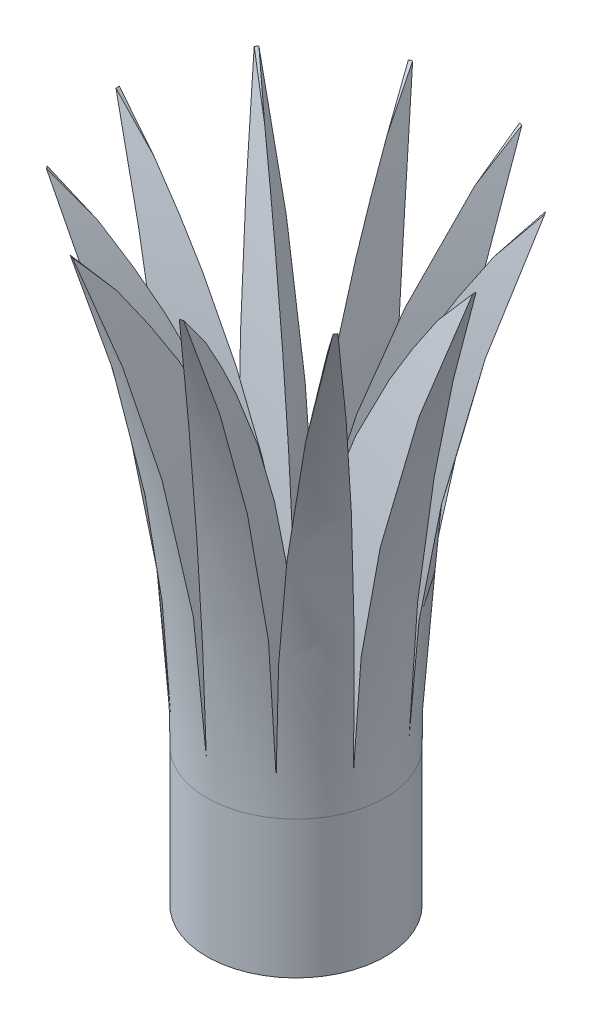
ISO-10303-21;
HEADER;
FILE_DESCRIPTION(('STEP AP214'),'2;1');
FILE_NAME('part.step','',(''),(''),'','','');
FILE_SCHEMA(('AUTOMOTIVE_DESIGN { 1 0 10303 214 1 1 1 1 }'));
ENDSEC;
DATA;
#1=APPLICATION_CONTEXT('core data for automotive mechanical design processes');
#2=APPLICATION_PROTOCOL_DEFINITION('international standard','automotive_design',2000,#1);
#3=PRODUCT_CONTEXT('',#1,'mechanical');
#4=PRODUCT('Part','Part','',(#3));
#5=PRODUCT_RELATED_PRODUCT_CATEGORY('part','',(#4));
#6=PRODUCT_DEFINITION_FORMATION('','',#4);
#7=PRODUCT_DEFINITION_CONTEXT('part definition',#1,'design');
#8=PRODUCT_DEFINITION('design','',#6,#7);
#9=PRODUCT_DEFINITION_SHAPE('','',#8);
#10=(LENGTH_UNIT() NAMED_UNIT(*) SI_UNIT(.MILLI.,.METRE.));
#11=(NAMED_UNIT(*) PLANE_ANGLE_UNIT() SI_UNIT($,.RADIAN.));
#12=(NAMED_UNIT(*) SI_UNIT($,.STERADIAN.) SOLID_ANGLE_UNIT());
#13=UNCERTAINTY_MEASURE_WITH_UNIT(LENGTH_MEASURE(1.E-05),#10,'distance_accuracy_value','');
#14=(GEOMETRIC_REPRESENTATION_CONTEXT(3) GLOBAL_UNCERTAINTY_ASSIGNED_CONTEXT((#13)) GLOBAL_UNIT_ASSIGNED_CONTEXT((#10,
#11,#12)) REPRESENTATION_CONTEXT('',''));
#15=CARTESIAN_POINT('',(0.,0.,0.));
#16=DIRECTION('',(0.,0.,1.));
#17=DIRECTION('',(1.,0.,0.));
#18=AXIS2_PLACEMENT_3D('',#15,#16,#17);
#19=CARTESIAN_POINT('',(0.,10.,0.));
#20=DIRECTION('',(0.,1.,0.));
#21=DIRECTION('',(-1.,0.,0.));
#22=AXIS2_PLACEMENT_3D('',#19,#20,#21);
#23=DEGENERATE_TOROIDAL_SURFACE('',#22,36.25,36.25,.T.);
#24=CARTESIAN_POINT('',(0.,35.,0.));
#25=DIRECTION('',(0.,1.,0.));
#26=DIRECTION('',(-1.,0.,0.));
#27=AXIS2_PLACEMENT_3D('',#24,#25,#26);
#28=CIRCLE('',#27,10.);
#29=CARTESIAN_POINT('',(-3.,35.,-9.53939201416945));
#30=VERTEX_POINT('',#29);
#31=CARTESIAN_POINT('',(-3.18006295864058,35.,-9.48088601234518));
#32=VERTEX_POINT('',#31);
#33=EDGE_CURVE('E441',#30,#32,#28,.T.);
#34=ORIENTED_EDGE('',*,*,#33,.T.);
#35=CARTESIAN_POINT('',(0.,10.,0.));
#36=CARTESIAN_POINT('',(-4.21626075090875E-08,10.0108373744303,-5.80686769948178E-08));
#37=CARTESIAN_POINT('',(-1.33555459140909E-06,10.0216747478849,-4.67473440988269E-06));
#38=CARTESIAN_POINT('',(-4.01966089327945E-06,10.032578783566,-1.40769819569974E-05));
#39=CARTESIAN_POINT('',(-4.03612336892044E-06,10.0326454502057,-1.41346456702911E-05));
#40=CARTESIAN_POINT('',(-4.11869591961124E-06,10.0329787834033,-1.4423859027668E-05));
#41=CARTESIAN_POINT('',(-4.18558651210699E-06,10.0332454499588,-1.46580930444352E-05));
#42=CARTESIAN_POINT('',(-4.52406632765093E-06,10.0345787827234,-1.58433925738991E-05));
#43=CARTESIAN_POINT('',(-4.80773610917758E-06,10.0356454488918,-1.68368464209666E-05));
#44=CARTESIAN_POINT('',(-6.29074189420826E-06,10.0409787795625,-2.203050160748E-05));
#45=CARTESIAN_POINT('',(-7.68404848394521E-06,10.0452454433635,-2.69098606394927E-05));
#46=CARTESIAN_POINT('',(-1.56847071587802E-05,10.0665787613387,-5.49282240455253E-05));
#47=CARTESIAN_POINT('',(-2.53944334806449E-05,10.0836454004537,-8.89319228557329E-05));
#48=CARTESIAN_POINT('',(-9.04902880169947E-05,10.1689786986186,-0.000316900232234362));
#49=CARTESIAN_POINT('',(-0.000195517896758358,10.2372448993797,-0.000684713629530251));
#50=CARTESIAN_POINT('',(-0.000985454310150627,10.5785848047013,-0.00345095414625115));
#51=CARTESIAN_POINT('',(-0.0024647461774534,10.8516361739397,-0.0086308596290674));
#52=CARTESIAN_POINT('',(-0.00945167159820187,11.671047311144,-0.0330868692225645));
#53=CARTESIAN_POINT('',(-0.017510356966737,12.2171512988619,-0.0612862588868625));
#54=CARTESIAN_POINT('',(-0.0404697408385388,13.3077218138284,-0.14140242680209));
#55=CARTESIAN_POINT('',(-0.0553742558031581,13.8521872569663,-0.193332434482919));
#56=CARTESIAN_POINT('',(-0.107883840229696,15.404940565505,-0.375598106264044));
#57=CARTESIAN_POINT('',(-0.153989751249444,16.4097105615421,-0.534961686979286));
#58=CARTESIAN_POINT('',(-0.270883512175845,18.402156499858,-0.933999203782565));
#59=CARTESIAN_POINT('',(-0.341684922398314,19.3898227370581,-1.17371725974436));
#60=CARTESIAN_POINT('',(-0.50928607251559,21.3430310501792,-1.73194776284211));
#61=CARTESIAN_POINT('',(-0.606148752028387,22.308513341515,-2.05065081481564));
#62=CARTESIAN_POINT('',(-0.827209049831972,24.2077916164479,-2.76357349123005));
#63=CARTESIAN_POINT('',(-0.95140264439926,25.1415922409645,-3.15778199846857));
#64=CARTESIAN_POINT('',(-1.22874283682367,26.9705641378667,-4.01787898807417));
#65=CARTESIAN_POINT('',(-1.38187679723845,27.8657520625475,-4.48373616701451));
#66=CARTESIAN_POINT('',(-1.71902631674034,29.6117016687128,-5.48303243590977));
#67=CARTESIAN_POINT('',(-1.90304300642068,30.4624617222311,-6.01647399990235));
#68=CARTESIAN_POINT('',(-2.20346346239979,31.6998706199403,-6.86295201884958));
#69=CARTESIAN_POINT('',(-2.30761060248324,32.105689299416,-7.15267219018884));
#70=CARTESIAN_POINT('',(-2.52432106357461,32.9039989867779,-7.7470043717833));
#71=CARTESIAN_POINT('',(-2.63688436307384,33.2964900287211,-8.05161634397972));
#72=CARTESIAN_POINT('',(-2.87066134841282,34.0674328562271,-8.67501200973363));
#73=CARTESIAN_POINT('',(-2.99187572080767,34.4458835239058,-8.9937968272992));
#74=CARTESIAN_POINT('',(-3.24316951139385,35.1880528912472,-9.64475212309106));
#75=CARTESIAN_POINT('',(-3.37324906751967,35.5517713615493,-9.97692280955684));
#76=CARTESIAN_POINT('',(-3.5078706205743,35.9077879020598,-10.3153996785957));
#77=B_SPLINE_CURVE_WITH_KNOTS('',3,(#35,#36,#37,#38,#39,#40,#41,#42,#43,#44,#45,#46,#47,#48,#49,
#50,#51,#52,#53,#54,#55,#56,#57,#58,#59,#60,#61,#62,#63,#64,#65,#66,#67,#68,#69,#70,#71,#72,#73,
#74,#75,#76),.UNSPECIFIED.,.F.,.F.,(4,2,2,2,2,2,2,2,2,2,2,2,2,2,2,2,2,2,2,2,4),(0.,
0.0325121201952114,0.0327121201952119,0.0335121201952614,0.0367121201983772,0.0495121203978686,
0.100712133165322,0.305512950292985,1.12476525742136,2.76480704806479,4.40576425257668,
7.45696671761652,10.509847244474,13.5701679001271,16.6300383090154,19.6885756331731,
22.7472249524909,24.2750027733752,25.802776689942,27.3306719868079,28.8585910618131),.UNSPECIFIED.);
#78=CARTESIAN_POINT('',(-2.45790338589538,32.6582352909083,-7.56464878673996));
#79=VERTEX_POINT('',#78);
#80=EDGE_CURVE('E403',#32,#79,#77,.F.);
#81=ORIENTED_EDGE('',*,*,#80,.T.);
#82=CARTESIAN_POINT('',(0.,10.,0.));
#83=CARTESIAN_POINT('',(1.4380179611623E-11,10.0108373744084,-7.17690622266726E-08));
#84=CARTESIAN_POINT('',(-1.66725258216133E-06,10.0216747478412,-4.56695918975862E-06));
#85=CARTESIAN_POINT('',(-5.02226837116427E-06,10.0325787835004,-1.37512149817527E-05));
#86=CARTESIAN_POINT('',(-5.04284383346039E-06,10.0326454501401,-1.38075423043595E-05));
#87=CARTESIAN_POINT('',(-5.14603659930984E-06,10.0329787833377,-1.40900557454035E-05));
#88=CARTESIAN_POINT('',(-5.229600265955E-06,10.0332454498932,-1.43188723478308E-05));
#89=CARTESIAN_POINT('',(-5.65246589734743E-06,10.0345787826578,-1.54767532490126E-05));
#90=CARTESIAN_POINT('',(-6.00690975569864E-06,10.0356454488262,-1.64472112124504E-05));
#91=CARTESIAN_POINT('',(-7.85988683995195E-06,10.0409787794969,-2.1520655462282E-05));
#92=CARTESIAN_POINT('',(-9.60069338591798E-06,10.0452454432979,-2.62871048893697E-05));
#93=CARTESIAN_POINT('',(-1.95968052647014E-05,10.0665787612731,-5.36571061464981E-05));
#94=CARTESIAN_POINT('',(-3.17283443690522E-05,10.0836454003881,-8.68739102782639E-05));
#95=CARTESIAN_POINT('',(-0.00011306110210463,10.168978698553,-0.000309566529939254));
#96=CARTESIAN_POINT('',(-0.000244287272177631,10.2372448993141,-0.000668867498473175));
#97=CARTESIAN_POINT('',(-0.00123117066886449,10.5785848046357,-0.00337111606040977));
#98=CARTESIAN_POINT('',(-0.00307907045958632,10.8516361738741,-0.00843125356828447));
#99=CARTESIAN_POINT('',(-0.0118014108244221,11.6710473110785,-0.0323233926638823));
#100=CARTESIAN_POINT('',(-0.0218569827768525,12.2171512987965,-0.0598739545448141));
#101=CARTESIAN_POINT('',(-0.0503735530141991,13.3077218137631,-0.13818448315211));
#102=CARTESIAN_POINT('',(-0.0688392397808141,13.8521872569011,-0.188957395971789));
#103=CARTESIAN_POINT('',(-0.133491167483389,15.4049405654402,-0.367277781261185));
#104=CARTESIAN_POINT('',(-0.189862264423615,16.4097105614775,-0.523306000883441));
#105=CARTESIAN_POINT('',(-0.329841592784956,18.4021564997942,-0.914842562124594));
#106=CARTESIAN_POINT('',(-0.413464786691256,19.3898227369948,-1.15039456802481));
#107=CARTESIAN_POINT('',(-0.605992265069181,21.3430310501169,-1.70052601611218));
#108=CARTESIAN_POINT('',(-0.71495766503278,22.3085133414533,-2.01529665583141));
#109=CARTESIAN_POINT('',(-0.955161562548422,24.2077916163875,-2.72199919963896));
#110=CARTESIAN_POINT('',(-1.08639678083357,25.141592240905,-3.11391974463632));
#111=CARTESIAN_POINT('',(-1.36757617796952,26.9705641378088,-3.97276930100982));
#112=CARTESIAN_POINT('',(-1.51751218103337,27.8657520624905,-4.4396655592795));
#113=CARTESIAN_POINT('',(-1.83212409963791,29.6117016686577,-5.44628473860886));
#114=CARTESIAN_POINT('',(-1.99680055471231,30.4624617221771,-5.98601032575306));
#115=CARTESIAN_POINT('',(-2.25130259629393,31.6998706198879,-6.84740814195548));
#116=CARTESIAN_POINT('',(-2.33733903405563,32.1056892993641,-7.14301283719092));
#117=CARTESIAN_POINT('',(-2.51135627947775,32.9039989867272,-7.75121688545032));
#118=CARTESIAN_POINT('',(-2.59933708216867,33.296490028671,-8.0638161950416));
#119=CARTESIAN_POINT('',(-2.77663030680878,34.0674328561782,-8.70556454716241));
#120=CARTESIAN_POINT('',(-2.8659428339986,34.4458835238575,-9.03471490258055));
#121=CARTESIAN_POINT('',(-3.04526380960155,35.1880528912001,-9.70905558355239));
#122=CARTESIAN_POINT('',(-3.13527226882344,35.5517713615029,-10.0542461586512));
#123=CARTESIAN_POINT('',(-3.2253128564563,35.907787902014,-10.4072082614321));
#124=B_SPLINE_CURVE_WITH_KNOTS('',3,(#82,#83,#84,#85,#86,#87,#88,#89,#90,#91,#92,#93,#94,#95,
#96,#97,#98,#99,#100,#101,#102,#103,#104,#105,#106,#107,#108,#109,#110,#111,#112,#113,#114,#115,
#116,#117,#118,#119,#120,#121,#122,#123),.UNSPECIFIED.,.F.,.F.,(4,2,2,2,2,2,2,2,2,2,2,2,2,2,2,2,
2,2,2,2,4),(0.,0.0325121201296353,0.0327121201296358,0.0335121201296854,0.0367121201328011,
0.0495121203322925,0.100712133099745,0.305512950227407,1.12476525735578,2.76480704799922,
4.4057642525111,7.45696671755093,10.5098472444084,13.5701679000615,16.6300383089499,
19.6885756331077,22.7472249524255,24.2750027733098,25.8027766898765,27.3306719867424,
28.8585910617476),.UNSPECIFIED.);
#125=EDGE_CURVE('E64',#79,#30,#124,.T.);
#126=ORIENTED_EDGE('',*,*,#125,.T.);
#127=EDGE_LOOP('',(#34,#81,#126));
#128=FACE_BOUND('',#127,.T.);
#129=ADVANCED_FACE('F40',(#128),#23,.T.);
#130=CARTESIAN_POINT('',(0.,10.,0.));
#131=CARTESIAN_POINT('',(-6.82130174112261E-08,10.0108373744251,-2.21965264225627E-08));
#132=CARTESIAN_POINT('',(-3.82822574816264E-06,10.0216747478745,-2.99692017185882E-06));
#133=CARTESIAN_POINT('',(-1.15262163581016E-05,10.0325787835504,-9.02582023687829E-06));
#134=CARTESIAN_POINT('',(-1.15734286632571E-05,10.0326454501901,-9.06279476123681E-06));
#135=CARTESIAN_POINT('',(-1.18102266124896E-05,10.0329787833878,-9.24823835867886E-06));
#136=CARTESIAN_POINT('',(-1.20020215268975E-05,10.0332454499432,-9.39842035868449E-06));
#137=CARTESIAN_POINT('',(-1.2972558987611E-05,10.0345787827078,-1.01583943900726E-05));
#138=CARTESIAN_POINT('',(-1.37859901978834E-05,10.0356454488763,-1.07953785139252E-05));
#139=CARTESIAN_POINT('',(-1.80385210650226E-05,10.040978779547,-1.41254448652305E-05));
#140=CARTESIAN_POINT('',(-2.20337450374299E-05,10.045245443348,-1.72539641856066E-05));
#141=CARTESIAN_POINT('',(-4.49751946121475E-05,10.0665787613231,-3.52186271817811E-05));
#142=CARTESIAN_POINT('',(-7.28174009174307E-05,10.0836454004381,-5.7020963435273E-05));
#143=CARTESIAN_POINT('',(-0.00025947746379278,10.168978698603,-0.000203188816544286));
#144=CARTESIAN_POINT('',(-0.000560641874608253,10.2372448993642,-0.000439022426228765));
#145=CARTESIAN_POINT('',(-0.00282566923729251,10.5785848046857,-0.00221264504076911));
#146=CARTESIAN_POINT('',(-0.00706711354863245,10.8516361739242,-0.00553377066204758));
#147=CARTESIAN_POINT('',(-0.0270945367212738,11.6710473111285,-0.0212122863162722));
#148=CARTESIAN_POINT('',(-0.0501893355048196,12.2171512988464,-0.0392892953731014));
#149=CARTESIAN_POINT('',(-0.115854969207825,13.307721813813,-0.0906094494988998));
#150=CARTESIAN_POINT('',(-0.158436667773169,13.8521872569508,-0.123861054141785));
#151=CARTESIAN_POINT('',(-0.308050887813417,15.4049405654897,-0.240452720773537));
#152=CARTESIAN_POINT('',(-0.439022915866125,16.4097105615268,-0.34228019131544));
#153=CARTESIAN_POINT('',(-0.768140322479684,18.4021564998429,-0.596399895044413));
#154=CARTESIAN_POINT('',(-0.966322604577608,19.3898227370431,-0.748719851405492));
#155=CARTESIAN_POINT('',(-1.43003444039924,21.3430310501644,-1.10182433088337));
#156=CARTESIAN_POINT('',(-1.69572694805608,22.3085133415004,-1.30272606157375));
#157=CARTESIAN_POINT('',(-2.29361392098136,24.2077916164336,-1.7495566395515));
#158=CARTESIAN_POINT('',(-2.62579859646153,25.1415922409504,-1.99547885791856));
#159=CARTESIAN_POINT('',(-3.35572385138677,26.9705641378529,-2.52829546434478));
#160=CARTESIAN_POINT('',(-3.75343580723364,27.865752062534,-2.81517195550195));
#161=CARTESIAN_POINT('',(-4.61356710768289,29.6117016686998,-3.42544810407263));
#162=CARTESIAN_POINT('',(-5.07598882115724,30.4624617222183,-3.74884909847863));
#163=CARTESIAN_POINT('',(-5.81658137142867,31.6998706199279,-4.25708148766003));
#164=CARTESIAN_POINT('',(-6.07113142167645,32.1056892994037,-4.43025387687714));
#165=CARTESIAN_POINT('',(-6.59579355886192,32.9039989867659,-4.78369949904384));
#166=CARTESIAN_POINT('',(-6.86590560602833,33.2964900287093,-4.96397271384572));
#167=CARTESIAN_POINT('',(-7.42145793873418,34.0674328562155,-5.33089973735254));
#168=CARTESIAN_POINT('',(-7.70689944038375,34.4458835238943,-5.51755405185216));
#169=CARTESIAN_POINT('',(-8.29282231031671,35.188052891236,-5.89648116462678));
#170=CARTESIAN_POINT('',(-8.59330391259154,35.5517713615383,-6.08875405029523));
#171=CARTESIAN_POINT('',(-8.90116674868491,35.907787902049,-6.28345902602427));
#172=B_SPLINE_CURVE_WITH_KNOTS('',3,(#130,#131,#132,#133,#134,#135,#136,#137,#138,#139,#140,
#141,#142,#143,#144,#145,#146,#147,#148,#149,#150,#151,#152,#153,#154,#155,#156,#157,#158,#159,
#160,#161,#162,#163,#164,#165,#166,#167,#168,#169,#170,#171),.UNSPECIFIED.,.F.,.F.,(4,2,2,2,2,2,
2,2,2,2,2,2,2,2,2,2,2,2,2,2,4),(0.,0.0325121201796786,0.0327121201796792,0.0335121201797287,
0.0367121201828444,0.0495121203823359,0.100712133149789,0.305512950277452,1.12476525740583,
2.76480704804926,4.40576425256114,7.45696671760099,10.5098472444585,13.5701679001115,
16.6300383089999,19.6885756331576,22.7472249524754,24.2750027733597,25.8027766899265,
27.3306719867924,28.8585910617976),.UNSPECIFIED.);
#173=CARTESIAN_POINT('',(-8.14544995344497,35.,-5.80100379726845));
#174=VERTEX_POINT('',#173);
#175=CARTESIAN_POINT('',(-6.4348746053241,32.6582352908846,-4.67521006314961));
#176=VERTEX_POINT('',#175);
#177=EDGE_CURVE('E388',#174,#176,#172,.F.);
#178=ORIENTED_EDGE('',*,*,#177,.T.);
#179=CARTESIAN_POINT('',(0.,10.,0.));
#180=CARTESIAN_POINT('',(-4.21976313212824E-08,10.0108373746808,-5.80432412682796E-08));
#181=CARTESIAN_POINT('',(-4.03322774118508E-06,10.0216747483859,-2.7147604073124E-06));
#182=CARTESIAN_POINT('',(-1.21458624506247E-05,10.0325787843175,-8.17295172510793E-06));
#183=CARTESIAN_POINT('',(-1.21956167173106E-05,10.0326454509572,-8.20642753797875E-06));
#184=CARTESIAN_POINT('',(-1.24451586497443E-05,10.0329787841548,-8.37433054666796E-06));
#185=CARTESIAN_POINT('',(-1.26472581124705E-05,10.0332454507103,-8.51032957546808E-06));
#186=CARTESIAN_POINT('',(-1.36699489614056E-05,10.0345787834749,-9.1985207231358E-06));
#187=CARTESIAN_POINT('',(-1.45271209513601E-05,10.0356454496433,-9.77530085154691E-06));
#188=CARTESIAN_POINT('',(-1.90083066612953E-05,10.040978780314,-1.27906509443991E-05));
#189=CARTESIAN_POINT('',(-2.32182975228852E-05,10.045245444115,-1.56235691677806E-05));
#190=CARTESIAN_POINT('',(-4.73930054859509E-05,10.0665787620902,-3.18907984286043E-05));
#191=CARTESIAN_POINT('',(-7.67319746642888E-05,10.0836454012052,-5.16330179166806E-05));
#192=CARTESIAN_POINT('',(-0.000273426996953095,10.1689786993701,-0.000183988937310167));
#193=CARTESIAN_POINT('',(-0.00059078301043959,10.2372449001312,-0.000397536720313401));
#194=CARTESIAN_POINT('',(-0.00297753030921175,10.5785848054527,-0.00200362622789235));
#195=CARTESIAN_POINT('',(-0.00744678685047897,10.851636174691,-0.00501119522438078));
#196=CARTESIAN_POINT('',(-0.0285467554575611,11.6710473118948,-0.0192134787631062));
#197=CARTESIAN_POINT('',(-0.052875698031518,12.2171512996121,-0.0355918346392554));
#198=CARTESIAN_POINT('',(-0.121975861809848,13.3077218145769,-0.0821847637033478));
#199=CARTESIAN_POINT('',(-0.166758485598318,13.8521872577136,-0.112407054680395));
#200=CARTESIAN_POINT('',(-0.323877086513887,15.4049405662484,-0.218669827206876));
#201=CARTESIAN_POINT('',(-0.461193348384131,16.409710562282,-0.31176520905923));
#202=CARTESIAN_POINT('',(-0.804578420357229,18.4021565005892,-0.546247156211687));
#203=CARTESIAN_POINT('',(-1.01068500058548,19.3898227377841,-0.687660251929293));
#204=CARTESIAN_POINT('',(-1.48980215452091,21.3430310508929,-1.01956113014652));
#205=CARTESIAN_POINT('',(-1.76297455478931,22.3085133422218,-1.21016767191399));
#206=CARTESIAN_POINT('',(-2.37269292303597,24.2077916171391,-1.64071373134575));
#207=CARTESIAN_POINT('',(-2.70922956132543,25.1415922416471,-1.88064598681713));
#208=CARTESIAN_POINT('',(-3.44152757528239,26.9705641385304,-2.4101967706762));
#209=CARTESIAN_POINT('',(-3.83726308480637,27.865752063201,-2.69979360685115));
#210=CARTESIAN_POINT('',(-4.68346538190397,29.6117016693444,-3.3292413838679));
#211=CARTESIAN_POINT('',(-5.1339341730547,30.462461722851,-3.66909416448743));
#212=CARTESIAN_POINT('',(-5.84614758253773,31.6998706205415,-4.2163870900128));
#213=CARTESIAN_POINT('',(-6.0895046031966,32.1056893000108,-4.40496536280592));
#214=CARTESIAN_POINT('',(-6.58778088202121,32.9039989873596,-4.79472800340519));
#215=CARTESIAN_POINT('',(-6.84270011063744,33.2964900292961,-4.99591233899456));
#216=CARTESIAN_POINT('',(-7.36334355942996,34.0674328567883,-5.41088731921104));
#217=CARTESIAN_POINT('',(-7.62906863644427,34.4458835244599,-5.62467896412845));
#218=CARTESIAN_POINT('',(-8.17050986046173,35.1880528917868,-6.06482981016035));
#219=CARTESIAN_POINT('',(-8.44622616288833,35.5517713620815,-6.29118920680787));
#220=CARTESIAN_POINT('',(-8.72653644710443,35.9077879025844,-6.52381701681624));
#221=B_SPLINE_CURVE_WITH_KNOTS('',3,(#179,#180,#181,#182,#183,#184,#185,#186,#187,#188,#189,
#190,#191,#192,#193,#194,#195,#196,#197,#198,#199,#200,#201,#202,#203,#204,#205,#206,#207,#208,
#209,#210,#211,#212,#213,#214,#215,#216,#217,#218,#219,#220),.UNSPECIFIED.,.F.,.F.,(4,2,2,2,2,2,
2,2,2,2,2,2,2,2,2,2,2,2,2,2,4),(0.,0.0325121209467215,0.0327121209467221,0.0335121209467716,
0.0367121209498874,0.0495121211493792,0.100712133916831,0.305512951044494,1.12476525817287,
2.7648070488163,4.40576425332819,7.45696671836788,10.5098472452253,13.5701679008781,
16.6300383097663,19.6885756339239,22.7472249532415,24.2750027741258,25.8027766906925,
27.3306719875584,28.8585910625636),.UNSPECIFIED.);
#222=CARTESIAN_POINT('',(-8.03416492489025,35.,-5.95417449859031));
#223=VERTEX_POINT('',#222);
#224=EDGE_CURVE('E396',#176,#223,#221,.T.);
#225=ORIENTED_EDGE('',*,*,#224,.T.);
#226=EDGE_CURVE('E468',#223,#174,#28,.T.);
#227=ORIENTED_EDGE('',*,*,#226,.T.);
#228=EDGE_LOOP('',(#178,#225,#227));
#229=FACE_BOUND('',#228,.T.);
#230=ADVANCED_FACE('F460',(#229),#23,.T.);
#231=CARTESIAN_POINT('',(-9.99955191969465,35.,0.0946646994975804));
#232=CARTESIAN_POINT('',(-9.82082461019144,34.8122460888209,0.0846649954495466));
#233=CARTESIAN_POINT('',(-9.64408975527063,34.6225656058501,0.0752318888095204));
#234=CARTESIAN_POINT('',(-9.29477469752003,34.2395315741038,0.0574439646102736));
#235=CARTESIAN_POINT('',(-9.12219257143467,34.046179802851,0.0490886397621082));
#236=CARTESIAN_POINT('',(-8.78118379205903,33.6558058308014,0.0333920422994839));
#237=CARTESIAN_POINT('',(-8.61275713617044,33.4587836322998,0.0260507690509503));
#238=CARTESIAN_POINT('',(-8.28006373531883,33.061066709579,0.0123201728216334));
#239=CARTESIAN_POINT('',(-8.11579899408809,32.860370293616,0.00593130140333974));
#240=CARTESIAN_POINT('',(-7.95369714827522,32.657928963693,-8.98896033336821E-06));
#241=B_SPLINE_CURVE_WITH_KNOTS('',3,(#231,#232,#233,#234,#235,#236,#237,#238,#239,#240),
.UNSPECIFIED.,.F.,.F.,(4,2,2,2,4),(0.,0.778222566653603,1.55607749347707,2.33393193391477,
3.11215401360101),.UNSPECIFIED.);
#242=CARTESIAN_POINT('',(-9.99955191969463,35.,0.0946646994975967));
#243=VERTEX_POINT('',#242);
#244=CARTESIAN_POINT('',(-7.95394243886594,32.6582352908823,0.));
#245=VERTEX_POINT('',#244);
#246=EDGE_CURVE('E370',#243,#245,#241,.T.);
#247=ORIENTED_EDGE('',*,*,#246,.T.);
#248=CARTESIAN_POINT('',(-7.95369714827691,32.6579289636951,8.98896033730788E-06));
#249=CARTESIAN_POINT('',(-8.11579899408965,32.8603702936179,-0.00593130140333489));
#250=CARTESIAN_POINT('',(-8.28006373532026,33.0610667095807,-0.012320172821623));
#251=CARTESIAN_POINT('',(-8.6127571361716,33.4587836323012,-0.026050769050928));
#252=CARTESIAN_POINT('',(-8.78118379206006,33.6558058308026,-0.0333920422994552));
#253=CARTESIAN_POINT('',(-9.12219257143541,34.0461798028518,-0.0490886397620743));
#254=CARTESIAN_POINT('',(-9.29477469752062,34.2395315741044,-0.0574439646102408));
#255=CARTESIAN_POINT('',(-9.64408975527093,34.6225656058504,-0.075231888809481));
#256=CARTESIAN_POINT('',(-9.82082461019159,34.8122460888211,-0.0846649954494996));
#257=CARTESIAN_POINT('',(-9.99955191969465,35.,-0.0946646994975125));
#258=B_SPLINE_CURVE_WITH_KNOTS('',3,(#248,#249,#250,#251,#252,#253,#254,#255,#256,#257),
.UNSPECIFIED.,.F.,.F.,(4,2,2,2,4),(0.,0.778222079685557,1.55607652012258,2.33393144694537,
3.11215401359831),.UNSPECIFIED.);
#259=CARTESIAN_POINT('',(-9.9995519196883,35.,-0.0946646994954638));
#260=VERTEX_POINT('',#259);
#261=EDGE_CURVE('E379',#245,#260,#258,.T.);
#262=ORIENTED_EDGE('',*,*,#261,.T.);
#263=EDGE_CURVE('E470',#260,#243,#28,.T.);
#264=ORIENTED_EDGE('',*,*,#263,.T.);
#265=EDGE_LOOP('',(#247,#262,#264));
#266=FACE_BOUND('',#265,.T.);
#267=ADVANCED_FACE('F464',(#266),#23,.T.);
#268=CARTESIAN_POINT('',(0.,10.,0.));
#269=CARTESIAN_POINT('',(-4.21859784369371E-08,10.0108373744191,5.80110308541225E-08));
#270=CARTESIAN_POINT('',(-4.03322723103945E-06,10.0216747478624,2.71475977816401E-06));
#271=CARTESIAN_POINT('',(-1.21458618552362E-05,10.0325787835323,8.17295135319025E-06));
#272=CARTESIAN_POINT('',(-1.2195616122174E-05,10.032645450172,8.20642716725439E-06));
#273=CARTESIAN_POINT('',(-1.24451580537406E-05,10.0329787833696,8.37433017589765E-06));
#274=CARTESIAN_POINT('',(-1.26472575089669E-05,10.0332454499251,8.51032918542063E-06));
#275=CARTESIAN_POINT('',(-1.36699483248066E-05,10.0345787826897,9.19852026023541E-06));
#276=CARTESIAN_POINT('',(-1.45271203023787E-05,10.0356454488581,9.77530040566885E-06));
#277=CARTESIAN_POINT('',(-1.90083059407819E-05,10.0409787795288,1.2790650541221E-05));
#278=CARTESIAN_POINT('',(-2.32182967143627E-05,10.0452454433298,1.56235686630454E-05));
#279=CARTESIAN_POINT('',(-4.73930042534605E-05,10.066578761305,3.18907974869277E-05));
#280=CARTESIAN_POINT('',(-7.67319731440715E-05,10.08364540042,5.1633016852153E-05));
#281=CARTESIAN_POINT('',(-0.000273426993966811,10.1689786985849,0.000183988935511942));
#282=CARTESIAN_POINT('',(-0.000590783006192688,10.237244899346,0.000397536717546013));
#283=CARTESIAN_POINT('',(-0.00297753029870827,10.5785848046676,0.0020036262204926));
#284=CARTESIAN_POINT('',(-0.00744678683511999,10.851636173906,0.00501119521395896));
#285=CARTESIAN_POINT('',(-0.0285467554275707,11.6710473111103,0.019213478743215));
#286=CARTESIAN_POINT('',(-0.0528756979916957,12.2171512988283,0.0355918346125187));
#287=CARTESIAN_POINT('',(-0.121975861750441,13.3077218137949,0.0821847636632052));
#288=CARTESIAN_POINT('',(-0.166758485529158,13.8521872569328,0.112407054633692));
#289=CARTESIAN_POINT('',(-0.323877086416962,15.4049405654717,0.218669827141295));
#290=CARTESIAN_POINT('',(-0.461193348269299,16.4097105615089,0.311765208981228));
#291=CARTESIAN_POINT('',(-0.804578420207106,18.4021564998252,0.546247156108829));
#292=CARTESIAN_POINT('',(-1.01068500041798,19.3898227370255,0.687660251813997));
#293=CARTESIAN_POINT('',(-1.48980215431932,21.3430310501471,1.0195611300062));
#294=CARTESIAN_POINT('',(-1.76297455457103,22.3085133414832,1.21016767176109));
#295=CARTESIAN_POINT('',(-2.37269292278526,24.2077916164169,1.64071373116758));
#296=CARTESIAN_POINT('',(-2.70922956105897,25.1415922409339,1.88064598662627));
#297=CARTESIAN_POINT('',(-3.44152757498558,26.9705641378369,2.41019677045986));
#298=CARTESIAN_POINT('',(-3.83726308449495,27.8657520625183,2.69979360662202));
#299=CARTESIAN_POINT('',(-4.68346538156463,29.6117016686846,3.3292413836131));
#300=CARTESIAN_POINT('',(-5.13393417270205,30.4624617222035,3.66909416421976));
#301=CARTESIAN_POINT('',(-5.8461475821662,31.6998706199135,4.21638708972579));
#302=CARTESIAN_POINT('',(-6.08950460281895,32.1056892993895,4.40496536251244));
#303=CARTESIAN_POINT('',(-6.58778088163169,32.903998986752,4.79472800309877));
#304=CARTESIAN_POINT('',(-6.84270011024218,33.2964900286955,4.99591233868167));
#305=CARTESIAN_POINT('',(-7.36334355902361,34.067432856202,5.41088731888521));
#306=CARTESIAN_POINT('',(-7.62906863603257,34.445883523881,5.62467896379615));
#307=CARTESIAN_POINT('',(-8.17050986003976,35.188052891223,6.06482980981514));
#308=CARTESIAN_POINT('',(-8.44622616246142,35.5517713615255,6.29118920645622));
#309=CARTESIAN_POINT('',(-8.72653644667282,35.9077879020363,6.52381701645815));
#310=B_SPLINE_CURVE_WITH_KNOTS('',3,(#268,#269,#270,#271,#272,#273,#274,#275,#276,#277,#278,
#279,#280,#281,#282,#283,#284,#285,#286,#287,#288,#289,#290,#291,#292,#293,#294,#295,#296,#297,
#298,#299,#300,#301,#302,#303,#304,#305,#306,#307,#308,#309),.UNSPECIFIED.,.F.,.F.,(4,2,2,2,2,2,
2,2,2,2,2,2,2,2,2,2,2,2,2,2,4),(0.,0.0325121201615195,0.0327121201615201,0.0335121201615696,
0.0367121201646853,0.0495121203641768,0.10071213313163,0.305512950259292,1.12476525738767,
2.76480704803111,4.40576425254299,7.45696671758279,10.5098472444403,13.5701679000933,
16.6300383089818,19.6885756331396,22.7472249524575,24.2750027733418,25.8027766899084,
27.3306719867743,28.8585910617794),.UNSPECIFIED.);
#311=CARTESIAN_POINT('',(-8.0341649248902,35.,5.95417449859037));
#312=VERTEX_POINT('',#311);
#313=CARTESIAN_POINT('',(-6.43487460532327,32.6582352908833,4.67521006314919));
#314=VERTEX_POINT('',#313);
#315=EDGE_CURVE('E352',#312,#314,#310,.F.);
#316=ORIENTED_EDGE('',*,*,#315,.T.);
#317=CARTESIAN_POINT('',(0.,10.,0.));
#318=CARTESIAN_POINT('',(-6.82595273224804E-08,10.0108373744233,2.21740459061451E-08));
#319=CARTESIAN_POINT('',(-3.8282269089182E-06,10.0216747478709,2.9969195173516E-06));
#320=CARTESIAN_POINT('',(-1.15262163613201E-05,10.032578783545,9.02582022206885E-06));
#321=CARTESIAN_POINT('',(-1.1573428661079E-05,10.0326454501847,9.06279474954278E-06));
#322=CARTESIAN_POINT('',(-1.18102265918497E-05,10.0329787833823,9.24823835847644E-06));
#323=CARTESIAN_POINT('',(-1.20020215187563E-05,10.0332454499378,9.39842035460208E-06));
#324=CARTESIAN_POINT('',(-1.29725590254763E-05,10.0345787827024,1.01583943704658E-05));
#325=CARTESIAN_POINT('',(-1.37859902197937E-05,10.0356454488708,1.07953784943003E-05));
#326=CARTESIAN_POINT('',(-1.80385210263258E-05,10.0409787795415,1.41254448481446E-05));
#327=CARTESIAN_POINT('',(-2.20337450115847E-05,10.0452454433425,1.72539641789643E-05));
#328=CARTESIAN_POINT('',(-4.49751946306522E-05,10.0665787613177,3.52186272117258E-05));
#329=CARTESIAN_POINT('',(-7.28174009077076E-05,10.0836454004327,5.70209634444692E-05));
#330=CARTESIAN_POINT('',(-0.000259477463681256,10.1689786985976,0.000203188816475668));
#331=CARTESIAN_POINT('',(-0.000560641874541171,10.2372448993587,0.000439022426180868));
#332=CARTESIAN_POINT('',(-0.00282566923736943,10.5785848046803,0.00221264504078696));
#333=CARTESIAN_POINT('',(-0.00706711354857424,10.8516361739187,0.00553377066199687));
#334=CARTESIAN_POINT('',(-0.0270945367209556,11.671047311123,0.0212122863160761));
#335=CARTESIAN_POINT('',(-0.0501893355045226,12.217151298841,0.0392892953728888));
#336=CARTESIAN_POINT('',(-0.115854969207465,13.3077218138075,0.0906094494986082));
#337=CARTESIAN_POINT('',(-0.158436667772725,13.8521872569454,0.123861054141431));
#338=CARTESIAN_POINT('',(-0.308050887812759,15.4049405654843,0.240452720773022));
#339=CARTESIAN_POINT('',(-0.43902291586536,16.4097105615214,0.34228019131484));
#340=CARTESIAN_POINT('',(-0.768140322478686,18.4021564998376,0.596399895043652));
#341=CARTESIAN_POINT('',(-0.966322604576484,19.3898227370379,0.748719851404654));
#342=CARTESIAN_POINT('',(-1.43003444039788,21.3430310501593,1.10182433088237));
#343=CARTESIAN_POINT('',(-1.69572694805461,22.3085133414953,1.30272606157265));
#344=CARTESIAN_POINT('',(-2.29361392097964,24.2077916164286,1.74955663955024));
#345=CARTESIAN_POINT('',(-2.62579859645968,25.1415922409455,1.99547885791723));
#346=CARTESIAN_POINT('',(-3.35572385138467,26.9705641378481,2.5282954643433));
#347=CARTESIAN_POINT('',(-3.75343580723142,27.8657520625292,2.81517195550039));
#348=CARTESIAN_POINT('',(-4.6135671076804,29.6117016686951,3.42544810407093));
#349=CARTESIAN_POINT('',(-5.07598882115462,30.4624617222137,3.74884909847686));
#350=CARTESIAN_POINT('',(-5.81658137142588,31.6998706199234,4.25708148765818));
#351=CARTESIAN_POINT('',(-6.07113142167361,32.1056892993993,4.43025387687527));
#352=CARTESIAN_POINT('',(-6.59579355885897,32.9039989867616,4.78369949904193));
#353=CARTESIAN_POINT('',(-6.86590560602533,33.296490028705,4.96397271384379));
#354=CARTESIAN_POINT('',(-7.42145793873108,34.0674328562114,5.33089973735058));
#355=CARTESIAN_POINT('',(-7.7068994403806,34.4458835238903,5.51755405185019));
#356=CARTESIAN_POINT('',(-8.29282231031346,35.1880528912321,5.89648116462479));
#357=CARTESIAN_POINT('',(-8.59330391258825,35.5517713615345,6.08875405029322));
#358=CARTESIAN_POINT('',(-8.90116674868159,35.9077879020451,6.28345902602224));
#359=B_SPLINE_CURVE_WITH_KNOTS('',3,(#317,#318,#319,#320,#321,#322,#323,#324,#325,#326,#327,
#328,#329,#330,#331,#332,#333,#334,#335,#336,#337,#338,#339,#340,#341,#342,#343,#344,#345,#346,
#347,#348,#349,#350,#351,#352,#353,#354,#355,#356,#357,#358),.UNSPECIFIED.,.F.,.F.,(4,2,2,2,2,2,
2,2,2,2,2,2,2,2,2,2,2,2,2,2,4),(0.,0.0325121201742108,0.0327121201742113,0.0335121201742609,
0.0367121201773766,0.049512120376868,0.100712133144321,0.305512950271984,1.12476525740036,
2.76480704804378,4.40576425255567,7.45696671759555,10.5098472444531,13.5701679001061,
16.6300383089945,19.6885756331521,22.7472249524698,24.2750027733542,25.8027766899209,
27.3306719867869,28.8585910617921),.UNSPECIFIED.);
#360=CARTESIAN_POINT('',(-8.14544995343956,35.,5.80100379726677));
#361=VERTEX_POINT('',#360);
#362=EDGE_CURVE('E361',#314,#361,#359,.T.);
#363=ORIENTED_EDGE('',*,*,#362,.T.);
#364=EDGE_CURVE('E712',#361,#312,#28,.T.);
#365=ORIENTED_EDGE('',*,*,#364,.T.);
#366=EDGE_LOOP('',(#316,#363,#365));
#367=FACE_BOUND('',#366,.T.);
#368=ADVANCED_FACE('F732',(#367),#23,.T.);
#369=CARTESIAN_POINT('',(0.,10.,0.));
#370=CARTESIAN_POINT('',(-2.16202317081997E-11,10.0108373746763,7.17561939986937E-08));
#371=CARTESIAN_POINT('',(-1.66725363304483E-06,10.0216747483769,4.56695906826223E-06));
#372=CARTESIAN_POINT('',(-5.02226861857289E-06,10.032578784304,1.3751215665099E-05));
#373=CARTESIAN_POINT('',(-5.04284407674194E-06,10.0326454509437,1.38075429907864E-05));
#374=CARTESIAN_POINT('',(-5.14603682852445E-06,10.0329787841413,1.40900564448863E-05));
#375=CARTESIAN_POINT('',(-5.22960050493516E-06,10.0332454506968,1.43188730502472E-05));
#376=CARTESIAN_POINT('',(-5.65246617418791E-06,10.0345787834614,1.54767539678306E-05));
#377=CARTESIAN_POINT('',(-6.00691002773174E-06,10.0356454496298,1.64472119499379E-05));
#378=CARTESIAN_POINT('',(-7.85988710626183E-06,10.0409787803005,2.15206563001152E-05));
#379=CARTESIAN_POINT('',(-9.60069370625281E-06,10.0452454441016,2.62871058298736E-05));
#380=CARTESIAN_POINT('',(-1.95968058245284E-05,10.0665787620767,5.36571075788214E-05));
#381=CARTESIAN_POINT('',(-3.17283450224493E-05,10.0836454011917,8.68739120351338E-05));
#382=CARTESIAN_POINT('',(-0.000113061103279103,10.1689786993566,0.000309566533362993));
#383=CARTESIAN_POINT('',(-0.000244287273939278,10.2372449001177,0.000668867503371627));
#384=CARTESIAN_POINT('',(-0.00123117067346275,10.5785848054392,0.0033711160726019));
#385=CARTESIAN_POINT('',(-0.00307907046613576,10.8516361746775,0.00843125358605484));
#386=CARTESIAN_POINT('',(-0.0118014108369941,11.6710473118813,0.0323233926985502));
#387=CARTESIAN_POINT('',(-0.0218569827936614,12.2171512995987,0.0598739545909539));
#388=CARTESIAN_POINT('',(-0.050373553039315,13.3077218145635,0.138184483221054));
#389=CARTESIAN_POINT('',(-0.0688392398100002,13.8521872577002,0.188957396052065));
#390=CARTESIAN_POINT('',(-0.133491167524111,15.4049405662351,0.367277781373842));
#391=CARTESIAN_POINT('',(-0.189862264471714,16.4097105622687,0.523306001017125));
#392=CARTESIAN_POINT('',(-0.329841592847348,18.4021565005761,0.914842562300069));
#393=CARTESIAN_POINT('',(-0.413464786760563,19.3898227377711,1.15039456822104));
#394=CARTESIAN_POINT('',(-0.605992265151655,21.3430310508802,1.70052601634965));
#395=CARTESIAN_POINT('',(-0.714957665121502,22.3085133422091,2.01529665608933));
#396=CARTESIAN_POINT('',(-0.955161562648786,24.2077916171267,2.72199919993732));
#397=CARTESIAN_POINT('',(-1.08639678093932,25.1415922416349,3.11391974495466));
#398=CARTESIAN_POINT('',(-1.36757617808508,26.9705641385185,3.97276930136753));
#399=CARTESIAN_POINT('',(-1.51751218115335,27.8657520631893,4.4396655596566));
#400=CARTESIAN_POINT('',(-1.83212409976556,29.6117016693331,5.44628473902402));
#401=CARTESIAN_POINT('',(-1.99680055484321,30.4624617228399,5.98601032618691));
#402=CARTESIAN_POINT('',(-2.25130259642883,31.6998706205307,6.84740814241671));
#403=CARTESIAN_POINT('',(-2.33733903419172,32.1056893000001,7.14301283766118));
#404=CARTESIAN_POINT('',(-2.51135627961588,32.9039989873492,7.75121688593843));
#405=CARTESIAN_POINT('',(-2.59933708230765,33.2964900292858,8.06381619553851));
#406=CARTESIAN_POINT('',(-2.77663030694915,34.0674328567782,8.7055645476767));
#407=CARTESIAN_POINT('',(-2.8659428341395,34.4458835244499,9.03471490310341));
#408=CARTESIAN_POINT('',(-3.0452638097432,35.1880528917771,9.70905558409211));
#409=CARTESIAN_POINT('',(-3.13527226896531,35.551771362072,10.0542461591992));
#410=CARTESIAN_POINT('',(-3.2253128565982,35.907787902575,10.4072082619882));
#411=B_SPLINE_CURVE_WITH_KNOTS('',3,(#369,#370,#371,#372,#373,#374,#375,#376,#377,#378,#379,
#380,#381,#382,#383,#384,#385,#386,#387,#388,#389,#390,#391,#392,#393,#394,#395,#396,#397,#398,
#399,#400,#401,#402,#403,#404,#405,#406,#407,#408,#409,#410),.UNSPECIFIED.,.F.,.F.,(4,2,2,2,2,2,
2,2,2,2,2,2,2,2,2,2,2,2,2,2,4),(0.,0.0325121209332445,0.032712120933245,0.0335121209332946,
0.0367121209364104,0.0495121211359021,0.100712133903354,0.305512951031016,1.12476525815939,
2.76480704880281,4.40576425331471,7.45696671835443,10.5098472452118,13.5701679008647,
16.6300383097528,19.6885756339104,22.747224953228,24.2750027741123,25.802776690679,
27.330671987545,28.8585910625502),.UNSPECIFIED.);
#412=CARTESIAN_POINT('',(-3.,35.,9.53939201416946));
#413=VERTEX_POINT('',#412);
#414=CARTESIAN_POINT('',(-2.45790338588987,32.6582352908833,7.5646487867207));
#415=VERTEX_POINT('',#414);
#416=EDGE_CURVE('E478',#413,#415,#411,.F.);
#417=ORIENTED_EDGE('',*,*,#416,.T.);
#418=CARTESIAN_POINT('',(0.,10.,0.));
#419=CARTESIAN_POINT('',(-4.21820033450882E-08,10.0108373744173,5.80345222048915E-08));
#420=CARTESIAN_POINT('',(-1.33555525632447E-06,10.0216747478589,4.67473364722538E-06));
#421=CARTESIAN_POINT('',(-4.01966090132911E-06,10.0325787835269,1.40769819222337E-05));
#422=CARTESIAN_POINT('',(-4.03612337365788E-06,10.0326454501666,1.41346456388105E-05));
#423=CARTESIAN_POINT('',(-4.11869591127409E-06,10.0329787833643,1.44238590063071E-05));
#424=CARTESIAN_POINT('',(-4.18558650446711E-06,10.0332454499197,1.4658093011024E-05));
#425=CARTESIAN_POINT('',(-4.52406632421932E-06,10.0345787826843,1.58433924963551E-05));
#426=CARTESIAN_POINT('',(-4.80773611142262E-06,10.0356454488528,1.68368463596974E-05));
#427=CARTESIAN_POINT('',(-6.29074191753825E-06,10.0409787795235,2.20305016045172E-05));
#428=CARTESIAN_POINT('',(-7.68404850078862E-06,10.0452454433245,2.69098606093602E-05));
#429=CARTESIAN_POINT('',(-1.56847071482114E-05,10.0665787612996,5.49282239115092E-05));
#430=CARTESIAN_POINT('',(-2.53944334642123E-05,10.0836454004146,8.89319227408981E-05));
#431=CARTESIAN_POINT('',(-9.04902879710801E-05,10.1689786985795,0.000316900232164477));
#432=CARTESIAN_POINT('',(-0.000195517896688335,10.2372448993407,0.000684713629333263));
#433=CARTESIAN_POINT('',(-0.00098545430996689,10.5785848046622,0.00345095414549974));
#434=CARTESIAN_POINT('',(-0.00246474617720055,10.8516361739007,0.00863085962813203));
#435=CARTESIAN_POINT('',(-0.0094516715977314,11.671047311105,0.0330868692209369));
#436=CARTESIAN_POINT('',(-0.0175103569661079,12.217151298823,0.0612862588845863));
#437=CARTESIAN_POINT('',(-0.0404697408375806,13.3077218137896,0.14140242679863));
#438=CARTESIAN_POINT('',(-0.0553742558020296,13.8521872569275,0.193332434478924));
#439=CARTESIAN_POINT('',(-0.107883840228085,15.4049405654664,0.37559810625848));
#440=CARTESIAN_POINT('',(-0.153989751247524,16.4097105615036,0.534961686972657));
#441=CARTESIAN_POINT('',(-0.270883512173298,18.40215649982,0.933999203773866));
#442=CARTESIAN_POINT('',(-0.341684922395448,19.3898227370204,1.17371725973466));
#443=CARTESIAN_POINT('',(-0.509286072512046,21.3430310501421,1.73194776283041));
#444=CARTESIAN_POINT('',(-0.606148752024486,22.3085133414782,2.05065081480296));
#445=CARTESIAN_POINT('',(-0.827209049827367,24.207791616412,2.76357349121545));
#446=CARTESIAN_POINT('',(-0.95140264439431,25.1415922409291,3.15778199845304));
#447=CARTESIAN_POINT('',(-1.22874283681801,26.9705641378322,4.01787898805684));
#448=CARTESIAN_POINT('',(-1.38187679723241,27.8657520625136,4.4837361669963));
#449=CARTESIAN_POINT('',(-1.7190263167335,29.6117016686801,5.48303243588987));
#450=CARTESIAN_POINT('',(-1.90304300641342,30.462461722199,6.01647399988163));
#451=CARTESIAN_POINT('',(-2.20346346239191,31.6998706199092,6.86295201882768));
#452=CARTESIAN_POINT('',(-2.30761060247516,32.1056892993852,7.15267219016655));
#453=CARTESIAN_POINT('',(-2.52432106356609,32.9039989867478,7.74700437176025));
#454=CARTESIAN_POINT('',(-2.63688436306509,33.2964900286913,8.05161634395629));
#455=CARTESIAN_POINT('',(-2.87066134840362,34.067432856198,8.67501200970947));
#456=CARTESIAN_POINT('',(-2.99187572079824,34.4458835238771,8.99379682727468));
#457=CARTESIAN_POINT('',(-3.24316951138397,35.1880528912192,9.64475212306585));
#458=CARTESIAN_POINT('',(-3.37324906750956,35.5517713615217,9.97692280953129));
#459=CARTESIAN_POINT('',(-3.50787062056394,35.9077879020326,10.3153996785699));
#460=B_SPLINE_CURVE_WITH_KNOTS('',3,(#418,#419,#420,#421,#422,#423,#424,#425,#426,#427,#428,
#429,#430,#431,#432,#433,#434,#435,#436,#437,#438,#439,#440,#441,#442,#443,#444,#445,#446,#447,
#448,#449,#450,#451,#452,#453,#454,#455,#456,#457,#458,#459),.UNSPECIFIED.,.F.,.F.,(4,2,2,2,2,2,
2,2,2,2,2,2,2,2,2,2,2,2,2,2,4),(0.,0.0325121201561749,0.0327121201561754,0.0335121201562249,
0.0367121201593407,0.0495121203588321,0.100712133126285,0.305512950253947,1.12476525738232,
2.76480704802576,4.40576425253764,7.45696671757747,10.509847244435,13.570167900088,
16.6300383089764,19.6885756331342,22.7472249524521,24.2750027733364,25.8027766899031,
27.3306719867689,28.8585910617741),.UNSPECIFIED.);
#461=CARTESIAN_POINT('',(-3.18006295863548,35.,9.48088601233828));
#462=VERTEX_POINT('',#461);
#463=EDGE_CURVE('E343',#415,#462,#460,.T.);
#464=ORIENTED_EDGE('',*,*,#463,.T.);
#465=EDGE_CURVE('E713',#462,#413,#28,.T.);
#466=ORIENTED_EDGE('',*,*,#465,.T.);
#467=EDGE_LOOP('',(#417,#464,#466));
#468=FACE_BOUND('',#467,.T.);
#469=ADVANCED_FACE('F734',(#468),#23,.T.);
#470=CARTESIAN_POINT('',(0.,10.,0.));
#471=CARTESIAN_POINT('',(4.21853258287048E-08,10.0108373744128,5.80386564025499E-08));
#472=CARTESIAN_POINT('',(1.33555529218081E-06,10.02167474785,4.67473366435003E-06));
#473=CARTESIAN_POINT('',(4.01966091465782E-06,10.0325787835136,1.40769819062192E-05));
#474=CARTESIAN_POINT('',(4.0361233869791E-06,10.0326454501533,1.41346456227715E-05));
#475=CARTESIAN_POINT('',(4.11869592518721E-06,10.032978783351,1.44238589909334E-05));
#476=CARTESIAN_POINT('',(4.18558652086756E-06,10.0332454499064,1.46580929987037E-05));
#477=CARTESIAN_POINT('',(4.52406634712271E-06,10.034578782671,1.58433924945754E-05));
#478=CARTESIAN_POINT('',(4.80773612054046E-06,10.0356454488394,1.68368463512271E-05));
#479=CARTESIAN_POINT('',(6.29074187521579E-06,10.0409787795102,2.20305015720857E-05));
#480=CARTESIAN_POINT('',(7.68404847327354E-06,10.0452454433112,2.69098605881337E-05));
#481=CARTESIAN_POINT('',(1.56847071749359E-05,10.0665787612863,5.49282239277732E-05));
#482=CARTESIAN_POINT('',(2.53944334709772E-05,10.0836454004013,8.89319227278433E-05));
#483=CARTESIAN_POINT('',(9.04902879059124E-05,10.1689786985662,0.00031690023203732));
#484=CARTESIAN_POINT('',(0.000195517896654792,10.2372448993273,0.000684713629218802));
#485=CARTESIAN_POINT('',(0.000985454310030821,10.5785848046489,0.00345095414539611));
#486=CARTESIAN_POINT('',(0.00246474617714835,10.8516361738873,0.00863085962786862));
#487=CARTESIAN_POINT('',(0.00945167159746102,11.6710473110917,0.0330868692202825));
#488=CARTESIAN_POINT('',(0.0175103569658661,12.2171512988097,0.0612862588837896));
#489=CARTESIAN_POINT('',(0.0404697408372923,13.3077218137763,0.141402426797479));
#490=CARTESIAN_POINT('',(0.055374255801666,13.8521872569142,0.193332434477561));
#491=CARTESIAN_POINT('',(0.107883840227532,15.4049405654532,0.375598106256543));
#492=CARTESIAN_POINT('',(0.15398975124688,16.4097105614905,0.534961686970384));
#493=CARTESIAN_POINT('',(0.270883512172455,18.4021564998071,0.933999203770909));
#494=CARTESIAN_POINT('',(0.341684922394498,19.3898227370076,1.17371725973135));
#495=CARTESIAN_POINT('',(0.509286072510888,21.3430310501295,1.73194776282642));
#496=CARTESIAN_POINT('',(0.606148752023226,22.3085133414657,2.05065081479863));
#497=CARTESIAN_POINT('',(0.827209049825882,24.2077916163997,2.76357349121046));
#498=CARTESIAN_POINT('',(0.951402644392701,25.141592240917,3.15778199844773));
#499=CARTESIAN_POINT('',(1.22874283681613,26.9705641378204,4.01787898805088));
#500=CARTESIAN_POINT('',(1.3818767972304,27.865752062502,4.48373616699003));
#501=CARTESIAN_POINT('',(1.71902631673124,29.6117016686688,5.48303243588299));
#502=CARTESIAN_POINT('',(1.90304300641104,30.462461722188,6.01647399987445));
#503=CARTESIAN_POINT('',(2.20346346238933,31.6998706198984,6.86295201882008));
#504=CARTESIAN_POINT('',(2.30761060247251,32.1056892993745,7.15267219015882));
#505=CARTESIAN_POINT('',(2.5243210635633,32.9039989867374,7.74700437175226));
#506=CARTESIAN_POINT('',(2.63688436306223,33.2964900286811,8.05161634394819));
#507=CARTESIAN_POINT('',(2.87066134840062,34.067432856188,8.67501200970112));
#508=CARTESIAN_POINT('',(2.99187572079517,34.4458835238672,8.99379682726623));
#509=CARTESIAN_POINT('',(3.24316951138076,35.1880528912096,9.64475212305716));
#510=CARTESIAN_POINT('',(3.37324906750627,35.5517713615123,9.97692280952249));
#511=CARTESIAN_POINT('',(3.50787062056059,35.9077879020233,10.315399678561));
#512=B_SPLINE_CURVE_WITH_KNOTS('',3,(#470,#471,#472,#473,#474,#475,#476,#477,#478,#479,#480,
#481,#482,#483,#484,#485,#486,#487,#488,#489,#490,#491,#492,#493,#494,#495,#496,#497,#498,#499,
#500,#501,#502,#503,#504,#505,#506,#507,#508,#509,#510,#511),.UNSPECIFIED.,.F.,.F.,(4,2,2,2,2,2,
2,2,2,2,2,2,2,2,2,2,2,2,2,2,4),(0.,0.0325121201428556,0.0327121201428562,0.0335121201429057,
0.0367121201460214,0.0495121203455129,0.100712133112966,0.305512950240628,1.124765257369,
2.76480704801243,4.40576425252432,7.45696671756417,10.5098472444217,13.5701679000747,
16.6300383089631,19.6885756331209,22.7472249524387,24.275002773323,25.8027766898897,
27.3306719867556,28.8585910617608),.UNSPECIFIED.);
#513=CARTESIAN_POINT('',(3.18006295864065,35.,9.48088601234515));
#514=VERTEX_POINT('',#513);
#515=CARTESIAN_POINT('',(2.45790338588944,32.6582352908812,7.56464878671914));
#516=VERTEX_POINT('',#515);
#517=EDGE_CURVE('E325',#514,#516,#512,.F.);
#518=ORIENTED_EDGE('',*,*,#517,.T.);
#519=CARTESIAN_POINT('',(0.,10.,0.));
#520=CARTESIAN_POINT('',(-1.43801839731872E-11,10.0108373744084,7.17742688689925E-08));
#521=CARTESIAN_POINT('',(1.66725258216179E-06,10.0216747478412,4.56695922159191E-06));
#522=CARTESIAN_POINT('',(5.02226837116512E-06,10.0325787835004,1.37512149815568E-05));
#523=CARTESIAN_POINT('',(5.04284383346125E-06,10.0326454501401,1.38075423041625E-05));
#524=CARTESIAN_POINT('',(5.1460365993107E-06,10.0329787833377,1.40900557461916E-05));
#525=CARTESIAN_POINT('',(5.22960026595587E-06,10.0332454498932,1.43188723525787E-05));
#526=CARTESIAN_POINT('',(5.65246589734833E-06,10.0345787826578,1.54767532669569E-05));
#527=CARTESIAN_POINT('',(6.00690975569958E-06,10.0356454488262,1.64472112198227E-05));
#528=CARTESIAN_POINT('',(7.85988683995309E-06,10.0409787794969,2.15206554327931E-05));
#529=CARTESIAN_POINT('',(9.60069338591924E-06,10.0452454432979,2.62871048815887E-05));
#530=CARTESIAN_POINT('',(1.95968052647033E-05,10.0665787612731,5.36571062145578E-05));
#531=CARTESIAN_POINT('',(3.17283443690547E-05,10.0836454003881,8.687391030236E-05));
#532=CARTESIAN_POINT('',(0.000113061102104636,10.168978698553,0.000309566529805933));
#533=CARTESIAN_POINT('',(0.000244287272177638,10.2372448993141,0.000668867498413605));
#534=CARTESIAN_POINT('',(0.00123117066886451,10.5785848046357,0.00337111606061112));
#535=CARTESIAN_POINT('',(0.00307907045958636,10.8516361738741,0.00843125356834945));
#536=CARTESIAN_POINT('',(0.0118014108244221,11.6710473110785,0.0323233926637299));
#537=CARTESIAN_POINT('',(0.0218569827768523,12.2171512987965,0.0598739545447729));
#538=CARTESIAN_POINT('',(0.050373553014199,13.3077218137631,0.138184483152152));
#539=CARTESIAN_POINT('',(0.0688392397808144,13.8521872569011,0.188957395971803));
#540=CARTESIAN_POINT('',(0.13349116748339,15.4049405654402,0.367277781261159));
#541=CARTESIAN_POINT('',(0.189862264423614,16.4097105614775,0.523306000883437));
#542=CARTESIAN_POINT('',(0.329841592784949,18.4021564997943,0.914842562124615));
#543=CARTESIAN_POINT('',(0.413464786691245,19.3898227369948,1.15039456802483));
#544=CARTESIAN_POINT('',(0.605992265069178,21.3430310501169,1.70052601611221));
#545=CARTESIAN_POINT('',(0.714957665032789,22.3085133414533,2.01529665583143));
#546=CARTESIAN_POINT('',(0.955161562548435,24.2077916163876,2.72199919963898));
#547=CARTESIAN_POINT('',(1.08639678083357,25.141592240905,3.11391974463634));
#548=CARTESIAN_POINT('',(1.36757617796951,26.9705641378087,3.97276930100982));
#549=CARTESIAN_POINT('',(1.51751218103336,27.8657520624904,4.43966555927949));
#550=CARTESIAN_POINT('',(1.83212409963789,29.6117016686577,5.44628473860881));
#551=CARTESIAN_POINT('',(1.99680055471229,30.462461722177,5.98601032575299));
#552=CARTESIAN_POINT('',(2.25130259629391,31.6998706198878,6.8474081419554));
#553=CARTESIAN_POINT('',(2.33733903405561,32.105689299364,7.14301283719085));
#554=CARTESIAN_POINT('',(2.51135627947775,32.9039989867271,7.75121688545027));
#555=CARTESIAN_POINT('',(2.59933708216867,33.2964900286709,8.06381619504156));
#556=CARTESIAN_POINT('',(2.77663030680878,34.0674328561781,8.70556454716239));
#557=CARTESIAN_POINT('',(2.86594283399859,34.4458835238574,9.03471490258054));
#558=CARTESIAN_POINT('',(3.04526380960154,35.1880528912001,9.7090555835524));
#559=CARTESIAN_POINT('',(3.13527226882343,35.5517713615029,10.0542461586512));
#560=CARTESIAN_POINT('',(3.22531285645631,35.9077879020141,10.4072082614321));
#561=B_SPLINE_CURVE_WITH_KNOTS('',3,(#519,#520,#521,#522,#523,#524,#525,#526,#527,#528,#529,
#530,#531,#532,#533,#534,#535,#536,#537,#538,#539,#540,#541,#542,#543,#544,#545,#546,#547,#548,
#549,#550,#551,#552,#553,#554,#555,#556,#557,#558,#559,#560),.UNSPECIFIED.,.F.,.F.,(4,2,2,2,2,2,
2,2,2,2,2,2,2,2,2,2,2,2,2,2,4),(0.,0.0325121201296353,0.0327121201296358,0.0335121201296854,
0.0367121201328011,0.0495121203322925,0.100712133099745,0.305512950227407,1.12476525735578,
2.7648070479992,4.4057642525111,7.45696671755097,10.5098472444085,13.5701679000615,
16.6300383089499,19.6885756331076,22.7472249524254,24.2750027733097,25.8027766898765,
27.3306719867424,28.8585910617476),.UNSPECIFIED.);
#562=CARTESIAN_POINT('',(3.,35.,9.53939201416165));
#563=VERTEX_POINT('',#562);
#564=EDGE_CURVE('E334',#516,#563,#561,.T.);
#565=ORIENTED_EDGE('',*,*,#564,.T.);
#566=EDGE_CURVE('E715',#563,#514,#28,.T.);
#567=ORIENTED_EDGE('',*,*,#566,.T.);
#568=EDGE_LOOP('',(#518,#565,#567));
#569=FACE_BOUND('',#568,.T.);
#570=ADVANCED_FACE('F739',(#569),#23,.T.);
#571=CARTESIAN_POINT('',(0.,10.,0.));
#572=CARTESIAN_POINT('',(6.82359146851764E-08,10.0108373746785,2.22042037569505E-08));
#573=CARTESIAN_POINT('',(3.8282264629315E-06,10.0216747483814,2.99692045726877E-06));
#574=CARTESIAN_POINT('',(1.15262169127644E-05,10.0325787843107,9.0258206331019E-06));
#575=CARTESIAN_POINT('',(1.15734292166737E-05,10.0326454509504,9.06279515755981E-06));
#576=CARTESIAN_POINT('',(1.18102271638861E-05,10.0329787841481,9.24823875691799E-06));
#577=CARTESIAN_POINT('',(1.20020220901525E-05,10.0332454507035,9.39842076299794E-06));
#578=CARTESIAN_POINT('',(1.29725596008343E-05,10.0345787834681,1.01583948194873E-05));
#579=CARTESIAN_POINT('',(1.37859908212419E-05,10.0356454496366,1.07953789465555E-05));
#580=CARTESIAN_POINT('',(1.80385217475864E-05,10.0409787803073,1.412544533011E-05));
#581=CARTESIAN_POINT('',(2.20337457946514E-05,10.0452454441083,1.7253964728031E-05));
#582=CARTESIAN_POINT('',(4.49751957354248E-05,10.0665787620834,3.52186280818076E-05));
#583=CARTESIAN_POINT('',(7.28174023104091E-05,10.0836454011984,5.70209645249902E-05));
#584=CARTESIAN_POINT('',(0.000259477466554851,10.1689786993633,0.000203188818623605));
#585=CARTESIAN_POINT('',(0.000560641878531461,10.2372449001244,0.00043902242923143));
#586=CARTESIAN_POINT('',(0.00282566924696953,10.5785848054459,0.00221264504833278));
#587=CARTESIAN_POINT('',(0.00706711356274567,10.8516361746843,0.00553377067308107));
#588=CARTESIAN_POINT('',(0.0270945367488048,11.671047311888,0.0212122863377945));
#589=CARTESIAN_POINT('',(0.0501893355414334,12.2171512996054,0.0392892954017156));
#590=CARTESIAN_POINT('',(0.11585496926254,13.3077218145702,0.0906094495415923));
#591=CARTESIAN_POINT('',(0.158436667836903,13.8521872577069,0.123861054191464));
#592=CARTESIAN_POINT('',(0.308050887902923,15.4049405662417,0.240452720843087));
#593=CARTESIAN_POINT('',(0.439022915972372,16.4097105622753,0.342280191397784));
#594=CARTESIAN_POINT('',(0.768140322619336,18.4021565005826,0.59639989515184));
#595=CARTESIAN_POINT('',(0.966322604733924,19.3898227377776,0.748719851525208));
#596=CARTESIAN_POINT('',(1.43003444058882,21.3430310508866,1.10182433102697));
#597=CARTESIAN_POINT('',(1.69572694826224,22.3085133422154,1.30272606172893));
#598=CARTESIAN_POINT('',(2.2936139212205,24.2077916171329,1.74955663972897));
#599=CARTESIAN_POINT('',(2.62579859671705,25.141592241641,1.99547885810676));
#600=CARTESIAN_POINT('',(3.35572385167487,26.9705641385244,2.5282954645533));
#601=CARTESIAN_POINT('',(3.75343580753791,27.8657520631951,2.81517195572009));
#602=CARTESIAN_POINT('',(4.61356710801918,29.6117016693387,3.4254481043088));
#603=CARTESIAN_POINT('',(5.07598882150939,30.4624617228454,3.74884909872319));
#604=CARTESIAN_POINT('',(5.81658137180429,31.699870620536,4.2570814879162));
#605=CARTESIAN_POINT('',(6.07113142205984,32.1056893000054,4.43025387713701));
#606=CARTESIAN_POINT('',(6.59579355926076,32.9039989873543,4.78369949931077));
#607=CARTESIAN_POINT('',(6.86590560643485,33.2964900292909,4.96397271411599));
#608=CARTESIAN_POINT('',(7.42145793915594,34.0674328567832,5.33089973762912));
#609=CARTESIAN_POINT('',(7.70689944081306,34.4458835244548,5.51755405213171));
#610=CARTESIAN_POINT('',(8.29282231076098,35.1880528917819,5.89648116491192));
#611=CARTESIAN_POINT('',(8.59330391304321,35.5517713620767,6.08875405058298));
#612=CARTESIAN_POINT('',(8.90116674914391,35.9077879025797,6.28345902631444));
#613=B_SPLINE_CURVE_WITH_KNOTS('',3,(#571,#572,#573,#574,#575,#576,#577,#578,#579,#580,#581,
#582,#583,#584,#585,#586,#587,#588,#589,#590,#591,#592,#593,#594,#595,#596,#597,#598,#599,#600,
#601,#602,#603,#604,#605,#606,#607,#608,#609,#610,#611,#612),.UNSPECIFIED.,.F.,.F.,(4,2,2,2,2,2,
2,2,2,2,2,2,2,2,2,2,2,2,2,2,4),(0.,0.03251212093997,0.0327121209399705,0.0335121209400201,
0.0367121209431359,0.0495121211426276,0.100712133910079,0.305512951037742,1.12476525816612,
2.76480704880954,4.40576425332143,7.45696671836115,10.5098472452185,13.5701679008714,
16.6300383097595,19.6885756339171,22.7472249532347,24.275002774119,25.8027766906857,
27.3306719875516,28.8585910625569),.UNSPECIFIED.);
#614=CARTESIAN_POINT('',(8.14544995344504,35.,5.80100379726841));
#615=VERTEX_POINT('',#614);
#616=CARTESIAN_POINT('',(6.43487460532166,32.6582352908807,4.67521006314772));
#617=VERTEX_POINT('',#616);
#618=EDGE_CURVE('E307',#615,#617,#613,.F.);
#619=ORIENTED_EDGE('',*,*,#618,.T.);
#620=CARTESIAN_POINT('',(0.,10.,0.));
#621=CARTESIAN_POINT('',(4.21620569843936E-08,10.0108373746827,5.80555707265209E-08));
#622=CARTESIAN_POINT('',(4.03322683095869E-06,10.0216747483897,2.71476084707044E-06));
#623=CARTESIAN_POINT('',(1.21458624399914E-05,10.0325787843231,8.17295175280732E-06));
#624=CARTESIAN_POINT('',(1.21956167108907E-05,10.0326454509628,8.20642756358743E-06));
#625=CARTESIAN_POINT('',(1.24451586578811E-05,10.0329787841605,8.37433056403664E-06));
#626=CARTESIAN_POINT('',(1.26472581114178E-05,10.0332454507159,8.51032959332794E-06));
#627=CARTESIAN_POINT('',(1.36699489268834E-05,10.0345787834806,9.19852074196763E-06));
#628=CARTESIAN_POINT('',(1.45271209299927E-05,10.035645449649,9.77530086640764E-06));
#629=CARTESIAN_POINT('',(1.90083066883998E-05,10.0409787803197,1.27906509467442E-05));
#630=CARTESIAN_POINT('',(2.32182975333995E-05,10.0452454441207,1.56235691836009E-05));
#631=CARTESIAN_POINT('',(4.73930054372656E-05,10.0665787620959,3.18907984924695E-05));
#632=CARTESIAN_POINT('',(7.67319746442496E-05,10.0836454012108,5.1633017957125E-05));
#633=CARTESIAN_POINT('',(0.000273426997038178,10.1689786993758,0.00018398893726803));
#634=CARTESIAN_POINT('',(0.000590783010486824,10.2372449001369,0.000397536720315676));
#635=CARTESIAN_POINT('',(0.00297753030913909,10.5785848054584,0.0020036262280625));
#636=CARTESIAN_POINT('',(0.00744678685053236,10.8516361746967,0.00501119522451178));
#637=CARTESIAN_POINT('',(0.0285467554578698,11.6710473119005,0.0192134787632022));
#638=CARTESIAN_POINT('',(0.0528756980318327,12.2171512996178,0.0355918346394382));
#639=CARTESIAN_POINT('',(0.121975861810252,13.3077218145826,0.0821847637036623));
#640=CARTESIAN_POINT('',(0.166758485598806,13.8521872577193,0.112407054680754));
#641=CARTESIAN_POINT('',(0.323877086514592,15.404940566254,0.218669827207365));
#642=CARTESIAN_POINT('',(0.461193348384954,16.4097105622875,0.311765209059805));
#643=CARTESIAN_POINT('',(0.804578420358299,18.4021565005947,0.546247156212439));
#644=CARTESIAN_POINT('',(1.01068500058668,19.3898227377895,0.687660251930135));
#645=CARTESIAN_POINT('',(1.48980215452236,21.3430310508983,1.01956113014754));
#646=CARTESIAN_POINT('',(1.76297455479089,22.3085133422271,1.2101676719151));
#647=CARTESIAN_POINT('',(2.37269292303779,24.2077916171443,1.64071373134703));
#648=CARTESIAN_POINT('',(2.70922956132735,25.1415922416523,1.88064598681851));
#649=CARTESIAN_POINT('',(3.44152757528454,26.9705641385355,2.41019677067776));
#650=CARTESIAN_POINT('',(3.83726308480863,27.865752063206,2.6997936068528));
#651=CARTESIAN_POINT('',(4.68346538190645,29.6117016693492,3.32924138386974));
#652=CARTESIAN_POINT('',(5.13393417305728,30.4624617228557,3.66909416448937));
#653=CARTESIAN_POINT('',(5.84614758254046,31.6998706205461,4.21638709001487));
#654=CARTESIAN_POINT('',(6.08950460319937,32.1056893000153,4.40496536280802));
#655=CARTESIAN_POINT('',(6.58778088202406,32.903998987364,4.79472800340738));
#656=CARTESIAN_POINT('',(6.84270011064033,33.2964900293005,4.9959123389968));
#657=CARTESIAN_POINT('',(7.36334355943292,34.0674328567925,5.41088731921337));
#658=CARTESIAN_POINT('',(7.62906863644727,34.4458835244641,5.62467896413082));
#659=CARTESIAN_POINT('',(8.17050986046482,35.1880528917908,6.0648298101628));
#660=CARTESIAN_POINT('',(8.44622616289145,35.5517713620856,6.29118920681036));
#661=CARTESIAN_POINT('',(8.72653644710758,35.9077879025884,6.52381701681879));
#662=B_SPLINE_CURVE_WITH_KNOTS('',3,(#620,#621,#622,#623,#624,#625,#626,#627,#628,#629,#630,
#631,#632,#633,#634,#635,#636,#637,#638,#639,#640,#641,#642,#643,#644,#645,#646,#647,#648,#649,
#650,#651,#652,#653,#654,#655,#656,#657,#658,#659,#660,#661),.UNSPECIFIED.,.F.,.F.,(4,2,2,2,2,2,
2,2,2,2,2,2,2,2,2,2,2,2,2,2,4),(0.,0.0325121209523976,0.0327121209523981,0.0335121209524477,
0.0367121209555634,0.0495121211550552,0.100712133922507,0.30551295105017,1.12476525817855,
2.76480704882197,4.40576425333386,7.45696671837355,10.5098472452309,13.5701679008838,
16.630038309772,19.6885756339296,22.7472249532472,24.2750027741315,25.8027766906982,
27.3306719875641,28.8585910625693),.UNSPECIFIED.);
#663=CARTESIAN_POINT('',(8.03416492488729,35.,5.95417449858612));
#664=VERTEX_POINT('',#663);
#665=EDGE_CURVE('E316',#617,#664,#662,.T.);
#666=ORIENTED_EDGE('',*,*,#665,.T.);
#667=EDGE_CURVE('E717',#664,#615,#28,.T.);
#668=ORIENTED_EDGE('',*,*,#667,.T.);
#669=EDGE_LOOP('',(#619,#666,#668));
#670=FACE_BOUND('',#669,.T.);
#671=ADVANCED_FACE('F889',(#670),#23,.T.);
#672=CARTESIAN_POINT('',(9.99955191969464,35.,-0.0946646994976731));
#673=CARTESIAN_POINT('',(9.82082461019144,34.8122460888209,-0.0846649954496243));
#674=CARTESIAN_POINT('',(9.64408975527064,34.6225656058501,-0.0752318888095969));
#675=CARTESIAN_POINT('',(9.29477469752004,34.2395315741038,-0.0574439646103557));
#676=CARTESIAN_POINT('',(9.12219257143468,34.046179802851,-0.0490886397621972));
#677=CARTESIAN_POINT('',(8.78118379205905,33.6558058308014,-0.0333920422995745));
#678=CARTESIAN_POINT('',(8.61275713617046,33.4587836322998,-0.0260507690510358));
#679=CARTESIAN_POINT('',(8.28006373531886,33.061066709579,-0.0123201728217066));
#680=CARTESIAN_POINT('',(8.11579899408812,32.860370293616,-0.0059313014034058));
#681=CARTESIAN_POINT('',(7.95369714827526,32.6579289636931,8.98896027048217E-06));
#682=B_SPLINE_CURVE_WITH_KNOTS('',3,(#672,#673,#674,#675,#676,#677,#678,#679,#680,#681),
.UNSPECIFIED.,.F.,.F.,(4,2,2,2,4),(0.,0.778222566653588,1.55607749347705,2.33393193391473,
3.11215401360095),.UNSPECIFIED.);
#683=CARTESIAN_POINT('',(9.99955191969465,35.,-0.0946646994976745));
#684=VERTEX_POINT('',#683);
#685=CARTESIAN_POINT('',(7.95394243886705,32.6582352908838,-1.15933059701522E-13));
#686=VERTEX_POINT('',#685);
#687=EDGE_CURVE('E290',#684,#686,#682,.T.);
#688=ORIENTED_EDGE('',*,*,#687,.T.);
#689=CARTESIAN_POINT('',(7.95369714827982,32.6579289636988,-8.98896026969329E-06));
#690=CARTESIAN_POINT('',(8.11579899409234,32.8603702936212,0.00593130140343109));
#691=CARTESIAN_POINT('',(8.28006373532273,33.0610667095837,0.0123201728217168));
#692=CARTESIAN_POINT('',(8.61275713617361,33.4587836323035,0.0260507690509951));
#693=CARTESIAN_POINT('',(8.78118379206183,33.6558058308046,0.033392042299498));
#694=CARTESIAN_POINT('',(9.1221925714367,34.0461798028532,0.0490886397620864));
#695=CARTESIAN_POINT('',(9.29477469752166,34.2395315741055,0.0574439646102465));
#696=CARTESIAN_POINT('',(9.64408975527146,34.622565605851,0.0752318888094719));
#697=CARTESIAN_POINT('',(9.82082461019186,34.8122460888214,0.0846649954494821));
#698=CARTESIAN_POINT('',(9.99955191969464,35.,0.0946646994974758));
#699=B_SPLINE_CURVE_WITH_KNOTS('',3,(#689,#690,#691,#692,#693,#694,#695,#696,#697,#698),
.UNSPECIFIED.,.F.,.F.,(4,2,2,2,4),(0.,0.778222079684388,1.55607652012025,2.33393144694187,
3.11215401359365),.UNSPECIFIED.);
#700=CARTESIAN_POINT('',(9.99955191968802,35.,0.0946646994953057));
#701=VERTEX_POINT('',#700);
#702=EDGE_CURVE('E298',#686,#701,#699,.T.);
#703=ORIENTED_EDGE('',*,*,#702,.T.);
#704=EDGE_CURVE('E475',#701,#684,#28,.T.);
#705=ORIENTED_EDGE('',*,*,#704,.T.);
#706=EDGE_LOOP('',(#688,#703,#705));
#707=FACE_BOUND('',#706,.T.);
#708=ADVANCED_FACE('F718',(#707),#23,.T.);
#709=CARTESIAN_POINT('',(0.,10.,0.));
#710=CARTESIAN_POINT('',(4.22088828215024E-08,10.0108373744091,-5.8058771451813E-08));
#711=CARTESIAN_POINT('',(4.03322782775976E-06,10.0216747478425,-2.71476071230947E-06));
#712=CARTESIAN_POINT('',(1.21458618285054E-05,10.0325787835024,-8.17295133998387E-06));
#713=CARTESIAN_POINT('',(1.21956160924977E-05,10.0326454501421,-8.20642715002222E-06));
#714=CARTESIAN_POINT('',(1.24451580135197E-05,10.0329787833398,-8.37433014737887E-06));
#715=CARTESIAN_POINT('',(1.26472574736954E-05,10.0332454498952,-8.51032917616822E-06));
#716=CARTESIAN_POINT('',(1.36699483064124E-05,10.0345787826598,-9.19852031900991E-06));
#717=CARTESIAN_POINT('',(1.45271202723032E-05,10.0356454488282,-9.77530042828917E-06));
#718=CARTESIAN_POINT('',(1.9008305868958E-05,10.040978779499,-1.27906504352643E-05));
#719=CARTESIAN_POINT('',(2.32182966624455E-05,10.0452454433,-1.56235686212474E-05));
#720=CARTESIAN_POINT('',(4.73930042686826E-05,10.0665787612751,-3.18907976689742E-05));
#721=CARTESIAN_POINT('',(7.67319731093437E-05,10.0836454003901,-5.16330169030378E-05));
#722=CARTESIAN_POINT('',(0.000273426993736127,10.168978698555,-0.000183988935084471));
#723=CARTESIAN_POINT('',(0.000590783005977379,10.2372448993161,-0.000397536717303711));
#724=CARTESIAN_POINT('',(0.00297753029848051,10.5785848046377,-0.00200362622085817));
#725=CARTESIAN_POINT('',(0.00744678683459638,10.8516361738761,-0.00501119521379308));
#726=CARTESIAN_POINT('',(0.0285467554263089,11.6710473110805,-0.0192134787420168));
#727=CARTESIAN_POINT('',(0.0528756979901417,12.2171512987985,-0.0355918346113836));
#728=CARTESIAN_POINT('',(0.121975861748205,13.3077218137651,-0.082184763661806));
#729=CARTESIAN_POINT('',(0.166758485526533,13.8521872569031,-0.112407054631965));
#730=CARTESIAN_POINT('',(0.323877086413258,15.4049405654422,-0.218669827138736));
#731=CARTESIAN_POINT('',(0.461193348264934,16.4097105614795,-0.311765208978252));
#732=CARTESIAN_POINT('',(0.804578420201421,18.4021564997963,-0.546247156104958));
#733=CARTESIAN_POINT('',(1.01068500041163,19.3898227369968,-0.687660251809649));
#734=CARTESIAN_POINT('',(1.48980215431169,21.3430310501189,-1.0195611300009));
#735=CARTESIAN_POINT('',(1.76297455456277,22.3085133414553,-1.21016767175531));
#736=CARTESIAN_POINT('',(2.37269292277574,24.2077916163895,-1.64071373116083));
#737=CARTESIAN_POINT('',(2.70922956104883,25.1415922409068,-1.88064598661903));
#738=CARTESIAN_POINT('',(3.44152757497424,26.9705641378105,-2.41019677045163));
#739=CARTESIAN_POINT('',(3.83726308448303,27.8657520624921,-2.69979360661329));
#740=CARTESIAN_POINT('',(4.68346538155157,29.6117016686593,-3.32924138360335));
#741=CARTESIAN_POINT('',(5.13393417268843,30.4624617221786,-3.6690941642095));
#742=CARTESIAN_POINT('',(5.84614758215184,31.6998706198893,-4.21638708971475));
#743=CARTESIAN_POINT('',(6.08950460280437,32.1056892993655,-4.40496536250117));
#744=CARTESIAN_POINT('',(6.58778088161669,32.9039989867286,-4.79472800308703));
#745=CARTESIAN_POINT('',(6.84270011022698,33.2964900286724,-4.9959123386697));
#746=CARTESIAN_POINT('',(7.36334355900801,34.0674328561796,-5.4108873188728));
#747=CARTESIAN_POINT('',(7.62906863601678,34.4458835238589,-5.62467896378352));
#748=CARTESIAN_POINT('',(8.17050986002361,35.1880528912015,-6.06482980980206));
#749=CARTESIAN_POINT('',(8.4462261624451,35.5517713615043,-6.29118920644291));
#750=CARTESIAN_POINT('',(8.72653644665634,35.9077879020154,-6.52381701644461));
#751=B_SPLINE_CURVE_WITH_KNOTS('',3,(#709,#710,#711,#712,#713,#714,#715,#716,#717,#718,#719,
#720,#721,#722,#723,#724,#725,#726,#727,#728,#729,#730,#731,#732,#733,#734,#735,#736,#737,#738,
#739,#740,#741,#742,#743,#744,#745,#746,#747,#748,#749,#750),.UNSPECIFIED.,.F.,.F.,(4,2,2,2,2,2,
2,2,2,2,2,2,2,2,2,2,2,2,2,2,4),(0.,0.0325121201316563,0.0327121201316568,0.0335121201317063,
0.0367121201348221,0.0495121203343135,0.100712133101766,0.305512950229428,1.1247652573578,
2.76480704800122,4.40576425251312,7.45696671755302,10.5098472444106,13.5701679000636,
16.6300383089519,19.6885756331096,22.7472249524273,24.2750027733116,25.8027766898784,
27.3306719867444,28.8585910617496),.UNSPECIFIED.);
#752=CARTESIAN_POINT('',(8.03416492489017,35.,-5.95417449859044));
#753=VERTEX_POINT('',#752);
#754=CARTESIAN_POINT('',(6.43487460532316,32.6582352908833,-4.67521006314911));
#755=VERTEX_POINT('',#754);
#756=EDGE_CURVE('E190',#753,#755,#751,.F.);
#757=ORIENTED_EDGE('',*,*,#756,.T.);
#758=CARTESIAN_POINT('',(0.,10.,0.));
#759=CARTESIAN_POINT('',(6.82474310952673E-08,10.0108373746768,-2.21600907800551E-08));
#760=CARTESIAN_POINT('',(3.82822663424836E-06,10.0216747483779,-2.99691944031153E-06));
#761=CARTESIAN_POINT('',(1.15262168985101E-05,10.0325787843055,-9.0258206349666E-06));
#762=CARTESIAN_POINT('',(1.15734292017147E-05,10.0326454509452,-9.06279516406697E-06));
#763=CARTESIAN_POINT('',(1.18102271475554E-05,10.0329787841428,-9.2482387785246E-06));
#764=CARTESIAN_POINT('',(1.20020220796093E-05,10.0332454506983,-9.39842077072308E-06));
#765=CARTESIAN_POINT('',(1.29725596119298E-05,10.0345787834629,-1.01583947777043E-05));
#766=CARTESIAN_POINT('',(1.37859908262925E-05,10.0356454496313,-1.07953789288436E-05));
#767=CARTESIAN_POINT('',(1.80385217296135E-05,10.040978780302,-1.41254454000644E-05));
#768=CARTESIAN_POINT('',(2.20337457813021E-05,10.045245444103,-1.72539647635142E-05));
#769=CARTESIAN_POINT('',(4.49751957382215E-05,10.0665787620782,-3.52186279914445E-05));
#770=CARTESIAN_POINT('',(7.28174023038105E-05,10.0836454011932,-5.70209644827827E-05));
#771=CARTESIAN_POINT('',(0.000259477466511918,10.1689786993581,-0.000203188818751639));
#772=CARTESIAN_POINT('',(0.000560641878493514,10.2372449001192,-0.000439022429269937));
#773=CARTESIAN_POINT('',(0.00282566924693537,10.5785848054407,-0.00221264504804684));
#774=CARTESIAN_POINT('',(0.00706711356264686,10.851636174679,-0.00553377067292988));
#775=CARTESIAN_POINT('',(0.0270945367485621,11.6710473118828,-0.021212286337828));
#776=CARTESIAN_POINT('',(0.0501893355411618,12.2171512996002,-0.0392892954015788));
#777=CARTESIAN_POINT('',(0.115854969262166,13.307721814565,-0.0906094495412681));
#778=CARTESIAN_POINT('',(0.158436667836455,13.8521872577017,-0.123861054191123));
#779=CARTESIAN_POINT('',(0.308050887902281,15.4049405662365,-0.240452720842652));
#780=CARTESIAN_POINT('',(0.439022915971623,16.4097105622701,-0.342280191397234));
#781=CARTESIAN_POINT('',(0.768140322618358,18.4021565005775,-0.596399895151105));
#782=CARTESIAN_POINT('',(0.966322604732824,19.3898227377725,-0.748719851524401));
#783=CARTESIAN_POINT('',(1.43003444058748,21.3430310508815,-1.10182433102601));
#784=CARTESIAN_POINT('',(1.69572694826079,22.3085133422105,-1.30272606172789));
#785=CARTESIAN_POINT('',(2.29361392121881,24.2077916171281,-1.7495566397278));
#786=CARTESIAN_POINT('',(2.62579859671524,25.1415922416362,-1.99547885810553));
#787=CARTESIAN_POINT('',(3.35572385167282,26.9705641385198,-2.52829546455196));
#788=CARTESIAN_POINT('',(3.75343580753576,27.8657520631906,-2.81517195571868));
#789=CARTESIAN_POINT('',(4.61356710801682,29.6117016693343,-3.42544810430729));
#790=CARTESIAN_POINT('',(5.07598882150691,30.4624617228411,-3.74884909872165));
#791=CARTESIAN_POINT('',(5.81658137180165,31.6998706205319,-4.25708148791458));
#792=CARTESIAN_POINT('',(6.07113142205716,32.1056893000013,-4.43025387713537));
#793=CARTESIAN_POINT('',(6.59579355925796,32.9039989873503,-4.78369949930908));
#794=CARTESIAN_POINT('',(6.86590560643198,33.2964900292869,-4.96397271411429));
#795=CARTESIAN_POINT('',(7.42145793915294,34.0674328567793,-5.3308997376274));
#796=CARTESIAN_POINT('',(7.70689944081,34.445883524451,-5.51755405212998));
#797=CARTESIAN_POINT('',(8.2928223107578,35.1880528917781,-5.89648116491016));
#798=CARTESIAN_POINT('',(8.59330391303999,35.551771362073,-6.08875405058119));
#799=CARTESIAN_POINT('',(8.90116674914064,35.9077879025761,-6.28345902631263));
#800=B_SPLINE_CURVE_WITH_KNOTS('',3,(#758,#759,#760,#761,#762,#763,#764,#765,#766,#767,#768,
#769,#770,#771,#772,#773,#774,#775,#776,#777,#778,#779,#780,#781,#782,#783,#784,#785,#786,#787,
#788,#789,#790,#791,#792,#793,#794,#795,#796,#797,#798,#799),.UNSPECIFIED.,.F.,.F.,(4,2,2,2,2,2,
2,2,2,2,2,2,2,2,2,2,2,2,2,2,4),(0.,0.0325121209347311,0.0327121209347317,0.0335121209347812,
0.036712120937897,0.0495121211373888,0.100712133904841,0.305512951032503,1.12476525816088,
2.76480704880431,4.4057642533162,7.45696671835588,10.5098472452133,13.5701679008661,
16.6300383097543,19.6885756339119,22.7472249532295,24.2750027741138,25.8027766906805,
27.3306719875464,28.8585910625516),.UNSPECIFIED.);
#801=CARTESIAN_POINT('',(8.14544995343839,35.,-5.80100379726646));
#802=VERTEX_POINT('',#801);
#803=EDGE_CURVE('E282',#755,#802,#800,.T.);
#804=ORIENTED_EDGE('',*,*,#803,.T.);
#805=EDGE_CURVE('E471',#802,#753,#28,.T.);
#806=ORIENTED_EDGE('',*,*,#805,.T.);
#807=EDGE_LOOP('',(#757,#804,#806));
#808=FACE_BOUND('',#807,.T.);
#809=ADVANCED_FACE('F257',(#808),#23,.T.);
#810=CARTESIAN_POINT('',(0.,10.,0.));
#811=CARTESIAN_POINT('',(2.1620231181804E-11,10.0108373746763,-7.17559221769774E-08));
#812=CARTESIAN_POINT('',(1.66725363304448E-06,10.0216747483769,-4.56695905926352E-06));
#813=CARTESIAN_POINT('',(5.0222686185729E-06,10.032578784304,-1.37512156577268E-05));
#814=CARTESIAN_POINT('',(5.04284407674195E-06,10.0326454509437,-1.38075429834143E-05));
#815=CARTESIAN_POINT('',(5.14603682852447E-06,10.0329787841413,-1.40900564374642E-05));
#816=CARTESIAN_POINT('',(5.22960050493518E-06,10.0332454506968,-1.43188730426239E-05));
#817=CARTESIAN_POINT('',(5.65246617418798E-06,10.0345787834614,-1.54767539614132E-05));
#818=CARTESIAN_POINT('',(6.00691002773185E-06,10.0356454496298,-1.64472119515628E-05));
#819=CARTESIAN_POINT('',(7.85988710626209E-06,10.0409787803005,-2.15206563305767E-05));
#820=CARTESIAN_POINT('',(9.60069370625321E-06,10.0452454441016,-2.62871058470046E-05));
#821=CARTESIAN_POINT('',(1.95968058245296E-05,10.0665787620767,-5.36571075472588E-05));
#822=CARTESIAN_POINT('',(3.1728345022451E-05,10.0836454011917,-8.68739120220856E-05));
#823=CARTESIAN_POINT('',(0.000113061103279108,10.1689786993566,-0.000309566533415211));
#824=CARTESIAN_POINT('',(0.000244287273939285,10.2372449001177,-0.000668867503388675));
#825=CARTESIAN_POINT('',(0.00123117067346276,10.5785848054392,-0.00337111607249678));
#826=CARTESIAN_POINT('',(0.00307907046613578,10.8516361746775,-0.00843125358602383));
#827=CARTESIAN_POINT('',(0.0118014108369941,11.6710473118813,-0.0323233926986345));
#828=CARTESIAN_POINT('',(0.0218569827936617,12.2171512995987,-0.059873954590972));
#829=CARTESIAN_POINT('',(0.0503735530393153,13.3077218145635,-0.138184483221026));
#830=CARTESIAN_POINT('',(0.0688392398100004,13.8521872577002,-0.188957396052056));
#831=CARTESIAN_POINT('',(0.133491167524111,15.4049405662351,-0.367277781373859));
#832=CARTESIAN_POINT('',(0.189862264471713,16.4097105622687,-0.523306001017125));
#833=CARTESIAN_POINT('',(0.329841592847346,18.4021565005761,-0.914842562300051));
#834=CARTESIAN_POINT('',(0.413464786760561,19.389822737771,-1.15039456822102));
#835=CARTESIAN_POINT('',(0.605992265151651,21.3430310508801,-1.70052601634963));
#836=CARTESIAN_POINT('',(0.714957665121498,22.3085133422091,-2.01529665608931));
#837=CARTESIAN_POINT('',(0.955161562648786,24.2077916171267,-2.72199919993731));
#838=CARTESIAN_POINT('',(1.08639678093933,25.1415922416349,-3.11391974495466));
#839=CARTESIAN_POINT('',(1.36757617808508,26.9705641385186,-3.97276930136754));
#840=CARTESIAN_POINT('',(1.51751218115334,27.8657520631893,-4.43966555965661));
#841=CARTESIAN_POINT('',(1.83212409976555,29.6117016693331,-5.44628473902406));
#842=CARTESIAN_POINT('',(1.99680055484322,30.4624617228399,-5.98601032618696));
#843=CARTESIAN_POINT('',(2.25130259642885,31.6998706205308,-6.84740814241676));
#844=CARTESIAN_POINT('',(2.33733903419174,32.1056893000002,-7.14301283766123));
#845=CARTESIAN_POINT('',(2.5113562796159,32.9039989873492,-7.75121688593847));
#846=CARTESIAN_POINT('',(2.59933708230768,33.2964900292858,-8.06381619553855));
#847=CARTESIAN_POINT('',(2.77663030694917,34.0674328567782,-8.70556454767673));
#848=CARTESIAN_POINT('',(2.86594283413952,34.4458835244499,-9.03471490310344));
#849=CARTESIAN_POINT('',(3.0452638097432,35.1880528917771,-9.70905558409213));
#850=CARTESIAN_POINT('',(3.1352722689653,35.551771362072,-10.0542461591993));
#851=CARTESIAN_POINT('',(3.2253128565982,35.907787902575,-10.4072082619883));
#852=B_SPLINE_CURVE_WITH_KNOTS('',3,(#810,#811,#812,#813,#814,#815,#816,#817,#818,#819,#820,
#821,#822,#823,#824,#825,#826,#827,#828,#829,#830,#831,#832,#833,#834,#835,#836,#837,#838,#839,
#840,#841,#842,#843,#844,#845,#846,#847,#848,#849,#850,#851),.UNSPECIFIED.,.F.,.F.,(4,2,2,2,2,2,
2,2,2,2,2,2,2,2,2,2,2,2,2,2,4),(0.,0.0325121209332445,0.032712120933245,0.0335121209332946,
0.0367121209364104,0.0495121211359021,0.100712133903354,0.305512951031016,1.12476525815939,
2.76480704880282,4.40576425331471,7.45696671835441,10.5098472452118,13.5701679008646,
16.6300383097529,19.6885756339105,22.7472249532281,24.2750027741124,25.8027766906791,
27.330671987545,28.8585910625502),.UNSPECIFIED.);
#853=CARTESIAN_POINT('',(3.,35.,-9.53939201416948));
#854=VERTEX_POINT('',#853);
#855=CARTESIAN_POINT('',(2.45790338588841,32.6582352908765,-7.56464878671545));
#856=VERTEX_POINT('',#855);
#857=EDGE_CURVE('E272',#854,#856,#852,.F.);
#858=ORIENTED_EDGE('',*,*,#857,.T.);
#859=CARTESIAN_POINT('',(0.,10.,0.));
#860=CARTESIAN_POINT('',(4.21677821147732E-08,10.0108373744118,-5.80149147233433E-08));
#861=CARTESIAN_POINT('',(1.33555495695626E-06,10.0216747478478,-4.67473319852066E-06));
#862=CARTESIAN_POINT('',(4.01966092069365E-06,10.0325787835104,-1.40769819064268E-05));
#863=CARTESIAN_POINT('',(4.03612339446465E-06,10.0326454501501,-1.41346456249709E-05));
#864=CARTESIAN_POINT('',(4.11869593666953E-06,10.0329787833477,-1.44238589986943E-05));
#865=CARTESIAN_POINT('',(4.18558652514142E-06,10.0332454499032,-1.4658092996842E-05));
#866=CARTESIAN_POINT('',(4.52406632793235E-06,10.0345787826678,-1.58433924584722E-05));
#867=CARTESIAN_POINT('',(4.80773612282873E-06,10.0356454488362,-1.68368463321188E-05));
#868=CARTESIAN_POINT('',(6.29074195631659E-06,10.0409787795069,-2.20305016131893E-05));
#869=CARTESIAN_POINT('',(7.68404852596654E-06,10.0452454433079,-2.69098605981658E-05));
#870=CARTESIAN_POINT('',(1.56847071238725E-05,10.0665787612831,-5.49282238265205E-05));
#871=CARTESIAN_POINT('',(2.53944334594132E-05,10.0836454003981,-8.89319226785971E-05));
#872=CARTESIAN_POINT('',(9.0490288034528E-05,10.168978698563,-0.000316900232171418));
#873=CARTESIAN_POINT('',(0.000195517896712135,10.2372448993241,-0.000684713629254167));
#874=CARTESIAN_POINT('',(0.000985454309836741,10.5785848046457,-0.0034509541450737));
#875=CARTESIAN_POINT('',(0.00246474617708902,10.8516361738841,-0.00863085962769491));
#876=CARTESIAN_POINT('',(0.00945167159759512,11.6710473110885,-0.0330868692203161));
#877=CARTESIAN_POINT('',(0.0175103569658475,12.2171512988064,-0.0612862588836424));
#878=CARTESIAN_POINT('',(0.0404697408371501,13.3077218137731,-0.141402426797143));
#879=CARTESIAN_POINT('',(0.0553742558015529,13.852187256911,-0.193332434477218));
#880=CARTESIAN_POINT('',(0.107883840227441,15.40494056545,-0.375598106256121));
#881=CARTESIAN_POINT('',(0.153989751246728,16.4097105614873,-0.534961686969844));
#882=CARTESIAN_POINT('',(0.270883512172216,18.4021564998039,-0.933999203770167));
#883=CARTESIAN_POINT('',(0.341684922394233,19.3898227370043,-1.17371725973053));
#884=CARTESIAN_POINT('',(0.509286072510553,21.3430310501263,-1.73194776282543));
#885=CARTESIAN_POINT('',(0.606148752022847,22.3085133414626,-2.05065081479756));
#886=CARTESIAN_POINT('',(0.827209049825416,24.2077916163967,-2.76357349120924));
#887=CARTESIAN_POINT('',(0.951402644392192,25.141592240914,-3.15778199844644));
#888=CARTESIAN_POINT('',(1.22874283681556,26.9705641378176,-4.01787898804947));
#889=CARTESIAN_POINT('',(1.38187679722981,27.8657520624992,-4.48373616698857));
#890=CARTESIAN_POINT('',(1.71902631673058,29.6117016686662,-5.48303243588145));
#891=CARTESIAN_POINT('',(1.90304300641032,30.4624617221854,-6.01647399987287));
#892=CARTESIAN_POINT('',(2.20346346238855,31.699870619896,-6.86295201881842));
#893=CARTESIAN_POINT('',(2.30761060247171,32.1056892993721,-7.15267219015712));
#894=CARTESIAN_POINT('',(2.52432106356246,32.903998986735,-7.74700437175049));
#895=CARTESIAN_POINT('',(2.63688436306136,33.2964900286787,-8.05161634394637));
#896=CARTESIAN_POINT('',(2.87066134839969,34.0674328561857,-8.67501200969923));
#897=CARTESIAN_POINT('',(2.9918757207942,34.4458835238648,-8.99379682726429));
#898=CARTESIAN_POINT('',(3.24316951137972,35.1880528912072,-9.64475212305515));
#899=CARTESIAN_POINT('',(3.3732490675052,35.55177136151,-9.97692280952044));
#900=CARTESIAN_POINT('',(3.50787062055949,35.907787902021,-10.3153996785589));
#901=B_SPLINE_CURVE_WITH_KNOTS('',3,(#859,#860,#861,#862,#863,#864,#865,#866,#867,#868,#869,
#870,#871,#872,#873,#874,#875,#876,#877,#878,#879,#880,#881,#882,#883,#884,#885,#886,#887,#888,
#889,#890,#891,#892,#893,#894,#895,#896,#897,#898,#899,#900),.UNSPECIFIED.,.F.,.F.,(4,2,2,2,2,2,
2,2,2,2,2,2,2,2,2,2,2,2,2,2,4),(0.,0.0325121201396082,0.0327121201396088,0.0335121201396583,
0.036712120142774,0.0495121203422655,0.100712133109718,0.30551295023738,1.12476525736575,
2.76480704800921,4.40576425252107,7.45696671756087,10.5098472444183,13.5701679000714,
16.6300383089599,19.6885756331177,22.7472249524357,24.2750027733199,25.8027766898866,
27.3306719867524,28.8585910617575),.UNSPECIFIED.);
#902=CARTESIAN_POINT('',(3.1800629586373,35.,-9.48088601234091));
#903=VERTEX_POINT('',#902);
#904=EDGE_CURVE('E211',#856,#903,#901,.T.);
#905=ORIENTED_EDGE('',*,*,#904,.T.);
#906=EDGE_CURVE('E210',#903,#854,#28,.T.);
#907=ORIENTED_EDGE('',*,*,#906,.T.);
#908=EDGE_LOOP('',(#858,#905,#907));
#909=FACE_BOUND('',#908,.T.);
#910=ADVANCED_FACE('F254',(#909),#23,.T.);
#911=CARTESIAN_POINT('',(0.,8.,0.));
#912=DIRECTION('',(0.,1.,0.));
#913=DIRECTION('',(-1.,0.,0.));
#914=AXIS2_PLACEMENT_3D('',#911,#912,#913);
#915=TOROIDAL_SURFACE('',#914,80.4,75.4);
#916=CARTESIAN_POINT('',(-8.03424258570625,35.0002,-5.95419853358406));
#917=CARTESIAN_POINT('',(-7.81112625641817,34.4256012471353,-5.88515455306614));
#918=CARTESIAN_POINT('',(-7.59455660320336,33.8482864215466,-5.81754581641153));
#919=CARTESIAN_POINT('',(-7.17475796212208,32.6884897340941,-5.68517636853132));
#920=CARTESIAN_POINT('',(-6.97152925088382,32.1060077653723,-5.62041571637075));
#921=CARTESIAN_POINT('',(-6.57860112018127,30.935963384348,-5.49370092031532));
#922=CARTESIAN_POINT('',(-6.38890640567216,30.3483992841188,-5.43174775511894));
#923=CARTESIAN_POINT('',(-6.02341409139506,29.1686873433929,-5.31072599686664));
#924=CARTESIAN_POINT('',(-5.84761639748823,28.5765395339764,-5.25165738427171));
#925=CARTESIAN_POINT('',(-5.34476739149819,26.8050527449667,-5.0800237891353));
#926=CARTESIAN_POINT('',(-5.03844491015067,25.6193249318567,-4.97180093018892));
#927=CARTESIAN_POINT('',(-4.48438331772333,23.2332914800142,-4.76864571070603));
#928=CARTESIAN_POINT('',(-4.23663511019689,22.0329881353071,-4.67371128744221));
#929=CARTESIAN_POINT('',(-3.86012997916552,19.9375587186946,-4.52269743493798));
#930=CARTESIAN_POINT('',(-3.71721578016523,19.0452217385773,-4.46296657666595));
#931=CARTESIAN_POINT('',(-3.46652224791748,17.2550308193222,-4.35352689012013));
#932=CARTESIAN_POINT('',(-3.35873965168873,16.3571774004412,-4.30381713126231));
#933=CARTESIAN_POINT('',(-3.22413554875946,15.0041312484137,-4.23759806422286));
#934=CARTESIAN_POINT('',(-3.18368497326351,14.5504614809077,-4.21685779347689));
#935=CARTESIAN_POINT('',(-3.11218411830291,13.6422476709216,-4.17839022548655));
#936=CARTESIAN_POINT('',(-3.08113379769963,13.1877036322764,-4.16066291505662));
#937=CARTESIAN_POINT('',(-3.02854968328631,12.2778443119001,-4.12833436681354));
#938=CARTESIAN_POINT('',(-3.00701820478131,11.8225288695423,-4.11373388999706));
#939=CARTESIAN_POINT('',(-2.97355217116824,10.9114466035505,-4.08772722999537));
#940=CARTESIAN_POINT('',(-2.96161778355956,10.4556797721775,-4.07632110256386));
#941=CARTESIAN_POINT('',(-2.95451700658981,9.99980000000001,-4.06654379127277));
#942=B_SPLINE_CURVE_WITH_KNOTS('',3,(#916,#917,#918,#919,#920,#921,#922,#923,#924,#925,#926,
#927,#928,#929,#930,#931,#932,#933,#934,#935,#936,#937,#938,#939,#940,#941),.UNSPECIFIED.,.F.,
.F.,(4,2,2,2,2,2,2,2,2,2,2,2,4),(0.,1.86071295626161,3.72146448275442,5.58285975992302,
7.44424242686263,11.130947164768,14.8170789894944,17.5334538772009,20.249576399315,
21.6173127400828,22.9850430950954,24.3531059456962,25.7211926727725),.UNSPECIFIED.);
#943=CARTESIAN_POINT('',(-2.9545201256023,10.,-4.06654808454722));
#944=VERTEX_POINT('',#943);
#945=EDGE_CURVE('E642',#223,#944,#942,.T.);
#946=ORIENTED_EDGE('',*,*,#945,.T.);
#947=CARTESIAN_POINT('',(-2.95451700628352,9.99980000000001,-4.06654379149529));
#948=CARTESIAN_POINT('',(-2.96092344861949,10.4107527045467,-4.0753593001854));
#949=CARTESIAN_POINT('',(-2.96737201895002,10.8216045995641,-4.08831343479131));
#950=CARTESIAN_POINT('',(-2.98033059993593,11.6429605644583,-4.12244690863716));
#951=CARTESIAN_POINT('',(-2.9868406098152,12.0534646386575,-4.1436261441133));
#952=CARTESIAN_POINT('',(-3.00642554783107,13.2840457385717,-4.21941125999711));
#953=CARTESIAN_POINT('',(-3.01955861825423,14.1033977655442,-4.28626902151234));
#954=CARTESIAN_POINT('',(-3.04545332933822,15.733628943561,-4.45121806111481));
#955=CARTESIAN_POINT('',(-3.05821680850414,16.5445287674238,-4.5491068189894));
#956=CARTESIAN_POINT('',(-3.08286980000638,18.1621829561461,-4.77502194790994));
#957=CARTESIAN_POINT('',(-3.0947592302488,18.9689369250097,-4.90305114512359));
#958=CARTESIAN_POINT('',(-3.12386237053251,21.0699301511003,-5.27513725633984));
#959=CARTESIAN_POINT('',(-3.13987784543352,22.3601515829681,-5.54223477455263));
#960=CARTESIAN_POINT('',(-3.16592261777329,24.924523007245,-6.1460927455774));
#961=CARTESIAN_POINT('',(-3.17595037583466,26.1986687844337,-6.48287108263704));
#962=CARTESIAN_POINT('',(-3.18579313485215,28.1020787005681,-7.03905356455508));
#963=CARTESIAN_POINT('',(-3.18820631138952,28.7385492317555,-7.23410455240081));
#964=CARTESIAN_POINT('',(-3.19124388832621,30.0062867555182,-7.64052201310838));
#965=CARTESIAN_POINT('',(-3.19186827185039,30.637553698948,-7.85188863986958));
#966=CARTESIAN_POINT('',(-3.19136427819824,31.8941980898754,-8.29045426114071));
#967=CARTESIAN_POINT('',(-3.1902367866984,32.5195783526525,-8.51764520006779));
#968=CARTESIAN_POINT('',(-3.18634664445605,33.7644138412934,-8.98765625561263));
#969=CARTESIAN_POINT('',(-3.18358403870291,34.3838692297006,-9.23047594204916));
#970=CARTESIAN_POINT('',(-3.18006181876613,35.0002,-9.48096729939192));
#971=B_SPLINE_CURVE_WITH_KNOTS('',3,(#947,#948,#949,#950,#951,#952,#953,#954,#955,#956,#957,
#958,#959,#960,#961,#962,#963,#964,#965,#966,#967,#968,#969,#970),.UNSPECIFIED.,.F.,.F.,(4,2,2,
2,2,2,2,2,2,2,2,4),(0.,1.23324847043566,2.46648138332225,4.9323290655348,7.38240398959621,
9.83270874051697,13.7835499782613,17.7354064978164,19.732296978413,21.7292062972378,
23.7251063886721,25.7209515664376),.UNSPECIFIED.);
#972=EDGE_CURVE('E410',#944,#32,#971,.T.);
#973=ORIENTED_EDGE('',*,*,#972,.T.);
#974=ORIENTED_EDGE('',*,*,#33,.F.);
#975=CARTESIAN_POINT('',(-3.00004870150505,35.0002,-9.53945710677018));
#976=CARTESIAN_POINT('',(-2.86012683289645,34.4256012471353,-9.35245486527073));
#977=CARTESIAN_POINT('',(-2.72465772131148,33.8482864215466,-9.17046180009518));
#978=CARTESIAN_POINT('',(-2.4628382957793,32.6884897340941,-8.81662121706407));
#979=CARTESIAN_POINT('',(-2.33648817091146,32.1060077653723,-8.64477390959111));
#980=CARTESIAN_POINT('',(-2.09308372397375,30.935963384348,-8.3113021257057));
#981=CARTESIAN_POINT('',(-1.97603263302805,30.3483992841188,-8.14968120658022));
#982=CARTESIAN_POINT('',(-1.75147794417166,29.1686873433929,-7.83694155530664));
#983=CARTESIAN_POINT('',(-1.64397428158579,28.5765395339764,-7.68582275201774));
#984=CARTESIAN_POINT('',(-1.33804458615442,26.8050527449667,-7.25140102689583));
#985=CARTESIAN_POINT('',(-1.15383629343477,25.6193249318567,-6.98379505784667));
#986=CARTESIAN_POINT('',(-0.825002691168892,23.2332914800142,-6.49376979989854));
#987=CARTESIAN_POINT('',(-0.680371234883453,22.0329881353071,-6.27134349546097));
#988=CARTESIAN_POINT('',(-0.464535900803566,19.9375587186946,-5.92786655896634));
#989=CARTESIAN_POINT('',(-0.384024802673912,19.0452217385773,-5.79554042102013));
#990=CARTESIAN_POINT('',(-0.245536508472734,17.2550308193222,-5.55964789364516));
#991=CARTESIAN_POINT('',(-0.187557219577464,16.3571774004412,-5.45607883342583));
#992=CARTESIAN_POINT('',(-0.11758280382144,15.0041312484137,-5.32338817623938));
#993=CARTESIAN_POINT('',(-0.0970484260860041,14.5504614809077,-5.2828326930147));
#994=CARTESIAN_POINT('',(-0.0618136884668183,13.6422476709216,-5.2096846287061));
#995=CARTESIAN_POINT('',(-0.0471133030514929,13.1877036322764,-5.17709201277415));
#996=CARTESIAN_POINT('',(-0.0235741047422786,12.2778443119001,-5.12002950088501));
#997=CARTESIAN_POINT('',(-0.0147367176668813,11.8225288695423,-5.09556158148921));
#998=CARTESIAN_POINT('',(-0.00294845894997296,10.9114466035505,-5.05485091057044));
#999=CARTESIAN_POINT('',(2.30995289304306E-06,10.4556797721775,-5.03860830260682));
#1000=CARTESIAN_POINT('',(-1.89272733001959E-10,9.99980000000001,-5.02652455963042));
#1001=B_SPLINE_CURVE_WITH_KNOTS('',3,(#975,#976,#977,#978,#979,#980,#981,#982,#983,#984,#985,
#986,#987,#988,#989,#990,#991,#992,#993,#994,#995,#996,#997,#998,#999,#1000),.UNSPECIFIED.,.F.,
.F.,(4,2,2,2,2,2,2,2,2,2,2,2,4),(0.,1.86071295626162,3.72146448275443,5.58285975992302,
7.44424242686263,11.130947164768,14.8170789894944,17.5334538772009,20.249576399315,
21.6173127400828,22.9850430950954,24.3531059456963,25.7211926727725),.UNSPECIFIED.);
#1002=CARTESIAN_POINT('',(0.,10.,-5.02652986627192));
#1003=VERTEX_POINT('',#1002);
#1004=EDGE_CURVE('E432',#30,#1003,#1001,.T.);
#1005=ORIENTED_EDGE('',*,*,#1004,.T.);
#1006=CARTESIAN_POINT('',(1.89269761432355E-10,9.99980000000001,-5.0265245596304));
#1007=CARTESIAN_POINT('',(-1.2945345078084E-06,10.4107527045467,-5.0374220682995));
#1008=CARTESIAN_POINT('',(0.00239595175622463,10.8216045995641,-5.05169255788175));
#1009=CARTESIAN_POINT('',(0.0119753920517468,11.6429605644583,-5.08692398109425));
#1010=CARTESIAN_POINT('',(0.0191575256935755,12.0534646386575,-5.10788483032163));
#1011=CARTESIAN_POINT('',(0.0478583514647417,13.2840457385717,-5.1807080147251));
#1012=CARTESIAN_POINT('',(0.0765314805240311,14.1033977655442,-5.24251650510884));
#1013=CARTESIAN_POINT('',(0.152536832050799,15.733628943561,-5.3911836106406));
#1014=CARTESIAN_POINT('',(0.199748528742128,16.5445287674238,-5.47787946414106));
#1015=CARTESIAN_POINT('',(0.312593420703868,18.1621829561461,-5.6751393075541));
#1016=CARTESIAN_POINT('',(0.378228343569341,18.9689369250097,-5.7857055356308));
#1017=CARTESIAN_POINT('',(0.573390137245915,21.0699301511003,-6.1038359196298));
#1018=CARTESIAN_POINT('',(0.717429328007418,22.3601515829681,-6.32933601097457));
#1019=CARTESIAN_POINT('',(1.05129747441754,24.924523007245,-6.83317610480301));
#1020=CARTESIAN_POINT('',(1.24113818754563,26.1986687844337,-7.11152967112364));
#1021=CARTESIAN_POINT('',(1.5600910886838,28.1020787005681,-7.56727617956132));
#1022=CARTESIAN_POINT('',(1.67278688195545,28.7385492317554,-7.72649417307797));
#1023=CARTESIAN_POINT('',(1.90921562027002,30.0062867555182,-8.05707824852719));
#1024=CARTESIAN_POINT('',(2.03294866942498,30.637553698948,-8.22844444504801));
#1025=CARTESIAN_POINT('',(2.29113881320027,31.8941980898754,-8.58295524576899));
#1026=CARTESIAN_POINT('',(2.42559045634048,32.5195783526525,-8.7660938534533));
#1027=CARTESIAN_POINT('',(2.70500321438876,33.7644138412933,-9.1440542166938));
#1028=CARTESIAN_POINT('',(2.84996404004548,34.3838692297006,-9.33887565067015));
#1029=CARTESIAN_POINT('',(3.00004870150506,35.0002,-9.53945710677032));
#1030=B_SPLINE_CURVE_WITH_KNOTS('',3,(#1006,#1007,#1008,#1009,#1010,#1011,#1012,#1013,#1014,
#1015,#1016,#1017,#1018,#1019,#1020,#1021,#1022,#1023,#1024,#1025,#1026,#1027,#1028,#1029),
.UNSPECIFIED.,.F.,.F.,(4,2,2,2,2,2,2,2,2,2,2,4),(0.,1.23324847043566,2.46648138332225,
4.9323290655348,7.38240398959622,9.83270874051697,13.7835499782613,17.7354064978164,
19.732296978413,21.7292062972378,23.7251063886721,25.7209515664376),.UNSPECIFIED.);
#1031=EDGE_CURVE('E440',#1003,#854,#1030,.T.);
#1032=ORIENTED_EDGE('',*,*,#1031,.T.);
#1033=ORIENTED_EDGE('',*,*,#906,.F.);
#1034=CARTESIAN_POINT('',(3.18006181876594,35.0002,-9.48096729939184));
#1035=CARTESIAN_POINT('',(3.183343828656,34.4256012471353,-9.24743529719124));
#1036=CARTESIAN_POINT('',(3.18596780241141,33.8482864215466,-9.02057306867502));
#1037=CARTESIAN_POINT('',(3.18980189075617,32.6884897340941,-8.58041642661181));
#1038=CARTESIAN_POINT('',(3.19101197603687,32.1060077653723,-8.36712229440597));
#1039=CARTESIAN_POINT('',(3.19192051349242,30.935963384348,-7.95426840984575));
#1040=CARTESIAN_POINT('',(3.19161844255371,30.3483992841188,-7.75471343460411));
#1041=CARTESIAN_POINT('',(3.18946324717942,29.168687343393,-7.36971180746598));
#1042=CARTESIAN_POINT('',(3.18761013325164,28.5765395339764,-7.18426506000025));
#1043=CARTESIAN_POINT('',(3.17976577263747,26.8050527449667,-6.65298953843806));
#1044=CARTESIAN_POINT('',(3.17149856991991,25.6193249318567,-6.32821684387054));
#1045=CARTESIAN_POINT('',(3.14950092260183,23.2332914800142,-5.73849454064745));
#1046=CARTESIAN_POINT('',(3.13577132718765,22.0329881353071,-5.47353564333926));
#1047=CARTESIAN_POINT('',(3.10849510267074,19.9375587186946,-5.06879213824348));
#1048=CARTESIAN_POINT('',(3.09585059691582,19.0452217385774,-4.91441480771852));
#1049=CARTESIAN_POINT('',(3.06923583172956,17.2550308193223,-4.64217236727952));
#1050=CARTESIAN_POINT('',(3.05526569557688,16.3571774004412,-4.5243038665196));
#1051=CARTESIAN_POINT('',(3.03388257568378,15.0041312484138,-4.37582494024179));
#1052=CARTESIAN_POINT('',(3.0266573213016,14.5504614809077,-4.33094506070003));
#1053=CARTESIAN_POINT('',(3.01216746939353,13.6422476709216,-4.2510565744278));
#1054=CARTESIAN_POINT('',(3.00490287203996,13.1877036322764,-4.21604792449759));
#1055=CARTESIAN_POINT('',(2.99040598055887,12.2778443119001,-4.15604738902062));
#1056=CARTESIAN_POINT('',(2.9831736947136,11.8225288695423,-4.13105794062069));
#1057=CARTESIAN_POINT('',(2.96878146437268,10.9114466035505,-4.09119335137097));
#1058=CARTESIAN_POINT('',(2.96162152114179,10.4556797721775,-4.0763183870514));
#1059=CARTESIAN_POINT('',(2.9545170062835,9.99980000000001,-4.06654379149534));
#1060=B_SPLINE_CURVE_WITH_KNOTS('',3,(#1034,#1035,#1036,#1037,#1038,#1039,#1040,#1041,#1042,
#1043,#1044,#1045,#1046,#1047,#1048,#1049,#1050,#1051,#1052,#1053,#1054,#1055,#1056,#1057,#1058,
#1059),.UNSPECIFIED.,.F.,.F.,(4,2,2,2,2,2,2,2,2,2,2,2,4),(0.,1.86071295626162,3.72146448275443,
5.58285975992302,7.44424242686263,11.130947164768,14.8170789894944,17.5334538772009,
20.249576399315,21.6173127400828,22.9850430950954,24.3531059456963,25.7211926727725),.UNSPECIFIED.);
#1061=CARTESIAN_POINT('',(2.95452012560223,10.,-4.06654808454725));
#1062=VERTEX_POINT('',#1061);
#1063=EDGE_CURVE('E195',#903,#1062,#1060,.T.);
#1064=ORIENTED_EDGE('',*,*,#1063,.T.);
#1065=CARTESIAN_POINT('',(2.95451700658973,9.99980000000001,-4.06654379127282));
#1066=CARTESIAN_POINT('',(2.96092135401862,10.4107527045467,-4.07536082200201));
#1067=CARTESIAN_POINT('',(2.97124875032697,10.8216045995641,-4.0854968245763));
#1068=CARTESIAN_POINT('',(2.99970719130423,11.6429605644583,-4.10836899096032));
#1069=CARTESIAN_POINT('',(3.01783813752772,12.0534646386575,-4.12110512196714));
#1070=CARTESIAN_POINT('',(3.08386198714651,13.2840457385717,-4.16315039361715));
#1071=CARTESIAN_POINT('',(3.1433891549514,14.1033977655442,-4.19630087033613));
#1072=CARTESIAN_POINT('',(3.29226310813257,15.733628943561,-4.27190026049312));
#1073=CARTESIAN_POINT('',(3.38141671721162,16.5445287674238,-4.31428834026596));
#1074=CARTESIAN_POINT('',(3.58865657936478,18.1621829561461,-4.40754634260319));
#1075=CARTESIAN_POINT('',(3.70674554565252,18.9689369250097,-4.4584170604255));
#1076=CARTESIAN_POINT('',(4.05162710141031,21.0699301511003,-4.6010767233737));
#1077=CARTESIAN_POINT('',(4.30070288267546,22.3601515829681,-4.69884601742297));
#1078=CARTESIAN_POINT('',(4.86695766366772,24.924523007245,-4.91021844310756));
#1079=CARTESIAN_POINT('',(5.18415414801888,26.1986687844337,-5.02382563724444));
#1080=CARTESIAN_POINT('',(5.71007354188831,28.1020787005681,-5.20505649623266));
#1081=CARTESIAN_POINT('',(5.89483234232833,28.7385492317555,-5.26762563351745));
#1082=CARTESIAN_POINT('',(6.28041965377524,30.0062867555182,-5.39610444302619));
#1083=CARTESIAN_POINT('',(6.48124831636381,30.637553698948,-5.46201414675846));
#1084=CARTESIAN_POINT('',(6.89850475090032,31.8941980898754,-5.59705905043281));
#1085=CARTESIAN_POINT('',(7.1149245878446,32.5195783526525,-5.66619260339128));
#1086=CARTESIAN_POINT('',(7.56313378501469,33.7644138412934,-5.80773426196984));
#1087=CARTESIAN_POINT('',(7.79492272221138,34.3838692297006,-5.88014227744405));
#1088=CARTESIAN_POINT('',(8.03424258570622,35.0002,-5.95419853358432));
#1089=B_SPLINE_CURVE_WITH_KNOTS('',3,(#1065,#1066,#1067,#1068,#1069,#1070,#1071,#1072,#1073,
#1074,#1075,#1076,#1077,#1078,#1079,#1080,#1081,#1082,#1083,#1084,#1085,#1086,#1087,#1088),
.UNSPECIFIED.,.F.,.F.,(4,2,2,2,2,2,2,2,2,2,2,4),(0.,1.23324847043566,2.46648138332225,
4.9323290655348,7.38240398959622,9.83270874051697,13.7835499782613,17.7354064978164,
19.732296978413,21.7292062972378,23.7251063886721,25.7209515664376),.UNSPECIFIED.);
#1090=EDGE_CURVE('E183',#1062,#753,#1089,.T.);
#1091=ORIENTED_EDGE('',*,*,#1090,.T.);
#1092=ORIENTED_EDGE('',*,*,#805,.F.);
#1093=CARTESIAN_POINT('',(8.14549681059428,35.0002,-5.80107022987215));
#1094=CARTESIAN_POINT('',(8.01088534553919,34.4256012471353,-5.6102097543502));
#1095=CARTESIAN_POINT('',(7.87966191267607,33.8482864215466,-5.42513202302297));
#1096=CARTESIAN_POINT('',(7.62404617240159,32.6884897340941,-5.06678419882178));
#1097=CARTESIAN_POINT('',(7.49965400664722,32.1060077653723,-4.89351435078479));
#1098=CARTESIAN_POINT('',(7.25771960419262,30.935963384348,-4.55897451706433));
#1099=CARTESIAN_POINT('',(7.14017975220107,30.3483992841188,-4.39770870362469));
#1100=CARTESIAN_POINT('',(6.91213788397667,29.168687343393,-4.08750263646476));
#1101=CARTESIAN_POINT('',(6.80163582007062,28.5765395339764,-3.93856229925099));
#1102=CARTESIAN_POINT('',(6.4830136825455,26.8050527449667,-3.51336217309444));
#1103=CARTESIAN_POINT('',(6.28542877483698,25.6193249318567,-3.25547488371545));
#1104=CARTESIAN_POINT('',(5.9210022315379,23.2332914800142,-2.79130941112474));
#1105=CARTESIAN_POINT('',(5.75415582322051,22.0329881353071,-2.58502321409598));
#1106=CARTESIAN_POINT('',(5.49418663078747,19.9375587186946,-2.27361140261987));
#1107=CARTESIAN_POINT('',(5.39321629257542,19.0452217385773,-2.1561497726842));
#1108=CARTESIAN_POINT('',(5.21166440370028,17.2550308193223,-1.95154477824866));
#1109=CARTESIAN_POINT('',(5.13108095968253,16.3571774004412,-1.86439859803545));
#1110=CARTESIAN_POINT('',(5.02650792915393,15.0041312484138,-1.75684530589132));
#1111=CARTESIAN_POINT('',(4.99428284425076,14.5504614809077,-1.72478361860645));
#1112=CARTESIAN_POINT('',(4.93560303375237,13.6422476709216,-1.66866939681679));
#1113=CARTESIAN_POINT('',(4.90914828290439,13.1877036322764,-1.6446168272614));
#1114=CARTESIAN_POINT('',(4.86215262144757,12.2778443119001,-1.60459643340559));
#1115=CARTESIAN_POINT('',(4.84161315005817,11.8225288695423,-1.5886305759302));
#1116=CARTESIAN_POINT('',(4.80653777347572,10.9114466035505,-1.56483898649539));
#1117=CARTESIAN_POINT('',(4.79200197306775,10.4556797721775,-1.5570133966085));
#1118=CARTESIAN_POINT('',(4.78050893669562,9.99980000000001,-1.55328151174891));
#1119=B_SPLINE_CURVE_WITH_KNOTS('',3,(#1093,#1094,#1095,#1096,#1097,#1098,#1099,#1100,#1101,
#1102,#1103,#1104,#1105,#1106,#1107,#1108,#1109,#1110,#1111,#1112,#1113,#1114,#1115,#1116,#1117,
#1118),.UNSPECIFIED.,.F.,.F.,(4,2,2,2,2,2,2,2,2,2,2,2,4),(0.,1.86071295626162,3.72146448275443,
5.58285975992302,7.44424242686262,11.130947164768,14.8170789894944,17.5334538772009,
20.249576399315,21.6173127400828,22.9850430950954,24.3531059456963,25.7211926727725),.UNSPECIFIED.);
#1120=CARTESIAN_POINT('',(4.78051398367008,10.,-1.5532831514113));
#1121=VERTEX_POINT('',#1120);
#1122=EDGE_CURVE('E248',#802,#1121,#1119,.T.);
#1123=ORIENTED_EDGE('',*,*,#1122,.T.);
#1124=CARTESIAN_POINT('',(4.78050893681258,9.99980000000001,-1.55328151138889));
#1125=CARTESIAN_POINT('',(4.79087268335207,10.4107527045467,-1.55665025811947));
#1126=CARTESIAN_POINT('',(4.80518551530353,10.8216045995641,-1.55878016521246));
#1127=CARTESIAN_POINT('',(4.84165279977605,11.6429605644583,-1.56055668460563));
#1128=CARTESIAN_POINT('',(4.86380715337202,12.0534646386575,-1.56020332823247));
#1129=CARTESIAN_POINT('',(4.94193516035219,13.2840457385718,-1.55541082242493));
#1130=CARTESIAN_POINT('',(5.00957901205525,14.1033977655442,-1.54724093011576));
#1131=CARTESIAN_POINT('',(5.17445677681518,15.733628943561,-1.52089620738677));
#1132=CARTESIAN_POINT('',(5.27149864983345,16.5445287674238,-1.50278570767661));
#1133=CARTESIAN_POINT('',(5.49397489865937,18.1621829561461,-1.45642048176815));
#1134=CARTESIAN_POINT('',(5.61941193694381,18.9689369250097,-1.42816480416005));
#1135=CARTESIAN_POINT('',(5.98228022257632,21.0699301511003,-1.34086260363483));
#1136=CARTESIAN_POINT('',(6.24125411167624,22.3601515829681,-1.27355655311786));
#1137=CARTESIAN_POINT('',(6.82360544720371,24.924523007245,-1.11172422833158));
#1138=CARTESIAN_POINT('',(7.14699942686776,26.1986687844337,-1.01719096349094));
#1139=CARTESIAN_POINT('',(7.67900198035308,28.1020787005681,-0.854682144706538));
#1140=CARTESIAN_POINT('',(7.86525220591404,28.7385492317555,-0.796703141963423));
#1141=CARTESIAN_POINT('',(8.25271684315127,30.0062867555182,-0.674002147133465));
#1142=CARTESIAN_POINT('',(8.45393139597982,30.637553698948,-0.609280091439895));
#1143=CARTESIAN_POINT('',(8.87087634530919,31.8941980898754,-0.473276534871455));
#1144=CARTESIAN_POINT('',(9.08659935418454,32.5195783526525,-0.401998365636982));
#1145=CARTESIAN_POINT('',(9.53240431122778,33.7644138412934,-0.253057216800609));
#1146=CARTESIAN_POINT('',(9.76248586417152,34.3838692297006,-0.175394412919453));
#1147=CARTESIAN_POINT('',(9.99962887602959,35.0002,-0.0946384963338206));
#1148=B_SPLINE_CURVE_WITH_KNOTS('',3,(#1124,#1125,#1126,#1127,#1128,#1129,#1130,#1131,#1132,
#1133,#1134,#1135,#1136,#1137,#1138,#1139,#1140,#1141,#1142,#1143,#1144,#1145,#1146,#1147),
.UNSPECIFIED.,.F.,.F.,(4,2,2,2,2,2,2,2,2,2,2,4),(0.,1.23324847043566,2.46648138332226,
4.93232906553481,7.38240398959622,9.83270874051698,13.7835499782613,17.7354064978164,
19.732296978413,21.7292062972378,23.7251063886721,25.7209515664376),.UNSPECIFIED.);
#1149=EDGE_CURVE('E568',#1121,#684,#1148,.T.);
#1150=ORIENTED_EDGE('',*,*,#1149,.T.);
#1151=ORIENTED_EDGE('',*,*,#704,.F.);
#1152=CARTESIAN_POINT('',(9.99962887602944,35.0002,0.0946384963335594));
#1153=CARTESIAN_POINT('',(9.77854094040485,34.4256012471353,0.169925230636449));
#1154=CARTESIAN_POINT('',(9.56359299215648,33.8482864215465,0.242525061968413));
#1155=CARTESIAN_POINT('',(9.14616394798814,32.6884897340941,0.382187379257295));
#1156=CARTESIAN_POINT('',(8.94368311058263,32.1060077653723,0.449249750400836));
#1157=CARTESIAN_POINT('',(8.55131648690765,30.935963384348,0.577692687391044));
#1158=CARTESIAN_POINT('',(8.3614350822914,30.3483992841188,0.639071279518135));
#1159=CARTESIAN_POINT('',(7.99461078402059,29.1686873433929,0.75599361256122));
#1160=CARTESIAN_POINT('',(7.81766780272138,28.5765395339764,0.811537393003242));
#1161=CARTESIAN_POINT('',(7.30997071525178,26.8050527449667,0.968250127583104));
#1162=CARTESIAN_POINT('',(6.99853882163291,25.6193249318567,1.06074783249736));
#1163=CARTESIAN_POINT('',(6.43088193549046,23.2332914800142,1.2220610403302));
#1164=CARTESIAN_POINT('',(6.17464837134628,22.0329881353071,1.2908802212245));
#1165=CARTESIAN_POINT('',(5.78128560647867,19.9375587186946,1.39001161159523));
#1166=CARTESIAN_POINT('',(5.63055667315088,19.0452217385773,1.42569119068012));
#1167=CARTESIAN_POINT('',(5.36341431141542,17.2550308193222,1.48450658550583));
#1168=CARTESIAN_POINT('',(5.24699769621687,16.3571774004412,1.50764356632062));
#1169=CARTESIAN_POINT('',(5.09917809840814,15.0041312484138,1.53318952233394));
#1170=CARTESIAN_POINT('',(5.05426207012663,14.5504614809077,1.54018654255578));
#1171=CARTESIAN_POINT('',(4.97380599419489,13.6422476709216,1.55109277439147));
#1172=CARTESIAN_POINT('',(4.93826590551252,13.1877036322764,1.55500199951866));
#1173=CARTESIAN_POINT('',(4.87672221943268,12.2778443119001,1.55975582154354));
#1174=CARTESIAN_POINT('',(4.85072094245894,11.8225288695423,1.56059967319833));
#1175=CARTESIAN_POINT('',(4.80836002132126,10.9114466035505,1.55923068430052));
#1176=CARTESIAN_POINT('',(4.79200054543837,10.4556797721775,1.55701779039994));
#1177=CARTESIAN_POINT('',(4.78050893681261,9.99980000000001,1.5532815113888));
#1178=B_SPLINE_CURVE_WITH_KNOTS('',3,(#1152,#1153,#1154,#1155,#1156,#1157,#1158,#1159,#1160,
#1161,#1162,#1163,#1164,#1165,#1166,#1167,#1168,#1169,#1170,#1171,#1172,#1173,#1174,#1175,#1176,
#1177),.UNSPECIFIED.,.F.,.F.,(4,2,2,2,2,2,2,2,2,2,2,2,4),(0.,1.86071295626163,3.72146448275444,
5.58285975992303,7.44424242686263,11.130947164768,14.8170789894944,17.5334538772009,
20.249576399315,21.6173127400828,22.9850430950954,24.3531059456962,25.7211926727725),.UNSPECIFIED.);
#1179=CARTESIAN_POINT('',(4.78051398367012,10.,1.55328315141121));
#1180=VERTEX_POINT('',#1179);
#1181=EDGE_CURVE('E559',#701,#1180,#1178,.T.);
#1182=ORIENTED_EDGE('',*,*,#1181,.T.);
#1183=CARTESIAN_POINT('',(4.78050893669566,9.99980000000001,1.55328151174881));
#1184=CARTESIAN_POINT('',(4.79087348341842,10.4107527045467,1.55664779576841));
#1185=CARTESIAN_POINT('',(4.8037047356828,10.8216045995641,1.56333753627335));
#1186=CARTESIAN_POINT('',(4.83425160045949,11.6429605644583,1.58333523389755));
#1187=CARTESIAN_POINT('',(4.85196715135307,12.0534646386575,1.59664310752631));
#1188=CARTESIAN_POINT('',(4.91235707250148,13.2840457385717,1.6464428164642));
#1189=CARTESIAN_POINT('',(4.96227995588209,14.1033977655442,1.69281245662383));
#1190=CARTESIAN_POINT('',(5.08018383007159,15.733628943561,1.8110385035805));
#1191=CARTESIAN_POINT('',(5.14804726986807,16.5445287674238,1.88272998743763));
#1192=CARTESIAN_POINT('',(5.30078154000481,18.1621829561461,2.05100850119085));
#1193=CARTESIAN_POINT('',(5.3856539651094,18.9689369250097,2.14759786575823));
#1194=CARTESIAN_POINT('',(5.62790562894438,21.0699301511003,2.4315154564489));
#1195=CARTESIAN_POINT('',(5.79785840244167,22.3601515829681,2.63818822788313));
#1196=CARTESIAN_POINT('',(6.17386787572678,24.924523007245,3.11141085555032));
#1197=CARTESIAN_POINT('',(6.37993384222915,26.1986687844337,3.37797608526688));
#1198=CARTESIAN_POINT('',(6.71481266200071,28.1020787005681,3.82215173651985));
#1199=CARTESIAN_POINT('',(6.83141305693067,28.7385492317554,3.97853287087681));
#1200=CARTESIAN_POINT('',(7.07275669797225,30.0062867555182,4.30554606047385));
#1201=CARTESIAN_POINT('',(7.19750002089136,30.637553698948,4.47617825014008));
#1202=CARTESIAN_POINT('',(7.45487468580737,31.8941980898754,4.83128153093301));
#1203=CARTESIAN_POINT('',(7.5875020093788,32.5195783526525,5.01574558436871));
#1204=CARTESIAN_POINT('',(7.86062038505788,33.7644138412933,5.39827908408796));
#1205=CARTESIAN_POINT('',(8.00111122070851,34.3838692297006,5.5963481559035));
#1206=CARTESIAN_POINT('',(8.14549681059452,35.0002,5.801070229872));
#1207=B_SPLINE_CURVE_WITH_KNOTS('',3,(#1183,#1184,#1185,#1186,#1187,#1188,#1189,#1190,#1191,
#1192,#1193,#1194,#1195,#1196,#1197,#1198,#1199,#1200,#1201,#1202,#1203,#1204,#1205,#1206),
.UNSPECIFIED.,.F.,.F.,(4,2,2,2,2,2,2,2,2,2,2,4),(0.,1.23324847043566,2.46648138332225,
4.9323290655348,7.38240398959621,9.83270874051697,13.7835499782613,17.7354064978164,
19.732296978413,21.7292062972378,23.7251063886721,25.7209515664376),.UNSPECIFIED.);
#1208=EDGE_CURVE('E553',#1180,#615,#1207,.T.);
#1209=ORIENTED_EDGE('',*,*,#1208,.T.);
#1210=ORIENTED_EDGE('',*,*,#667,.F.);
#1211=CARTESIAN_POINT('',(8.03424258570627,35.0002,5.95419853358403));
#1212=CARTESIAN_POINT('',(7.8111262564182,34.4256012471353,5.8851545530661));
#1213=CARTESIAN_POINT('',(7.59455660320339,33.8482864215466,5.81754581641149));
#1214=CARTESIAN_POINT('',(7.17475796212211,32.6884897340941,5.68517636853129));
#1215=CARTESIAN_POINT('',(6.97152925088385,32.1060077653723,5.62041571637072));
#1216=CARTESIAN_POINT('',(6.5786011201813,30.935963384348,5.49370092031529));
#1217=CARTESIAN_POINT('',(6.38890640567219,30.3483992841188,5.4317477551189));
#1218=CARTESIAN_POINT('',(6.0234140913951,29.1686873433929,5.3107259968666));
#1219=CARTESIAN_POINT('',(5.84761639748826,28.5765395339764,5.25165738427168));
#1220=CARTESIAN_POINT('',(5.34476739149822,26.8050527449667,5.08002378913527));
#1221=CARTESIAN_POINT('',(5.0384449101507,25.6193249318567,4.9718009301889));
#1222=CARTESIAN_POINT('',(4.48438331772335,23.2332914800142,4.76864571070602));
#1223=CARTESIAN_POINT('',(4.23663511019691,22.0329881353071,4.6737112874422));
#1224=CARTESIAN_POINT('',(3.86012997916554,19.9375587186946,4.52269743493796));
#1225=CARTESIAN_POINT('',(3.71721578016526,19.0452217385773,4.46296657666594));
#1226=CARTESIAN_POINT('',(3.46652224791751,17.2550308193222,4.35352689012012));
#1227=CARTESIAN_POINT('',(3.35873965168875,16.3571774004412,4.30381713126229));
#1228=CARTESIAN_POINT('',(3.22413554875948,15.0041312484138,4.23759806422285));
#1229=CARTESIAN_POINT('',(3.18368497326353,14.5504614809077,4.21685779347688));
#1230=CARTESIAN_POINT('',(3.11218411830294,13.6422476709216,4.17839022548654));
#1231=CARTESIAN_POINT('',(3.08113379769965,13.1877036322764,4.16066291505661));
#1232=CARTESIAN_POINT('',(3.02854968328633,12.2778443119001,4.12833436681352));
#1233=CARTESIAN_POINT('',(3.00701820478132,11.8225288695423,4.11373388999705));
#1234=CARTESIAN_POINT('',(2.97355217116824,10.9114466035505,4.08772722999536));
#1235=CARTESIAN_POINT('',(2.96161778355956,10.4556797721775,4.07632110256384));
#1236=CARTESIAN_POINT('',(2.95451700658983,9.99980000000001,4.06654379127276));
#1237=B_SPLINE_CURVE_WITH_KNOTS('',3,(#1211,#1212,#1213,#1214,#1215,#1216,#1217,#1218,#1219,
#1220,#1221,#1222,#1223,#1224,#1225,#1226,#1227,#1228,#1229,#1230,#1231,#1232,#1233,#1234,#1235,
#1236),.UNSPECIFIED.,.F.,.F.,(4,2,2,2,2,2,2,2,2,2,2,2,4),(0.,1.86071295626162,3.72146448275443,
5.58285975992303,7.44424242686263,11.130947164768,14.8170789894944,17.5334538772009,
20.249576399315,21.6173127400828,22.9850430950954,24.3531059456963,25.7211926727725),.UNSPECIFIED.);
#1238=CARTESIAN_POINT('',(2.95452012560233,10.,4.06654808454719));
#1239=VERTEX_POINT('',#1238);
#1240=EDGE_CURVE('E530',#664,#1239,#1237,.T.);
#1241=ORIENTED_EDGE('',*,*,#1240,.T.);
#1242=CARTESIAN_POINT('',(2.95451700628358,9.99980000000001,4.06654379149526));
#1243=CARTESIAN_POINT('',(2.96092344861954,10.4107527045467,4.07535930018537));
#1244=CARTESIAN_POINT('',(2.96737201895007,10.8216045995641,4.08831343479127));
#1245=CARTESIAN_POINT('',(2.98033059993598,11.6429605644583,4.12244690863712));
#1246=CARTESIAN_POINT('',(2.98684060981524,12.0534646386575,4.14362614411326));
#1247=CARTESIAN_POINT('',(3.00642554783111,13.2840457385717,4.21941125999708));
#1248=CARTESIAN_POINT('',(3.01955861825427,14.1033977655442,4.28626902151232));
#1249=CARTESIAN_POINT('',(3.04545332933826,15.733628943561,4.45121806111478));
#1250=CARTESIAN_POINT('',(3.05821680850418,16.5445287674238,4.54910681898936));
#1251=CARTESIAN_POINT('',(3.08286980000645,18.1621829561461,4.7750219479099));
#1252=CARTESIAN_POINT('',(3.09475923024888,18.9689369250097,4.90305114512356));
#1253=CARTESIAN_POINT('',(3.1238623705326,21.0699301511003,5.27513725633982));
#1254=CARTESIAN_POINT('',(3.13987784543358,22.3601515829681,5.54223477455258));
#1255=CARTESIAN_POINT('',(3.16592261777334,24.924523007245,6.14609274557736));
#1256=CARTESIAN_POINT('',(3.17595037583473,26.1986687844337,6.48287108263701));
#1257=CARTESIAN_POINT('',(3.18579313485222,28.1020787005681,7.03905356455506));
#1258=CARTESIAN_POINT('',(3.18820631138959,28.7385492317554,7.23410455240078));
#1259=CARTESIAN_POINT('',(3.19124388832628,30.0062867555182,7.64052201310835));
#1260=CARTESIAN_POINT('',(3.19186827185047,30.637553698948,7.85188863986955));
#1261=CARTESIAN_POINT('',(3.19136427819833,31.8941980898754,8.29045426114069));
#1262=CARTESIAN_POINT('',(3.19023678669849,32.5195783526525,8.51764520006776));
#1263=CARTESIAN_POINT('',(3.18634664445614,33.7644138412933,8.9876562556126));
#1264=CARTESIAN_POINT('',(3.18358403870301,34.3838692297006,9.23047594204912));
#1265=CARTESIAN_POINT('',(3.18006181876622,35.0002,9.48096729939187));
#1266=B_SPLINE_CURVE_WITH_KNOTS('',3,(#1242,#1243,#1244,#1245,#1246,#1247,#1248,#1249,#1250,
#1251,#1252,#1253,#1254,#1255,#1256,#1257,#1258,#1259,#1260,#1261,#1262,#1263,#1264,#1265),
.UNSPECIFIED.,.F.,.F.,(4,2,2,2,2,2,2,2,2,2,2,4),(0.,1.23324847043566,2.46648138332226,
4.9323290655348,7.38240398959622,9.83270874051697,13.7835499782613,17.7354064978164,
19.732296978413,21.7292062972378,23.7251063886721,25.7209515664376),.UNSPECIFIED.);
#1267=EDGE_CURVE('E522',#1239,#514,#1266,.T.);
#1268=ORIENTED_EDGE('',*,*,#1267,.T.);
#1269=ORIENTED_EDGE('',*,*,#566,.F.);
#1270=CARTESIAN_POINT('',(3.00004870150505,35.0002,9.53945710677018));
#1271=CARTESIAN_POINT('',(2.86012683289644,34.4256012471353,9.35245486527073));
#1272=CARTESIAN_POINT('',(2.72465772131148,33.8482864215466,9.17046180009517));
#1273=CARTESIAN_POINT('',(2.46283829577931,32.6884897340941,8.81662121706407));
#1274=CARTESIAN_POINT('',(2.33648817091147,32.1060077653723,8.64477390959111));
#1275=CARTESIAN_POINT('',(2.09308372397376,30.935963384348,8.3113021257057));
#1276=CARTESIAN_POINT('',(1.97603263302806,30.3483992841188,8.14968120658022));
#1277=CARTESIAN_POINT('',(1.75147794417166,29.168687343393,7.83694155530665));
#1278=CARTESIAN_POINT('',(1.64397428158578,28.5765395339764,7.68582275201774));
#1279=CARTESIAN_POINT('',(1.33804458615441,26.8050527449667,7.25140102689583));
#1280=CARTESIAN_POINT('',(1.15383629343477,25.6193249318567,6.98379505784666));
#1281=CARTESIAN_POINT('',(0.825002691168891,23.2332914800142,6.49376979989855));
#1282=CARTESIAN_POINT('',(0.680371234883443,22.0329881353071,6.27134349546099));
#1283=CARTESIAN_POINT('',(0.464535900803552,19.9375587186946,5.92786655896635));
#1284=CARTESIAN_POINT('',(0.384024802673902,19.0452217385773,5.79554042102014));
#1285=CARTESIAN_POINT('',(0.245536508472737,17.2550308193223,5.55964789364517));
#1286=CARTESIAN_POINT('',(0.187557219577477,16.3571774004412,5.45607883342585));
#1287=CARTESIAN_POINT('',(0.117582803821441,15.0041312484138,5.32338817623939));
#1288=CARTESIAN_POINT('',(0.0970484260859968,14.5504614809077,5.2828326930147));
#1289=CARTESIAN_POINT('',(0.0618136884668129,13.6422476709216,5.2096846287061));
#1290=CARTESIAN_POINT('',(0.0471133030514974,13.1877036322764,5.17709201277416));
#1291=CARTESIAN_POINT('',(0.0235741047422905,12.2778443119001,5.12002950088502));
#1292=CARTESIAN_POINT('',(0.0147367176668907,11.8225288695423,5.09556158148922));
#1293=CARTESIAN_POINT('',(0.00294845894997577,10.9114466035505,5.05485091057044));
#1294=CARTESIAN_POINT('',(-2.30995289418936E-06,10.4556797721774,5.03860830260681));
#1295=CARTESIAN_POINT('',(1.89272516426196E-10,9.99980000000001,5.02652455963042));
#1296=B_SPLINE_CURVE_WITH_KNOTS('',3,(#1270,#1271,#1272,#1273,#1274,#1275,#1276,#1277,#1278,
#1279,#1280,#1281,#1282,#1283,#1284,#1285,#1286,#1287,#1288,#1289,#1290,#1291,#1292,#1293,#1294,
#1295),.UNSPECIFIED.,.F.,.F.,(4,2,2,2,2,2,2,2,2,2,2,2,4),(0.,1.86071295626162,3.72146448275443,
5.58285975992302,7.44424242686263,11.130947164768,14.8170789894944,17.5334538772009,
20.249576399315,21.6173127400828,22.9850430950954,24.3531059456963,25.7211926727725),.UNSPECIFIED.);
#1297=CARTESIAN_POINT('',(0.,10.,5.02652986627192));
#1298=VERTEX_POINT('',#1297);
#1299=EDGE_CURVE('E515',#563,#1298,#1296,.T.);
#1300=ORIENTED_EDGE('',*,*,#1299,.T.);
#1301=CARTESIAN_POINT('',(-1.8926954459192E-10,9.99980000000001,5.0265245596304));
#1302=CARTESIAN_POINT('',(1.29453450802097E-06,10.4107527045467,5.0374220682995));
#1303=CARTESIAN_POINT('',(-0.00239595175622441,10.8216045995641,5.05169255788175));
#1304=CARTESIAN_POINT('',(-0.0119753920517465,11.6429605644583,5.08692398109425));
#1305=CARTESIAN_POINT('',(-0.0191575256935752,12.0534646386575,5.10788483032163));
#1306=CARTESIAN_POINT('',(-0.0478583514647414,13.2840457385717,5.1807080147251));
#1307=CARTESIAN_POINT('',(-0.0765314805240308,14.1033977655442,5.24251650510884));
#1308=CARTESIAN_POINT('',(-0.152536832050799,15.733628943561,5.3911836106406));
#1309=CARTESIAN_POINT('',(-0.199748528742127,16.5445287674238,5.47787946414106));
#1310=CARTESIAN_POINT('',(-0.312593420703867,18.1621829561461,5.6751393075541));
#1311=CARTESIAN_POINT('',(-0.378228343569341,18.9689369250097,5.7857055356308));
#1312=CARTESIAN_POINT('',(-0.573390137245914,21.0699301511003,6.1038359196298));
#1313=CARTESIAN_POINT('',(-0.717429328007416,22.3601515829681,6.32933601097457));
#1314=CARTESIAN_POINT('',(-1.05129747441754,24.924523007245,6.833176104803));
#1315=CARTESIAN_POINT('',(-1.24113818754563,26.1986687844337,7.11152967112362));
#1316=CARTESIAN_POINT('',(-1.5600910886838,28.1020787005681,7.56727617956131));
#1317=CARTESIAN_POINT('',(-1.67278688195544,28.7385492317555,7.72649417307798));
#1318=CARTESIAN_POINT('',(-1.90921562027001,30.0062867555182,8.0570782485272));
#1319=CARTESIAN_POINT('',(-2.03294866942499,30.637553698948,8.22844444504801));
#1320=CARTESIAN_POINT('',(-2.29113881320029,31.8941980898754,8.58295524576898));
#1321=CARTESIAN_POINT('',(-2.42559045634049,32.5195783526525,8.76609385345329));
#1322=CARTESIAN_POINT('',(-2.70500321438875,33.7644138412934,9.14405421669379));
#1323=CARTESIAN_POINT('',(-2.84996404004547,34.3838692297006,9.33887565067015));
#1324=CARTESIAN_POINT('',(-3.00004870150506,35.0002,9.53945710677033));
#1325=B_SPLINE_CURVE_WITH_KNOTS('',3,(#1301,#1302,#1303,#1304,#1305,#1306,#1307,#1308,#1309,
#1310,#1311,#1312,#1313,#1314,#1315,#1316,#1317,#1318,#1319,#1320,#1321,#1322,#1323,#1324),
.UNSPECIFIED.,.F.,.F.,(4,2,2,2,2,2,2,2,2,2,2,4),(0.,1.23324847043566,2.46648138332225,
4.9323290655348,7.38240398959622,9.83270874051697,13.7835499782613,17.7354064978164,
19.732296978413,21.7292062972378,23.7251063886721,25.7209515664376),.UNSPECIFIED.);
#1326=EDGE_CURVE('E481',#1298,#413,#1325,.T.);
#1327=ORIENTED_EDGE('',*,*,#1326,.T.);
#1328=ORIENTED_EDGE('',*,*,#465,.F.);
#1329=CARTESIAN_POINT('',(-3.180061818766,35.0002,9.48096729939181));
#1330=CARTESIAN_POINT('',(-3.18334382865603,34.4256012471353,9.24743529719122));
#1331=CARTESIAN_POINT('',(-3.18596780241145,33.8482864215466,9.02057306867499));
#1332=CARTESIAN_POINT('',(-3.18980189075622,32.6884897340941,8.58041642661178));
#1333=CARTESIAN_POINT('',(-3.19101197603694,32.1060077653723,8.36712229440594));
#1334=CARTESIAN_POINT('',(-3.19192051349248,30.935963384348,7.95426840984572));
#1335=CARTESIAN_POINT('',(-3.19161844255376,30.3483992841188,7.75471343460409));
#1336=CARTESIAN_POINT('',(-3.18946324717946,29.1686873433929,7.36971180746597));
#1337=CARTESIAN_POINT('',(-3.18761013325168,28.5765395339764,7.18426506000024));
#1338=CARTESIAN_POINT('',(-3.17976577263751,26.8050527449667,6.65298953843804));
#1339=CARTESIAN_POINT('',(-3.17149856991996,25.6193249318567,6.3282168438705));
#1340=CARTESIAN_POINT('',(-3.14950092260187,23.2332914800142,5.73849454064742));
#1341=CARTESIAN_POINT('',(-3.13577132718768,22.0329881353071,5.47353564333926));
#1342=CARTESIAN_POINT('',(-3.10849510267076,19.9375587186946,5.06879213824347));
#1343=CARTESIAN_POINT('',(-3.09585059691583,19.0452217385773,4.9144148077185));
#1344=CARTESIAN_POINT('',(-3.06923583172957,17.2550308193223,4.6421723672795));
#1345=CARTESIAN_POINT('',(-3.0552656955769,16.3571774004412,4.52430386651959));
#1346=CARTESIAN_POINT('',(-3.03388257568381,15.0041312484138,4.37582494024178));
#1347=CARTESIAN_POINT('',(-3.02665732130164,14.5504614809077,4.33094506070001));
#1348=CARTESIAN_POINT('',(-3.01216746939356,13.6422476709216,4.25105657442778));
#1349=CARTESIAN_POINT('',(-3.00490287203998,13.1877036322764,4.21604792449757));
#1350=CARTESIAN_POINT('',(-2.99040598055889,12.2778443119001,4.1560473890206));
#1351=CARTESIAN_POINT('',(-2.98317369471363,11.8225288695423,4.13105794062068));
#1352=CARTESIAN_POINT('',(-2.96878146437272,10.9114466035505,4.09119335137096));
#1353=CARTESIAN_POINT('',(-2.96162152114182,10.4556797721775,4.07631838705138));
#1354=CARTESIAN_POINT('',(-2.9545170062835,9.99980000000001,4.06654379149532));
#1355=B_SPLINE_CURVE_WITH_KNOTS('',3,(#1329,#1330,#1331,#1332,#1333,#1334,#1335,#1336,#1337,
#1338,#1339,#1340,#1341,#1342,#1343,#1344,#1345,#1346,#1347,#1348,#1349,#1350,#1351,#1352,#1353,
#1354),.UNSPECIFIED.,.F.,.F.,(4,2,2,2,2,2,2,2,2,2,2,2,4),(0.,1.86071295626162,3.72146448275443,
5.58285975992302,7.44424242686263,11.130947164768,14.8170789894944,17.5334538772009,
20.249576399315,21.6173127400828,22.9850430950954,24.3531059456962,25.7211926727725),.UNSPECIFIED.);
#1356=CARTESIAN_POINT('',(-2.95452012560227,10.,4.06654808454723));
#1357=VERTEX_POINT('',#1356);
#1358=EDGE_CURVE('E504',#462,#1357,#1355,.T.);
#1359=ORIENTED_EDGE('',*,*,#1358,.T.);
#1360=CARTESIAN_POINT('',(-2.95451700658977,9.99980000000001,4.06654379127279));
#1361=CARTESIAN_POINT('',(-2.96092135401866,10.4107527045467,4.07536082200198));
#1362=CARTESIAN_POINT('',(-2.97124875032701,10.8216045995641,4.08549682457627));
#1363=CARTESIAN_POINT('',(-2.99970719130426,11.6429605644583,4.10836899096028));
#1364=CARTESIAN_POINT('',(-3.01783813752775,12.0534646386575,4.1211051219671));
#1365=CARTESIAN_POINT('',(-3.08386198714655,13.2840457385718,4.16315039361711));
#1366=CARTESIAN_POINT('',(-3.14338915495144,14.1033977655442,4.19630087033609));
#1367=CARTESIAN_POINT('',(-3.29226310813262,15.733628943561,4.27190026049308));
#1368=CARTESIAN_POINT('',(-3.38141671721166,16.5445287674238,4.31428834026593));
#1369=CARTESIAN_POINT('',(-3.58865657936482,18.1621829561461,4.40754634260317));
#1370=CARTESIAN_POINT('',(-3.70674554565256,18.9689369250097,4.45841706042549));
#1371=CARTESIAN_POINT('',(-4.05162710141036,21.0699301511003,4.60107672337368));
#1372=CARTESIAN_POINT('',(-4.3007028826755,22.3601515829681,4.69884601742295));
#1373=CARTESIAN_POINT('',(-4.86695766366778,24.924523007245,4.91021844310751));
#1374=CARTESIAN_POINT('',(-5.18415414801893,26.1986687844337,5.02382563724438));
#1375=CARTESIAN_POINT('',(-5.71007354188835,28.1020787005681,5.20505649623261));
#1376=CARTESIAN_POINT('',(-5.89483234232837,28.7385492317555,5.2676256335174));
#1377=CARTESIAN_POINT('',(-6.28041965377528,30.0062867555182,5.39610444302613));
#1378=CARTESIAN_POINT('',(-6.48124831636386,30.637553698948,5.46201414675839));
#1379=CARTESIAN_POINT('',(-6.89850475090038,31.8941980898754,5.59705905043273));
#1380=CARTESIAN_POINT('',(-7.11492458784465,32.5195783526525,5.66619260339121));
#1381=CARTESIAN_POINT('',(-7.56313378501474,33.7644138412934,5.80773426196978));
#1382=CARTESIAN_POINT('',(-7.79492272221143,34.3838692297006,5.88014227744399));
#1383=CARTESIAN_POINT('',(-8.03424258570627,35.0002,5.95419853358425));
#1384=B_SPLINE_CURVE_WITH_KNOTS('',3,(#1360,#1361,#1362,#1363,#1364,#1365,#1366,#1367,#1368,
#1369,#1370,#1371,#1372,#1373,#1374,#1375,#1376,#1377,#1378,#1379,#1380,#1381,#1382,#1383),
.UNSPECIFIED.,.F.,.F.,(4,2,2,2,2,2,2,2,2,2,2,4),(0.,1.23324847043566,2.46648138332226,
4.93232906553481,7.38240398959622,9.83270874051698,13.7835499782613,17.7354064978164,
19.732296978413,21.7292062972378,23.7251063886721,25.7209515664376),.UNSPECIFIED.);
#1385=EDGE_CURVE('E513',#1357,#312,#1384,.T.);
#1386=ORIENTED_EDGE('',*,*,#1385,.T.);
#1387=ORIENTED_EDGE('',*,*,#364,.F.);
#1388=CARTESIAN_POINT('',(-8.14549681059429,35.0002,5.80107022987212));
#1389=CARTESIAN_POINT('',(-8.0108853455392,34.4256012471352,5.61020975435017));
#1390=CARTESIAN_POINT('',(-7.87966191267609,33.8482864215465,5.42513202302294));
#1391=CARTESIAN_POINT('',(-7.62404617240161,32.6884897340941,5.06678419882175));
#1392=CARTESIAN_POINT('',(-7.49965400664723,32.1060077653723,4.89351435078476));
#1393=CARTESIAN_POINT('',(-7.25771960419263,30.935963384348,4.55897451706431));
#1394=CARTESIAN_POINT('',(-7.14017975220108,30.3483992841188,4.39770870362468));
#1395=CARTESIAN_POINT('',(-6.91213788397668,29.1686873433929,4.08750263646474));
#1396=CARTESIAN_POINT('',(-6.80163582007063,28.5765395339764,3.93856229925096));
#1397=CARTESIAN_POINT('',(-6.48301368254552,26.8050527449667,3.5133621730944));
#1398=CARTESIAN_POINT('',(-6.28542877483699,25.6193249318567,3.25547488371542));
#1399=CARTESIAN_POINT('',(-5.92100223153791,23.2332914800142,2.79130941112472));
#1400=CARTESIAN_POINT('',(-5.75415582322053,22.0329881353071,2.58502321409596));
#1401=CARTESIAN_POINT('',(-5.49418663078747,19.9375587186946,2.27361140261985));
#1402=CARTESIAN_POINT('',(-5.3932162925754,19.0452217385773,2.15614977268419));
#1403=CARTESIAN_POINT('',(-5.21166440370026,17.2550308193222,1.95154477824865));
#1404=CARTESIAN_POINT('',(-5.13108095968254,16.3571774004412,1.86439859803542));
#1405=CARTESIAN_POINT('',(-5.02650792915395,15.0041312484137,1.75684530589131));
#1406=CARTESIAN_POINT('',(-4.99428284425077,14.5504614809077,1.72478361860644));
#1407=CARTESIAN_POINT('',(-4.93560303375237,13.6422476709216,1.66866939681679));
#1408=CARTESIAN_POINT('',(-4.90914828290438,13.1877036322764,1.64461682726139));
#1409=CARTESIAN_POINT('',(-4.86215262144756,12.2778443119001,1.60459643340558));
#1410=CARTESIAN_POINT('',(-4.84161315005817,11.8225288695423,1.58863057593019));
#1411=CARTESIAN_POINT('',(-4.80653777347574,10.9114466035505,1.56483898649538));
#1412=CARTESIAN_POINT('',(-4.79200197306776,10.4556797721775,1.55701339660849));
#1413=CARTESIAN_POINT('',(-4.78050893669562,9.99980000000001,1.55328151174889));
#1414=B_SPLINE_CURVE_WITH_KNOTS('',3,(#1388,#1389,#1390,#1391,#1392,#1393,#1394,#1395,#1396,
#1397,#1398,#1399,#1400,#1401,#1402,#1403,#1404,#1405,#1406,#1407,#1408,#1409,#1410,#1411,#1412,
#1413),.UNSPECIFIED.,.F.,.F.,(4,2,2,2,2,2,2,2,2,2,2,2,4),(0.,1.86071295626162,3.72146448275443,
5.58285975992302,7.44424242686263,11.130947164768,14.8170789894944,17.5334538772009,
20.249576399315,21.6173127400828,22.9850430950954,24.3531059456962,25.7211926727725),.UNSPECIFIED.);
#1415=CARTESIAN_POINT('',(-4.78051398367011,10.,1.55328315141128));
#1416=VERTEX_POINT('',#1415);
#1417=EDGE_CURVE('E684',#361,#1416,#1414,.T.);
#1418=ORIENTED_EDGE('',*,*,#1417,.T.);
#1419=CARTESIAN_POINT('',(-4.78050893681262,9.99980000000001,1.55328151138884));
#1420=CARTESIAN_POINT('',(-4.79087268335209,10.4107527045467,1.55665025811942));
#1421=CARTESIAN_POINT('',(-4.80518551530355,10.8216045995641,1.55878016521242));
#1422=CARTESIAN_POINT('',(-4.84165279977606,11.6429605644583,1.56055668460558));
#1423=CARTESIAN_POINT('',(-4.86380715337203,12.0534646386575,1.56020332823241));
#1424=CARTESIAN_POINT('',(-4.9419351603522,13.2840457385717,1.55541082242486));
#1425=CARTESIAN_POINT('',(-5.00957901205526,14.1033977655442,1.54724093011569));
#1426=CARTESIAN_POINT('',(-5.17445677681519,15.733628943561,1.52089620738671));
#1427=CARTESIAN_POINT('',(-5.27149864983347,16.5445287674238,1.50278570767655));
#1428=CARTESIAN_POINT('',(-5.49397489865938,18.1621829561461,1.45642048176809));
#1429=CARTESIAN_POINT('',(-5.61941193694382,18.9689369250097,1.42816480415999));
#1430=CARTESIAN_POINT('',(-5.98228022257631,21.0699301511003,1.34086260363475));
#1431=CARTESIAN_POINT('',(-6.24125411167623,22.3601515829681,1.27355655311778));
#1432=CARTESIAN_POINT('',(-6.82360544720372,24.924523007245,1.1117242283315));
#1433=CARTESIAN_POINT('',(-7.14699942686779,26.1986687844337,1.01719096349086));
#1434=CARTESIAN_POINT('',(-7.67900198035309,28.1020787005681,0.854682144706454));
#1435=CARTESIAN_POINT('',(-7.86525220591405,28.7385492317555,0.796703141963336));
#1436=CARTESIAN_POINT('',(-8.25271684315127,30.0062867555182,0.674002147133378));
#1437=CARTESIAN_POINT('',(-8.45393139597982,30.637553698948,0.609280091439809));
#1438=CARTESIAN_POINT('',(-8.87087634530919,31.8941980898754,0.473276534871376));
#1439=CARTESIAN_POINT('',(-9.08659935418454,32.5195783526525,0.401998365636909));
#1440=CARTESIAN_POINT('',(-9.5324043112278,33.7644138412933,0.253057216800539));
#1441=CARTESIAN_POINT('',(-9.76248586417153,34.3838692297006,0.175394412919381));
#1442=CARTESIAN_POINT('',(-9.99962887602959,35.0002,0.0946384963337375));
#1443=B_SPLINE_CURVE_WITH_KNOTS('',3,(#1419,#1420,#1421,#1422,#1423,#1424,#1425,#1426,#1427,
#1428,#1429,#1430,#1431,#1432,#1433,#1434,#1435,#1436,#1437,#1438,#1439,#1440,#1441,#1442),
.UNSPECIFIED.,.F.,.F.,(4,2,2,2,2,2,2,2,2,2,2,4),(0.,1.23324847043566,2.46648138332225,
4.9323290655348,7.38240398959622,9.83270874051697,13.7835499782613,17.7354064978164,
19.732296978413,21.7292062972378,23.7251063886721,25.7209515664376),.UNSPECIFIED.);
#1444=EDGE_CURVE('E678',#1416,#243,#1443,.T.);
#1445=ORIENTED_EDGE('',*,*,#1444,.T.);
#1446=ORIENTED_EDGE('',*,*,#263,.F.);
#1447=CARTESIAN_POINT('',(-9.99962887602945,35.0002,-0.0946384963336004));
#1448=CARTESIAN_POINT('',(-9.77854094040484,34.4256012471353,-0.16992523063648));
#1449=CARTESIAN_POINT('',(-9.56359299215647,33.8482864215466,-0.242525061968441));
#1450=CARTESIAN_POINT('',(-9.14616394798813,32.6884897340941,-0.38218737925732));
#1451=CARTESIAN_POINT('',(-8.94368311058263,32.1060077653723,-0.449249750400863));
#1452=CARTESIAN_POINT('',(-8.55131648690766,30.935963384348,-0.577692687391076));
#1453=CARTESIAN_POINT('',(-8.36143508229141,30.3483992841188,-0.639071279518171));
#1454=CARTESIAN_POINT('',(-7.9946107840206,29.1686873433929,-0.755993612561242));
#1455=CARTESIAN_POINT('',(-7.81766780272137,28.5765395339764,-0.811537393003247));
#1456=CARTESIAN_POINT('',(-7.30997071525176,26.8050527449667,-0.968250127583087));
#1457=CARTESIAN_POINT('',(-6.9985388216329,25.6193249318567,-1.06074783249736));
#1458=CARTESIAN_POINT('',(-6.43088193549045,23.2332914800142,-1.22206104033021));
#1459=CARTESIAN_POINT('',(-6.17464837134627,22.0329881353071,-1.2908802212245));
#1460=CARTESIAN_POINT('',(-5.78128560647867,19.9375587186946,-1.39001161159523));
#1461=CARTESIAN_POINT('',(-5.63055667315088,19.0452217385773,-1.42569119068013));
#1462=CARTESIAN_POINT('',(-5.36341431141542,17.2550308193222,-1.48450658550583));
#1463=CARTESIAN_POINT('',(-5.24699769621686,16.3571774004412,-1.50764356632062));
#1464=CARTESIAN_POINT('',(-5.09917809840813,15.0041312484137,-1.53318952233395));
#1465=CARTESIAN_POINT('',(-5.05426207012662,14.5504614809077,-1.5401865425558));
#1466=CARTESIAN_POINT('',(-4.97380599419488,13.6422476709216,-1.55109277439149));
#1467=CARTESIAN_POINT('',(-4.93826590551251,13.1877036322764,-1.55500199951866));
#1468=CARTESIAN_POINT('',(-4.87672221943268,12.2778443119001,-1.55975582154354));
#1469=CARTESIAN_POINT('',(-4.85072094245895,11.8225288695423,-1.56059967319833));
#1470=CARTESIAN_POINT('',(-4.80836002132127,10.9114466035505,-1.55923068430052));
#1471=CARTESIAN_POINT('',(-4.79200054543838,10.4556797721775,-1.55701779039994));
#1472=CARTESIAN_POINT('',(-4.78050893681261,9.99980000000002,-1.55328151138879));
#1473=B_SPLINE_CURVE_WITH_KNOTS('',3,(#1447,#1448,#1449,#1450,#1451,#1452,#1453,#1454,#1455,
#1456,#1457,#1458,#1459,#1460,#1461,#1462,#1463,#1464,#1465,#1466,#1467,#1468,#1469,#1470,#1471,
#1472),.UNSPECIFIED.,.F.,.F.,(4,2,2,2,2,2,2,2,2,2,2,2,4),(0.,1.86071295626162,3.72146448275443,
5.58285975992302,7.44424242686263,11.130947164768,14.8170789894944,17.5334538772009,
20.249576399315,21.6173127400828,22.9850430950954,24.3531059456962,25.7211926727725),.UNSPECIFIED.);
#1474=CARTESIAN_POINT('',(-4.78051398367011,10.,-1.55328315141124));
#1475=VERTEX_POINT('',#1474);
#1476=EDGE_CURVE('E655',#260,#1475,#1473,.T.);
#1477=ORIENTED_EDGE('',*,*,#1476,.T.);
#1478=CARTESIAN_POINT('',(-4.78050893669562,9.99980000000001,-1.55328151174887));
#1479=CARTESIAN_POINT('',(-4.7908734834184,10.4107527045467,-1.55664779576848));
#1480=CARTESIAN_POINT('',(-4.80370473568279,10.8216045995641,-1.56333753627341));
#1481=CARTESIAN_POINT('',(-4.83425160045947,11.6429605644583,-1.58333523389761));
#1482=CARTESIAN_POINT('',(-4.85196715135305,12.0534646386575,-1.59664310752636));
#1483=CARTESIAN_POINT('',(-4.91235707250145,13.2840457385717,-1.64644281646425));
#1484=CARTESIAN_POINT('',(-4.96227995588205,14.1033977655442,-1.6928124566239));
#1485=CARTESIAN_POINT('',(-5.08018383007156,15.733628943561,-1.81103850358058));
#1486=CARTESIAN_POINT('',(-5.14804726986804,16.5445287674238,-1.8827299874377));
#1487=CARTESIAN_POINT('',(-5.3007815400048,18.1621829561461,-2.0510085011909));
#1488=CARTESIAN_POINT('',(-5.38565396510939,18.9689369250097,-2.14759786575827));
#1489=CARTESIAN_POINT('',(-5.62790562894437,21.0699301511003,-2.43151545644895));
#1490=CARTESIAN_POINT('',(-5.79785840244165,22.3601515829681,-2.63818822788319));
#1491=CARTESIAN_POINT('',(-6.17386787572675,24.924523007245,-3.11141085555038));
#1492=CARTESIAN_POINT('',(-6.37993384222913,26.1986687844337,-3.37797608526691));
#1493=CARTESIAN_POINT('',(-6.71481266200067,28.1020787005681,-3.82215173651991));
#1494=CARTESIAN_POINT('',(-6.83141305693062,28.7385492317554,-3.9785328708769));
#1495=CARTESIAN_POINT('',(-7.07275669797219,30.0062867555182,-4.30554606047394));
#1496=CARTESIAN_POINT('',(-7.19750002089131,30.637553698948,-4.47617825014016));
#1497=CARTESIAN_POINT('',(-7.45487468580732,31.8941980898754,-4.83128153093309));
#1498=CARTESIAN_POINT('',(-7.58750200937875,32.5195783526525,-5.01574558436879));
#1499=CARTESIAN_POINT('',(-7.86062038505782,33.7644138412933,-5.39827908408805));
#1500=CARTESIAN_POINT('',(-8.00111122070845,34.3838692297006,-5.59634815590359));
#1501=CARTESIAN_POINT('',(-8.14549681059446,35.0002,-5.80107022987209));
#1502=B_SPLINE_CURVE_WITH_KNOTS('',3,(#1478,#1479,#1480,#1481,#1482,#1483,#1484,#1485,#1486,
#1487,#1488,#1489,#1490,#1491,#1492,#1493,#1494,#1495,#1496,#1497,#1498,#1499,#1500,#1501),
.UNSPECIFIED.,.F.,.F.,(4,2,2,2,2,2,2,2,2,2,2,4),(0.,1.23324847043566,2.46648138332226,
4.93232906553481,7.38240398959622,9.83270874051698,13.7835499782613,17.7354064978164,
19.732296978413,21.7292062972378,23.7251063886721,25.7209515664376),.UNSPECIFIED.);
#1503=EDGE_CURVE('E648',#1475,#174,#1502,.T.);
#1504=ORIENTED_EDGE('',*,*,#1503,.T.);
#1505=ORIENTED_EDGE('',*,*,#226,.F.);
#1506=EDGE_LOOP('',(#946,#973,#974,#1005,#1032,#1033,#1064,#1091,#1092,#1123,#1150,#1151,#1182,
#1209,#1210,#1241,#1268,#1269,#1300,#1327,#1328,#1359,#1386,#1387,#1418,#1445,#1446,#1477,#1504,#1505));
#1507=FACE_BOUND('',#1506,.T.);
#1508=CARTESIAN_POINT('',(0.,8.,0.));
#1509=DIRECTION('',(0.,1.,0.));
#1510=DIRECTION('',(-1.,0.,0.));
#1511=AXIS2_PLACEMENT_3D('',#1508,#1509,#1510);
#1512=CIRCLE('',#1511,5.);
#1513=CARTESIAN_POINT('',(-5.,8.,0.));
#1514=VERTEX_POINT('',#1513);
#1515=EDGE_CURVE('E472',#1514,#1514,#1512,.T.);
#1516=ORIENTED_EDGE('',*,*,#1515,.T.);
#1517=EDGE_LOOP('',(#1516));
#1518=FACE_BOUND('',#1517,.T.);
#1519=ADVANCED_FACE('F207',(#1507,#1518),#915,.F.);
#1520=CARTESIAN_POINT('',(0.,10.,0.));
#1521=DIRECTION('',(0.,1.,0.));
#1522=DIRECTION('',(-1.,0.,0.));
#1523=AXIS2_PLACEMENT_3D('',#1520,#1521,#1522);
#1524=CYLINDRICAL_SURFACE('',#1523,5.);
#1525=CARTESIAN_POINT('',(0.,0.28867513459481,0.));
#1526=DIRECTION('',(0.,1.,0.));
#1527=DIRECTION('',(-1.,0.,0.));
#1528=AXIS2_PLACEMENT_3D('',#1525,#1526,#1527);
#1529=CIRCLE('',#1528,5.);
#1530=CARTESIAN_POINT('',(-5.,0.28867513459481,0.));
#1531=VERTEX_POINT('',#1530);
#1532=EDGE_CURVE('E49',#1531,#1531,#1529,.T.);
#1533=ORIENTED_EDGE('',*,*,#1532,.T.);
#1534=EDGE_LOOP('',(#1533));
#1535=FACE_BOUND('',#1534,.T.);
#1536=ORIENTED_EDGE('',*,*,#1515,.F.);
#1537=EDGE_LOOP('',(#1536));
#1538=FACE_BOUND('',#1537,.T.);
#1539=ADVANCED_FACE('F451',(#1535,#1538),#1524,.T.);
#1540=CARTESIAN_POINT('',(0.,0.,0.));
#1541=DIRECTION('',(0.,1.,0.));
#1542=DIRECTION('',(-1.,0.,0.));
#1543=AXIS2_PLACEMENT_3D('',#1540,#1541,#1542);
#1544=PLANE('',#1543);
#1545=CARTESIAN_POINT('',(0.,0.,0.));
#1546=DIRECTION('',(0.,1.,0.));
#1547=DIRECTION('',(-1.,0.,0.));
#1548=AXIS2_PLACEMENT_3D('',#1545,#1546,#1547);
#1549=CIRCLE('',#1548,4.5);
#1550=CARTESIAN_POINT('',(-4.5,0.,0.));
#1551=VERTEX_POINT('',#1550);
#1552=EDGE_CURVE('E11',#1551,#1551,#1549,.F.);
#1553=ORIENTED_EDGE('',*,*,#1552,.T.);
#1554=EDGE_LOOP('',(#1553));
#1555=FACE_BOUND('',#1554,.T.);
#1556=ADVANCED_FACE('F854',(#1555),#1544,.F.);
#1557=CARTESIAN_POINT('',(105.666666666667,10.,-10.));
#1558=DIRECTION('',(0.,0.,1.));
#1559=DIRECTION('',(1.,0.,0.));
#1560=AXIS2_PLACEMENT_3D('',#1557,#1558,#1559);
#1561=CYLINDRICAL_SURFACE('',#1560,105.666666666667);
#1562=DIRECTION('',(0.,0.,1.));
#1563=VECTOR('',#1562,1.);
#1564=CARTESIAN_POINT('',(0.,10.,-10.));
#1565=LINE('',#1564,#1563);
#1566=CARTESIAN_POINT('',(0.,10.,0.));
#1567=VERTEX_POINT('',#1566);
#1568=EDGE_CURVE('E56',#1003,#1567,#1565,.T.);
#1569=ORIENTED_EDGE('',*,*,#1568,.T.);
#1570=CARTESIAN_POINT('',(105.666666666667,10.,-325.208560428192));
#1571=DIRECTION('',(0.951056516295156,0.,0.309016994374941));
#1572=DIRECTION('',(-0.309016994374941,0.,0.951056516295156));
#1573=AXIS2_PLACEMENT_3D('',#1570,#1571,#1572);
#1574=ELLIPSE('',#1573,341.944516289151,105.666666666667);
#1575=EDGE_CURVE('E201',#1567,#856,#1574,.F.);
#1576=ORIENTED_EDGE('',*,*,#1575,.T.);
#1577=ORIENTED_EDGE('',*,*,#857,.F.);
#1578=ORIENTED_EDGE('',*,*,#1031,.F.);
#1579=EDGE_LOOP('',(#1569,#1576,#1577,#1578));
#1580=FACE_BOUND('',#1579,.T.);
#1581=ADVANCED_FACE('F427',(#1580),#1561,.T.);
#1582=CARTESIAN_POINT('',(-105.666666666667,10.,-10.));
#1583=DIRECTION('',(0.,0.,1.));
#1584=DIRECTION('',(1.,0.,0.));
#1585=AXIS2_PLACEMENT_3D('',#1582,#1583,#1584);
#1586=CYLINDRICAL_SURFACE('',#1585,105.666666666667);
#1587=ORIENTED_EDGE('',*,*,#125,.F.);
#1588=CARTESIAN_POINT('',(-105.666666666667,10.,-325.208560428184));
#1589=DIRECTION('',(-0.951056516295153,0.,0.309016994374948));
#1590=DIRECTION('',(0.309016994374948,0.,0.951056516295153));
#1591=AXIS2_PLACEMENT_3D('',#1588,#1589,#1590);
#1592=ELLIPSE('',#1591,341.944516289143,105.666666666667);
#1593=EDGE_CURVE('E447',#79,#1567,#1592,.F.);
#1594=ORIENTED_EDGE('',*,*,#1593,.T.);
#1595=ORIENTED_EDGE('',*,*,#1568,.F.);
#1596=ORIENTED_EDGE('',*,*,#1004,.F.);
#1597=EDGE_LOOP('',(#1587,#1594,#1595,#1596));
#1598=FACE_BOUND('',#1597,.T.);
#1599=ADVANCED_FACE('F423',(#1598),#1586,.T.);
#1600=CARTESIAN_POINT('',(-105.666666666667,10.,10.));
#1601=DIRECTION('',(0.,0.,-1.));
#1602=DIRECTION('',(-1.,0.,0.));
#1603=AXIS2_PLACEMENT_3D('',#1600,#1601,#1602);
#1604=CYLINDRICAL_SURFACE('',#1603,105.666666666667);
#1605=ORIENTED_EDGE('',*,*,#1326,.F.);
#1606=DIRECTION('',(0.,0.,-1.));
#1607=VECTOR('',#1606,1.);
#1608=CARTESIAN_POINT('',(0.,10.,10.));
#1609=LINE('',#1608,#1607);
#1610=EDGE_CURVE('E611',#1298,#1567,#1609,.T.);
#1611=ORIENTED_EDGE('',*,*,#1610,.T.);
#1612=CARTESIAN_POINT('',(-105.666666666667,10.,325.208560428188));
#1613=DIRECTION('',(0.951056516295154,0.,0.309016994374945));
#1614=DIRECTION('',(0.309016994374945,0.,-0.951056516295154));
#1615=AXIS2_PLACEMENT_3D('',#1612,#1613,#1614);
#1616=ELLIPSE('',#1615,341.944516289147,105.666666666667);
#1617=EDGE_CURVE('E614',#415,#1567,#1616,.F.);
#1618=ORIENTED_EDGE('',*,*,#1617,.F.);
#1619=ORIENTED_EDGE('',*,*,#416,.F.);
#1620=EDGE_LOOP('',(#1605,#1611,#1618,#1619));
#1621=FACE_BOUND('',#1620,.T.);
#1622=ADVANCED_FACE('F420',(#1621),#1604,.T.);
#1623=CARTESIAN_POINT('',(77.2759314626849,10.,-73.4096758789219));
#1624=DIRECTION('',(0.587785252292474,0.,0.809016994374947));
#1625=DIRECTION('',(0.809016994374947,0.,-0.587785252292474));
#1626=AXIS2_PLACEMENT_3D('',#1623,#1624,#1625);
#1627=CYLINDRICAL_SURFACE('',#1626,105.666666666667);
#1628=DIRECTION('',(0.587785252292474,0.,0.809016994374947));
#1629=VECTOR('',#1628,1.);
#1630=CARTESIAN_POINT('',(-8.21019760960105,10.,-11.3003675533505));
#1631=LINE('',#1630,#1629);
#1632=EDGE_CURVE('E638',#944,#1567,#1631,.T.);
#1633=ORIENTED_EDGE('',*,*,#1632,.T.);
#1634=ORIENTED_EDGE('',*,*,#1593,.F.);
#1635=ORIENTED_EDGE('',*,*,#80,.F.);
#1636=ORIENTED_EDGE('',*,*,#972,.F.);
#1637=EDGE_LOOP('',(#1633,#1634,#1635,#1636));
#1638=FACE_BOUND('',#1637,.T.);
#1639=ADVANCED_FACE('F416',(#1638),#1627,.T.);
#1640=CARTESIAN_POINT('',(-93.696326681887,10.,50.8089407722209));
#1641=DIRECTION('',(0.587785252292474,0.,0.809016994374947));
#1642=DIRECTION('',(0.809016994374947,0.,-0.587785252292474));
#1643=AXIS2_PLACEMENT_3D('',#1640,#1641,#1642);
#1644=CYLINDRICAL_SURFACE('',#1643,105.666666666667);
#1645=CARTESIAN_POINT('',(-276.638924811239,10.,-200.989943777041));
#1646=DIRECTION('',(-0.587785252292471,0.,0.809016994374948));
#1647=DIRECTION('',(0.809016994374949,0.,0.587785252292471));
#1648=AXIS2_PLACEMENT_3D('',#1645,#1646,#1647);
#1649=ELLIPSE('',#1648,341.944516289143,105.666666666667);
#1650=EDGE_CURVE('E635',#176,#1567,#1649,.F.);
#1651=ORIENTED_EDGE('',*,*,#1650,.T.);
#1652=ORIENTED_EDGE('',*,*,#1632,.F.);
#1653=ORIENTED_EDGE('',*,*,#945,.F.);
#1654=ORIENTED_EDGE('',*,*,#224,.F.);
#1655=EDGE_LOOP('',(#1651,#1652,#1653,#1654));
#1656=FACE_BOUND('',#1655,.T.);
#1657=ADVANCED_FACE('F419',(#1656),#1644,.T.);
#1658=CARTESIAN_POINT('',(20.6687845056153,10.,-104.388813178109));
#1659=DIRECTION('',(0.951056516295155,0.,0.309016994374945));
#1660=DIRECTION('',(0.309016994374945,0.,-0.951056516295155));
#1661=AXIS2_PLACEMENT_3D('',#1658,#1659,#1660);
#1662=CYLINDRICAL_SURFACE('',#1661,105.666666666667);
#1663=ORIENTED_EDGE('',*,*,#1503,.F.);
#1664=DIRECTION('',(0.951056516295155,0.,0.309016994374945));
#1665=VECTOR('',#1664,1.);
#1666=CARTESIAN_POINT('',(-11.9840112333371,10.,-3.89384128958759));
#1667=LINE('',#1666,#1665);
#1668=EDGE_CURVE('E626',#1475,#1567,#1667,.T.);
#1669=ORIENTED_EDGE('',*,*,#1668,.T.);
#1670=ORIENTED_EDGE('',*,*,#1650,.F.);
#1671=ORIENTED_EDGE('',*,*,#177,.F.);
#1672=EDGE_LOOP('',(#1663,#1669,#1670,#1671));
#1673=FACE_BOUND('',#1672,.T.);
#1674=ADVANCED_FACE('F660',(#1673),#1662,.T.);
#1675=CARTESIAN_POINT('',(-44.6368069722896,10.,96.6011305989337));
#1676=DIRECTION('',(0.951056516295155,0.,0.309016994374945));
#1677=DIRECTION('',(0.309016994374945,0.,-0.951056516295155));
#1678=AXIS2_PLACEMENT_3D('',#1675,#1676,#1677);
#1679=CYLINDRICAL_SURFACE('',#1678,105.666666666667);
#1680=CARTESIAN_POINT('',(-341.944516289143,10.,1.22818422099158E-12));
#1681=DIRECTION('',(0.,0.,1.));
#1682=DIRECTION('',(1.,0.,0.));
#1683=AXIS2_PLACEMENT_3D('',#1680,#1681,#1682);
#1684=ELLIPSE('',#1683,341.944516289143,105.666666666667);
#1685=EDGE_CURVE('E623',#245,#1567,#1684,.F.);
#1686=ORIENTED_EDGE('',*,*,#1685,.T.);
#1687=ORIENTED_EDGE('',*,*,#1668,.F.);
#1688=ORIENTED_EDGE('',*,*,#1476,.F.);
#1689=ORIENTED_EDGE('',*,*,#261,.F.);
#1690=EDGE_LOOP('',(#1686,#1687,#1688,#1689));
#1691=FACE_BOUND('',#1690,.T.);
#1692=ADVANCED_FACE('F663',(#1691),#1679,.T.);
#1693=CARTESIAN_POINT('',(-44.6368069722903,10.,-96.6011305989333));
#1694=DIRECTION('',(0.951056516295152,0.,-0.309016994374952));
#1695=DIRECTION('',(-0.309016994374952,0.,-0.951056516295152));
#1696=AXIS2_PLACEMENT_3D('',#1693,#1694,#1695);
#1697=CYLINDRICAL_SURFACE('',#1696,105.666666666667);
#1698=ORIENTED_EDGE('',*,*,#1444,.F.);
#1699=DIRECTION('',(0.951056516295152,0.,-0.309016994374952));
#1700=VECTOR('',#1699,1.);
#1701=CARTESIAN_POINT('',(-11.9840112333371,10.,3.89384128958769));
#1702=LINE('',#1701,#1700);
#1703=EDGE_CURVE('E620',#1416,#1567,#1702,.T.);
#1704=ORIENTED_EDGE('',*,*,#1703,.T.);
#1705=ORIENTED_EDGE('',*,*,#1685,.F.);
#1706=ORIENTED_EDGE('',*,*,#246,.F.);
#1707=EDGE_LOOP('',(#1698,#1704,#1705,#1706));
#1708=FACE_BOUND('',#1707,.T.);
#1709=ADVANCED_FACE('F668',(#1708),#1697,.T.);
#1710=CARTESIAN_POINT('',(20.6687845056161,10.,104.388813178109));
#1711=DIRECTION('',(0.951056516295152,0.,-0.309016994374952));
#1712=DIRECTION('',(-0.309016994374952,0.,-0.951056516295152));
#1713=AXIS2_PLACEMENT_3D('',#1710,#1711,#1712);
#1714=CYLINDRICAL_SURFACE('',#1713,105.666666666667);
#1715=CARTESIAN_POINT('',(-276.638924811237,10.,200.989943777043));
#1716=DIRECTION('',(0.587785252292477,0.,0.809016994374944));
#1717=DIRECTION('',(0.809016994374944,0.,-0.587785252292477));
#1718=AXIS2_PLACEMENT_3D('',#1715,#1716,#1717);
#1719=ELLIPSE('',#1718,341.944516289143,105.666666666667);
#1720=EDGE_CURVE('E629',#314,#1567,#1719,.F.);
#1721=ORIENTED_EDGE('',*,*,#1720,.T.);
#1722=ORIENTED_EDGE('',*,*,#1703,.F.);
#1723=ORIENTED_EDGE('',*,*,#1417,.F.);
#1724=ORIENTED_EDGE('',*,*,#362,.F.);
#1725=EDGE_LOOP('',(#1721,#1722,#1723,#1724));
#1726=FACE_BOUND('',#1725,.T.);
#1727=ADVANCED_FACE('F697',(#1726),#1714,.T.);
#1728=CARTESIAN_POINT('',(-93.6963266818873,10.,-50.8089407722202));
#1729=DIRECTION('',(0.587785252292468,0.,-0.809016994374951));
#1730=DIRECTION('',(-0.809016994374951,0.,-0.587785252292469));
#1731=AXIS2_PLACEMENT_3D('',#1728,#1729,#1730);
#1732=CYLINDRICAL_SURFACE('',#1731,105.666666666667);
#1733=ORIENTED_EDGE('',*,*,#1385,.F.);
#1734=DIRECTION('',(0.587785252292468,0.,-0.809016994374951));
#1735=VECTOR('',#1734,1.);
#1736=CARTESIAN_POINT('',(-8.21019760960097,10.,11.3003675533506));
#1737=LINE('',#1736,#1735);
#1738=EDGE_CURVE('E617',#1357,#1567,#1737,.T.);
#1739=ORIENTED_EDGE('',*,*,#1738,.T.);
#1740=ORIENTED_EDGE('',*,*,#1720,.F.);
#1741=ORIENTED_EDGE('',*,*,#315,.F.);
#1742=EDGE_LOOP('',(#1733,#1739,#1740,#1741));
#1743=FACE_BOUND('',#1742,.T.);
#1744=ADVANCED_FACE('F500',(#1743),#1732,.T.);
#1745=CARTESIAN_POINT('',(77.2759314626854,10.,73.4096758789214));
#1746=DIRECTION('',(0.587785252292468,0.,-0.809016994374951));
#1747=DIRECTION('',(-0.809016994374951,0.,-0.587785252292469));
#1748=AXIS2_PLACEMENT_3D('',#1745,#1746,#1747);
#1749=CYLINDRICAL_SURFACE('',#1748,105.666666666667);
#1750=ORIENTED_EDGE('',*,*,#1617,.T.);
#1751=ORIENTED_EDGE('',*,*,#1738,.F.);
#1752=ORIENTED_EDGE('',*,*,#1358,.F.);
#1753=ORIENTED_EDGE('',*,*,#463,.F.);
#1754=EDGE_LOOP('',(#1750,#1751,#1752,#1753));
#1755=FACE_BOUND('',#1754,.T.);
#1756=ADVANCED_FACE('F496',(#1755),#1749,.T.);
#1757=CARTESIAN_POINT('',(105.666666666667,10.,10.));
#1758=DIRECTION('',(0.,0.,-1.));
#1759=DIRECTION('',(-1.,0.,0.));
#1760=AXIS2_PLACEMENT_3D('',#1757,#1758,#1759);
#1761=CYLINDRICAL_SURFACE('',#1760,105.666666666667);
#1762=CARTESIAN_POINT('',(105.666666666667,10.,325.20856042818));
#1763=DIRECTION('',(0.951056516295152,0.,-0.309016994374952));
#1764=DIRECTION('',(-0.309016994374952,0.,-0.951056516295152));
#1765=AXIS2_PLACEMENT_3D('',#1762,#1763,#1764);
#1766=ELLIPSE('',#1765,341.94451628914,105.666666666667);
#1767=EDGE_CURVE('E632',#516,#1567,#1766,.F.);
#1768=ORIENTED_EDGE('',*,*,#1767,.T.);
#1769=ORIENTED_EDGE('',*,*,#1610,.F.);
#1770=ORIENTED_EDGE('',*,*,#1299,.F.);
#1771=ORIENTED_EDGE('',*,*,#564,.F.);
#1772=EDGE_LOOP('',(#1768,#1769,#1770,#1771));
#1773=FACE_BOUND('',#1772,.T.);
#1774=ADVANCED_FACE('F494',(#1773),#1761,.T.);
#1775=CARTESIAN_POINT('',(-77.2759314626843,10.,73.4096758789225));
#1776=DIRECTION('',(-0.58778525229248,0.,-0.809016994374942));
#1777=DIRECTION('',(-0.809016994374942,0.,0.58778525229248));
#1778=AXIS2_PLACEMENT_3D('',#1775,#1776,#1777);
#1779=CYLINDRICAL_SURFACE('',#1778,105.666666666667);
#1780=ORIENTED_EDGE('',*,*,#1267,.F.);
#1781=DIRECTION('',(-0.58778525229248,0.,-0.809016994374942));
#1782=VECTOR('',#1781,1.);
#1783=CARTESIAN_POINT('',(8.21019760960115,10.,11.3003675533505));
#1784=LINE('',#1783,#1782);
#1785=EDGE_CURVE('E606',#1239,#1567,#1784,.T.);
#1786=ORIENTED_EDGE('',*,*,#1785,.T.);
#1787=ORIENTED_EDGE('',*,*,#1767,.F.);
#1788=ORIENTED_EDGE('',*,*,#517,.F.);
#1789=EDGE_LOOP('',(#1780,#1786,#1787,#1788));
#1790=FACE_BOUND('',#1789,.T.);
#1791=ADVANCED_FACE('F535',(#1790),#1779,.T.);
#1792=CARTESIAN_POINT('',(93.6963266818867,10.,-50.8089407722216));
#1793=DIRECTION('',(-0.58778525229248,0.,-0.809016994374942));
#1794=DIRECTION('',(-0.809016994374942,0.,0.58778525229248));
#1795=AXIS2_PLACEMENT_3D('',#1792,#1793,#1794);
#1796=CYLINDRICAL_SURFACE('',#1795,105.666666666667);
#1797=CARTESIAN_POINT('',(276.63892481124,10.,200.989943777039));
#1798=DIRECTION('',(0.587785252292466,0.,-0.809016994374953));
#1799=DIRECTION('',(-0.809016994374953,0.,-0.587785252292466));
#1800=AXIS2_PLACEMENT_3D('',#1797,#1798,#1799);
#1801=ELLIPSE('',#1800,341.944516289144,105.666666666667);
#1802=EDGE_CURVE('E600',#617,#1567,#1801,.F.);
#1803=ORIENTED_EDGE('',*,*,#1802,.T.);
#1804=ORIENTED_EDGE('',*,*,#1785,.F.);
#1805=ORIENTED_EDGE('',*,*,#1240,.F.);
#1806=ORIENTED_EDGE('',*,*,#665,.F.);
#1807=EDGE_LOOP('',(#1803,#1804,#1805,#1806));
#1808=FACE_BOUND('',#1807,.T.);
#1809=ADVANCED_FACE('F538',(#1808),#1796,.T.);
#1810=CARTESIAN_POINT('',(-20.6687845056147,10.,104.388813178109));
#1811=DIRECTION('',(-0.951056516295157,0.,-0.309016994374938));
#1812=DIRECTION('',(-0.309016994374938,0.,0.951056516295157));
#1813=AXIS2_PLACEMENT_3D('',#1810,#1811,#1812);
#1814=CYLINDRICAL_SURFACE('',#1813,105.666666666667);
#1815=ORIENTED_EDGE('',*,*,#1208,.F.);
#1816=DIRECTION('',(-0.951056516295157,0.,-0.309016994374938));
#1817=VECTOR('',#1816,1.);
#1818=CARTESIAN_POINT('',(11.9840112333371,10.,3.8938412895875));
#1819=LINE('',#1818,#1817);
#1820=EDGE_CURVE('E597',#1180,#1567,#1819,.T.);
#1821=ORIENTED_EDGE('',*,*,#1820,.T.);
#1822=ORIENTED_EDGE('',*,*,#1802,.F.);
#1823=ORIENTED_EDGE('',*,*,#618,.F.);
#1824=EDGE_LOOP('',(#1815,#1821,#1822,#1823));
#1825=FACE_BOUND('',#1824,.T.);
#1826=ADVANCED_FACE('F543',(#1825),#1814,.T.);
#1827=CARTESIAN_POINT('',(44.6368069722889,10.,-96.601130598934));
#1828=DIRECTION('',(-0.951056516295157,0.,-0.309016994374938));
#1829=DIRECTION('',(-0.309016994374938,0.,0.951056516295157));
#1830=AXIS2_PLACEMENT_3D('',#1827,#1828,#1829);
#1831=CYLINDRICAL_SURFACE('',#1830,105.666666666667);
#1832=CARTESIAN_POINT('',(341.944516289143,10.,-3.61516372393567E-12));
#1833=DIRECTION('',(0.,0.,-1.));
#1834=DIRECTION('',(-1.,0.,0.));
#1835=AXIS2_PLACEMENT_3D('',#1832,#1833,#1834);
#1836=ELLIPSE('',#1835,341.944516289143,105.666666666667);
#1837=EDGE_CURVE('E609',#686,#1567,#1836,.F.);
#1838=ORIENTED_EDGE('',*,*,#1837,.T.);
#1839=ORIENTED_EDGE('',*,*,#1820,.F.);
#1840=ORIENTED_EDGE('',*,*,#1181,.F.);
#1841=ORIENTED_EDGE('',*,*,#702,.F.);
#1842=EDGE_LOOP('',(#1838,#1839,#1840,#1841));
#1843=FACE_BOUND('',#1842,.T.);
#1844=ADVANCED_FACE('F573',(#1843),#1831,.T.);
#1845=CARTESIAN_POINT('',(44.636806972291,10.,96.601130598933));
#1846=DIRECTION('',(-0.95105651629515,0.,0.309016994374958));
#1847=DIRECTION('',(0.309016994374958,0.,0.95105651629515));
#1848=AXIS2_PLACEMENT_3D('',#1845,#1846,#1847);
#1849=CYLINDRICAL_SURFACE('',#1848,105.666666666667);
#1850=ORIENTED_EDGE('',*,*,#1149,.F.);
#1851=DIRECTION('',(-0.95105651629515,0.,0.309016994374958));
#1852=VECTOR('',#1851,1.);
#1853=CARTESIAN_POINT('',(11.9840112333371,10.,-3.89384128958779));
#1854=LINE('',#1853,#1852);
#1855=EDGE_CURVE('E594',#1121,#1567,#1854,.T.);
#1856=ORIENTED_EDGE('',*,*,#1855,.T.);
#1857=ORIENTED_EDGE('',*,*,#1837,.F.);
#1858=ORIENTED_EDGE('',*,*,#687,.F.);
#1859=EDGE_LOOP('',(#1850,#1856,#1857,#1858));
#1860=FACE_BOUND('',#1859,.T.);
#1861=ADVANCED_FACE('F576',(#1860),#1849,.T.);
#1862=CARTESIAN_POINT('',(-20.6687845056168,10.,-104.388813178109));
#1863=DIRECTION('',(-0.95105651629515,0.,0.309016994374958));
#1864=DIRECTION('',(0.309016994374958,0.,0.95105651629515));
#1865=AXIS2_PLACEMENT_3D('',#1862,#1863,#1864);
#1866=CYLINDRICAL_SURFACE('',#1865,105.666666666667);
#1867=CARTESIAN_POINT('',(276.638924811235,10.,-200.989943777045));
#1868=DIRECTION('',(-0.587785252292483,0.,-0.80901699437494));
#1869=DIRECTION('',(-0.80901699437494,0.,0.587785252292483));
#1870=AXIS2_PLACEMENT_3D('',#1867,#1868,#1869);
#1871=ELLIPSE('',#1870,341.944516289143,105.666666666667);
#1872=EDGE_CURVE('E203',#755,#1567,#1871,.F.);
#1873=ORIENTED_EDGE('',*,*,#1872,.T.);
#1874=ORIENTED_EDGE('',*,*,#1855,.F.);
#1875=ORIENTED_EDGE('',*,*,#1122,.F.);
#1876=ORIENTED_EDGE('',*,*,#803,.F.);
#1877=EDGE_LOOP('',(#1873,#1874,#1875,#1876));
#1878=FACE_BOUND('',#1877,.T.);
#1879=ADVANCED_FACE('F239',(#1878),#1866,.T.);
#1880=CARTESIAN_POINT('',(93.6963266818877,10.,50.8089407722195));
#1881=DIRECTION('',(-0.587785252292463,0.,0.809016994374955));
#1882=DIRECTION('',(0.809016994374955,0.,0.587785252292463));
#1883=AXIS2_PLACEMENT_3D('',#1880,#1881,#1882);
#1884=CYLINDRICAL_SURFACE('',#1883,105.666666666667);
#1885=ORIENTED_EDGE('',*,*,#1090,.F.);
#1886=DIRECTION('',(-0.587785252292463,0.,0.809016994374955));
#1887=VECTOR('',#1886,1.);
#1888=CARTESIAN_POINT('',(8.21019760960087,10.,-11.3003675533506));
#1889=LINE('',#1888,#1887);
#1890=EDGE_CURVE('E187',#1062,#1567,#1889,.T.);
#1891=ORIENTED_EDGE('',*,*,#1890,.T.);
#1892=ORIENTED_EDGE('',*,*,#1872,.F.);
#1893=ORIENTED_EDGE('',*,*,#756,.F.);
#1894=EDGE_LOOP('',(#1885,#1891,#1892,#1893));
#1895=FACE_BOUND('',#1894,.T.);
#1896=ADVANCED_FACE('F185',(#1895),#1884,.T.);
#1897=CARTESIAN_POINT('',(-77.275931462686,10.,-73.4096758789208));
#1898=DIRECTION('',(-0.587785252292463,0.,0.809016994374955));
#1899=DIRECTION('',(0.809016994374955,0.,0.587785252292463));
#1900=AXIS2_PLACEMENT_3D('',#1897,#1898,#1899);
#1901=CYLINDRICAL_SURFACE('',#1900,105.666666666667);
#1902=ORIENTED_EDGE('',*,*,#904,.F.);
#1903=ORIENTED_EDGE('',*,*,#1575,.F.);
#1904=ORIENTED_EDGE('',*,*,#1890,.F.);
#1905=ORIENTED_EDGE('',*,*,#1063,.F.);
#1906=EDGE_LOOP('',(#1902,#1903,#1904,#1905));
#1907=FACE_BOUND('',#1906,.T.);
#1908=ADVANCED_FACE('F198',(#1907),#1901,.T.);
#1909=CARTESIAN_POINT('',(0.,0.28867513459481,0.));
#1910=DIRECTION('',(0.,1.,0.));
#1911=DIRECTION('',(-1.,0.,0.));
#1912=AXIS2_PLACEMENT_3D('',#1909,#1910,#1911);
#1913=CONICAL_SURFACE('',#1912,5.,1.0471975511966);
#1914=ORIENTED_EDGE('',*,*,#1552,.F.);
#1915=EDGE_LOOP('',(#1914));
#1916=FACE_BOUND('',#1915,.T.);
#1917=ORIENTED_EDGE('',*,*,#1532,.F.);
#1918=EDGE_LOOP('',(#1917));
#1919=FACE_BOUND('',#1918,.T.);
#1920=ADVANCED_FACE('F43',(#1916,#1919),#1913,.T.);
#1921=CLOSED_SHELL('',(#129,#230,#267,#368,#469,#570,#671,#708,#809,#910,#1519,#1539,#1556,
#1581,#1599,#1622,#1639,#1657,#1674,#1692,#1709,#1727,#1744,#1756,#1774,#1791,#1809,#1826,#1844,
#1861,#1879,#1896,#1908,#1920));
#1922=MANIFOLD_SOLID_BREP('B2',#1921);
#1923=ADVANCED_BREP_SHAPE_REPRESENTATION('',(#18,#1922),#14);
#1924=SHAPE_DEFINITION_REPRESENTATION(#9,#1923);
ENDSEC;
END-ISO-10303-21;
